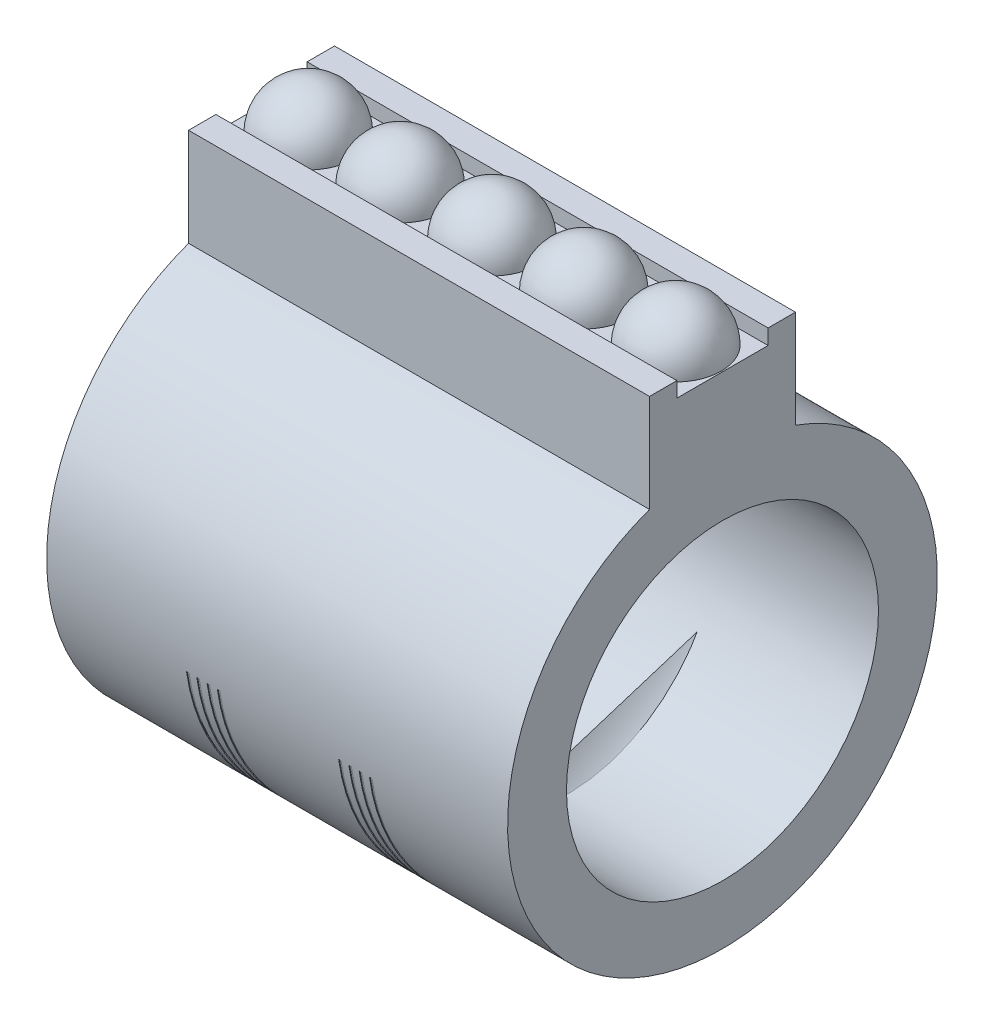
ISO-10303-21;
HEADER;
FILE_DESCRIPTION(('STEP AP214'),'2;1');
FILE_NAME('part.step','',(''),(''),'','','');
FILE_SCHEMA(('AUTOMOTIVE_DESIGN { 1 0 10303 214 1 1 1 1 }'));
ENDSEC;
DATA;
#1=APPLICATION_CONTEXT('core data for automotive mechanical design processes');
#2=APPLICATION_PROTOCOL_DEFINITION('international standard','automotive_design',2000,#1);
#3=PRODUCT_CONTEXT('',#1,'mechanical');
#4=PRODUCT('Part','Part','',(#3));
#5=PRODUCT_RELATED_PRODUCT_CATEGORY('part','',(#4));
#6=PRODUCT_DEFINITION_FORMATION('','',#4);
#7=PRODUCT_DEFINITION_CONTEXT('part definition',#1,'design');
#8=PRODUCT_DEFINITION('design','',#6,#7);
#9=PRODUCT_DEFINITION_SHAPE('','',#8);
#10=(LENGTH_UNIT() NAMED_UNIT(*) SI_UNIT(.MILLI.,.METRE.));
#11=(NAMED_UNIT(*) PLANE_ANGLE_UNIT() SI_UNIT($,.RADIAN.));
#12=(NAMED_UNIT(*) SI_UNIT($,.STERADIAN.) SOLID_ANGLE_UNIT());
#13=UNCERTAINTY_MEASURE_WITH_UNIT(LENGTH_MEASURE(1.E-05),#10,'distance_accuracy_value','');
#14=(GEOMETRIC_REPRESENTATION_CONTEXT(3) GLOBAL_UNCERTAINTY_ASSIGNED_CONTEXT((#13)) GLOBAL_UNIT_ASSIGNED_CONTEXT((#10,
#11,#12)) REPRESENTATION_CONTEXT('',''));
#15=CARTESIAN_POINT('',(0.,0.,0.));
#16=DIRECTION('',(0.,0.,1.));
#17=DIRECTION('',(1.,0.,0.));
#18=AXIS2_PLACEMENT_3D('',#15,#16,#17);
#19=CARTESIAN_POINT('',(128.778,45.71498772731,-25.62336));
#20=DIRECTION('',(-1.,0.,0.));
#21=DIRECTION('',(0.,0.,1.));
#22=AXIS2_PLACEMENT_3D('',#19,#20,#21);
#23=PLANE('',#22);
#24=CARTESIAN_POINT('',(128.778,0.,0.));
#25=DIRECTION('',(-1.,0.,0.));
#26=DIRECTION('',(0.,0.,1.));
#27=AXIS2_PLACEMENT_3D('',#24,#25,#26);
#28=CIRCLE('',#27,16.2900606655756);
#29=CARTESIAN_POINT('',(128.778,0.,16.2900606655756));
#30=VERTEX_POINT('',#29);
#31=EDGE_CURVE('E359',#30,#30,#28,.F.);
#32=ORIENTED_EDGE('',*,*,#31,.F.);
#33=EDGE_LOOP('',(#32));
#34=FACE_BOUND('',#33,.T.);
#35=DIRECTION('',(0.,1.,0.));
#36=VECTOR('',#35,1.);
#37=CARTESIAN_POINT('',(128.778,0.,-4.7625));
#38=LINE('',#37,#36);
#39=CARTESIAN_POINT('',(128.778,29.74086,-4.7625));
#40=VERTEX_POINT('',#39);
#41=CARTESIAN_POINT('',(128.778,31.32836,-4.7625));
#42=VERTEX_POINT('',#41);
#43=EDGE_CURVE('E439',#40,#42,#38,.T.);
#44=ORIENTED_EDGE('',*,*,#43,.F.);
#45=DIRECTION('',(0.,0.,-1.));
#46=VECTOR('',#45,1.);
#47=CARTESIAN_POINT('',(128.778,29.74086,0.));
#48=LINE('',#47,#46);
#49=CARTESIAN_POINT('',(128.778,29.74086,4.7625));
#50=VERTEX_POINT('',#49);
#51=EDGE_CURVE('E433',#50,#40,#48,.T.);
#52=ORIENTED_EDGE('',*,*,#51,.F.);
#53=DIRECTION('',(0.,-1.,0.));
#54=VECTOR('',#53,1.);
#55=CARTESIAN_POINT('',(128.778,0.,4.7625));
#56=LINE('',#55,#54);
#57=CARTESIAN_POINT('',(128.778,31.32836,4.7625));
#58=VERTEX_POINT('',#57);
#59=EDGE_CURVE('E436',#58,#50,#56,.T.);
#60=ORIENTED_EDGE('',*,*,#59,.F.);
#61=DIRECTION('',(0.,0.,-1.));
#62=VECTOR('',#61,1.);
#63=CARTESIAN_POINT('',(128.778,31.32836,-7.62000000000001));
#64=LINE('',#63,#62);
#65=CARTESIAN_POINT('',(128.778,31.32836,7.61999999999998));
#66=VERTEX_POINT('',#65);
#67=EDGE_CURVE('E403',#66,#58,#64,.T.);
#68=ORIENTED_EDGE('',*,*,#67,.F.);
#69=DIRECTION('',(0.,1.,0.));
#70=VECTOR('',#69,1.);
#71=CARTESIAN_POINT('',(128.778,-25.48736,7.61999999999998));
#72=LINE('',#71,#70);
#73=CARTESIAN_POINT('',(128.778,21.1048714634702,7.61999999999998));
#74=VERTEX_POINT('',#73);
#75=EDGE_CURVE('E383',#74,#66,#72,.T.);
#76=ORIENTED_EDGE('',*,*,#75,.F.);
#77=CARTESIAN_POINT('',(128.778,0.,0.));
#78=DIRECTION('',(-1.,0.,0.));
#79=DIRECTION('',(0.,0.,1.));
#80=AXIS2_PLACEMENT_3D('',#77,#78,#79);
#81=CIRCLE('',#80,22.43836);
#82=CARTESIAN_POINT('',(128.778,21.1048714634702,-7.62000000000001));
#83=VERTEX_POINT('',#82);
#84=EDGE_CURVE('E365',#83,#74,#81,.T.);
#85=ORIENTED_EDGE('',*,*,#84,.F.);
#86=DIRECTION('',(0.,1.,0.));
#87=VECTOR('',#86,1.);
#88=CARTESIAN_POINT('',(128.778,-25.48736,-7.62000000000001));
#89=LINE('',#88,#87);
#90=CARTESIAN_POINT('',(128.778,31.32836,-7.62000000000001));
#91=VERTEX_POINT('',#90);
#92=EDGE_CURVE('E384',#83,#91,#89,.T.);
#93=ORIENTED_EDGE('',*,*,#92,.T.);
#94=EDGE_CURVE('E402',#42,#91,#64,.T.);
#95=ORIENTED_EDGE('',*,*,#94,.F.);
#96=EDGE_LOOP('',(#44,#52,#60,#68,#76,#85,#93,#95));
#97=FACE_BOUND('',#96,.T.);
#98=ADVANCED_FACE('F37',(#34,#97),#23,.F.);
#99=CARTESIAN_POINT('',(80.645,45.71498772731,-25.62336));
#100=DIRECTION('',(-1.,0.,0.));
#101=DIRECTION('',(0.,-1.,0.));
#102=AXIS2_PLACEMENT_3D('',#99,#100,#101);
#103=PLANE('',#102);
#104=DIRECTION('',(0.,1.,0.));
#105=VECTOR('',#104,1.);
#106=CARTESIAN_POINT('',(80.645,-25.48736,-7.61999999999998));
#107=LINE('',#106,#105);
#108=CARTESIAN_POINT('',(80.645,21.1048714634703,-7.61999999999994));
#109=VERTEX_POINT('',#108);
#110=CARTESIAN_POINT('',(80.645,31.32836,-7.61999999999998));
#111=VERTEX_POINT('',#110);
#112=EDGE_CURVE('E385',#109,#111,#107,.T.);
#113=ORIENTED_EDGE('',*,*,#112,.F.);
#114=CARTESIAN_POINT('',(80.645,0.,0.));
#115=DIRECTION('',(-1.,0.,0.));
#116=DIRECTION('',(0.,0.,1.));
#117=AXIS2_PLACEMENT_3D('',#114,#115,#116);
#118=CIRCLE('',#117,22.43836);
#119=CARTESIAN_POINT('',(80.645,21.1048714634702,7.61999999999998));
#120=VERTEX_POINT('',#119);
#121=EDGE_CURVE('E362',#109,#120,#118,.T.);
#122=ORIENTED_EDGE('',*,*,#121,.T.);
#123=DIRECTION('',(0.,1.,0.));
#124=VECTOR('',#123,1.);
#125=CARTESIAN_POINT('',(80.645,-25.48736,7.61999999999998));
#126=LINE('',#125,#124);
#127=CARTESIAN_POINT('',(80.645,31.32836,7.61999999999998));
#128=VERTEX_POINT('',#127);
#129=EDGE_CURVE('E389',#120,#128,#126,.T.);
#130=ORIENTED_EDGE('',*,*,#129,.T.);
#131=DIRECTION('',(0.,0.,1.));
#132=VECTOR('',#131,1.);
#133=CARTESIAN_POINT('',(80.645,31.32836,-7.61999999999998));
#134=LINE('',#133,#132);
#135=CARTESIAN_POINT('',(80.645,31.32836,4.7625));
#136=VERTEX_POINT('',#135);
#137=EDGE_CURVE('E391',#136,#128,#134,.T.);
#138=ORIENTED_EDGE('',*,*,#137,.F.);
#139=DIRECTION('',(0.,-1.,0.));
#140=VECTOR('',#139,1.);
#141=CARTESIAN_POINT('',(80.645,0.,4.7625));
#142=LINE('',#141,#140);
#143=CARTESIAN_POINT('',(80.645,29.74086,4.7625));
#144=VERTEX_POINT('',#143);
#145=EDGE_CURVE('E427',#136,#144,#142,.T.);
#146=ORIENTED_EDGE('',*,*,#145,.T.);
#147=DIRECTION('',(0.,0.,-1.));
#148=VECTOR('',#147,1.);
#149=CARTESIAN_POINT('',(80.645,29.74086,0.));
#150=LINE('',#149,#148);
#151=CARTESIAN_POINT('',(80.645,29.74086,-4.7625));
#152=VERTEX_POINT('',#151);
#153=EDGE_CURVE('E411',#144,#152,#150,.T.);
#154=ORIENTED_EDGE('',*,*,#153,.T.);
#155=DIRECTION('',(0.,1.,0.));
#156=VECTOR('',#155,1.);
#157=CARTESIAN_POINT('',(80.645,0.,-4.7625));
#158=LINE('',#157,#156);
#159=CARTESIAN_POINT('',(80.645,31.32836,-4.7625));
#160=VERTEX_POINT('',#159);
#161=EDGE_CURVE('E430',#152,#160,#158,.T.);
#162=ORIENTED_EDGE('',*,*,#161,.T.);
#163=EDGE_CURVE('E396',#111,#160,#134,.T.);
#164=ORIENTED_EDGE('',*,*,#163,.F.);
#165=EDGE_LOOP('',(#113,#122,#130,#138,#146,#154,#162,#164));
#166=FACE_BOUND('',#165,.T.);
#167=CARTESIAN_POINT('',(80.645,0.,0.));
#168=DIRECTION('',(-1.,0.,0.));
#169=DIRECTION('',(0.,-1.,0.));
#170=AXIS2_PLACEMENT_3D('',#167,#168,#169);
#171=CIRCLE('',#170,16.4020996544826);
#172=CARTESIAN_POINT('',(80.645,-16.4020996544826,0.));
#173=VERTEX_POINT('',#172);
#174=EDGE_CURVE('E41',#173,#173,#171,.F.);
#175=ORIENTED_EDGE('',*,*,#174,.T.);
#176=EDGE_LOOP('',(#175));
#177=FACE_BOUND('',#176,.T.);
#178=ADVANCED_FACE('F700',(#166,#177),#103,.T.);
#179=CARTESIAN_POINT('',(96.769555,0.,-25.61336));
#180=DIRECTION('',(0.,0.,1.));
#181=DIRECTION('',(1.,0.,0.));
#182=AXIS2_PLACEMENT_3D('',#179,#180,#181);
#183=PLANE('',#182);
#184=CARTESIAN_POINT('',(96.769555,0.,-25.61336));
#185=DIRECTION('',(0.,0.,1.));
#186=DIRECTION('',(1.,0.,0.));
#187=AXIS2_PLACEMENT_3D('',#184,#185,#186);
#188=CIRCLE('',#187,1.80974999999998);
#189=CARTESIAN_POINT('',(98.579305,0.,-25.61336));
#190=VERTEX_POINT('',#189);
#191=EDGE_CURVE('E801',#190,#190,#188,.F.);
#192=ORIENTED_EDGE('',*,*,#191,.T.);
#193=EDGE_LOOP('',(#192));
#194=FACE_BOUND('',#193,.T.);
#195=ADVANCED_FACE('F706',(#194),#183,.F.);
#196=CARTESIAN_POINT('',(112.653445,0.,-25.61336));
#197=DIRECTION('',(0.,0.,1.));
#198=DIRECTION('',(1.,0.,0.));
#199=AXIS2_PLACEMENT_3D('',#196,#197,#198);
#200=PLANE('',#199);
#201=CARTESIAN_POINT('',(112.653445,0.,-25.61336));
#202=DIRECTION('',(0.,0.,1.));
#203=DIRECTION('',(1.,0.,0.));
#204=AXIS2_PLACEMENT_3D('',#201,#202,#203);
#205=CIRCLE('',#204,1.80974999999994);
#206=CARTESIAN_POINT('',(114.463195,0.,-25.61336));
#207=VERTEX_POINT('',#206);
#208=EDGE_CURVE('E361',#207,#207,#205,.F.);
#209=ORIENTED_EDGE('',*,*,#208,.T.);
#210=EDGE_LOOP('',(#209));
#211=FACE_BOUND('',#210,.T.);
#212=ADVANCED_FACE('F727',(#211),#200,.F.);
#213=CARTESIAN_POINT('',(96.769555,0.,-25.35936));
#214=DIRECTION('',(0.,0.,1.));
#215=DIRECTION('',(1.,0.,0.));
#216=AXIS2_PLACEMENT_3D('',#213,#214,#215);
#217=TOROIDAL_SURFACE('',#216,1.80974999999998,0.254);
#218=ORIENTED_EDGE('',*,*,#191,.F.);
#219=EDGE_LOOP('',(#218));
#220=FACE_BOUND('',#219,.T.);
#221=CARTESIAN_POINT('',(96.769555,0.,-25.35936));
#222=DIRECTION('',(0.,0.,1.));
#223=DIRECTION('',(1.,0.,0.));
#224=AXIS2_PLACEMENT_3D('',#221,#222,#223);
#225=CIRCLE('',#224,2.06374999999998);
#226=CARTESIAN_POINT('',(98.833305,0.,-25.35936));
#227=VERTEX_POINT('',#226);
#228=EDGE_CURVE('E800',#227,#227,#225,.T.);
#229=ORIENTED_EDGE('',*,*,#228,.F.);
#230=EDGE_LOOP('',(#229));
#231=FACE_BOUND('',#230,.T.);
#232=ADVANCED_FACE('F721',(#220,#231),#217,.T.);
#233=CARTESIAN_POINT('',(112.653445,0.,-25.35936));
#234=DIRECTION('',(0.,0.,1.));
#235=DIRECTION('',(1.,0.,0.));
#236=AXIS2_PLACEMENT_3D('',#233,#234,#235);
#237=TOROIDAL_SURFACE('',#236,1.80974999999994,0.254);
#238=ORIENTED_EDGE('',*,*,#208,.F.);
#239=EDGE_LOOP('',(#238));
#240=FACE_BOUND('',#239,.T.);
#241=CARTESIAN_POINT('',(112.653445,0.,-25.35936));
#242=DIRECTION('',(0.,0.,1.));
#243=DIRECTION('',(1.,0.,0.));
#244=AXIS2_PLACEMENT_3D('',#241,#242,#243);
#245=CIRCLE('',#244,2.06374999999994);
#246=CARTESIAN_POINT('',(114.717195,0.,-25.35936));
#247=VERTEX_POINT('',#246);
#248=EDGE_CURVE('E373',#247,#247,#245,.T.);
#249=ORIENTED_EDGE('',*,*,#248,.F.);
#250=EDGE_LOOP('',(#249));
#251=FACE_BOUND('',#250,.T.);
#252=ADVANCED_FACE('F713',(#240,#251),#237,.T.);
#253=CARTESIAN_POINT('',(0.,0.,0.));
#254=DIRECTION('',(1.,0.,0.));
#255=DIRECTION('',(0.,0.,-1.));
#256=AXIS2_PLACEMENT_3D('',#253,#254,#255);
#257=CYLINDRICAL_SURFACE('',#256,22.36216);
#258=CARTESIAN_POINT('',(112.24400193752,0.,0.));
#259=DIRECTION('',(1.,0.,0.));
#260=DIRECTION('',(0.,0.,-1.));
#261=AXIS2_PLACEMENT_3D('',#258,#259,#260);
#262=CIRCLE('',#261,22.36216);
#263=CARTESIAN_POINT('',(112.24400193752,-3.11221115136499,22.14453299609));
#264=VERTEX_POINT('',#263);
#265=CARTESIAN_POINT('',(112.24400193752,-3.11221115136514,-22.14453299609));
#266=VERTEX_POINT('',#265);
#267=EDGE_CURVE('E46',#264,#266,#262,.T.);
#268=ORIENTED_EDGE('',*,*,#267,.F.);
#269=DIRECTION('',(1.,0.,0.));
#270=VECTOR('',#269,1.);
#271=CARTESIAN_POINT('',(111.99000193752,-3.11221115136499,22.14453299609));
#272=LINE('',#271,#270);
#273=CARTESIAN_POINT('',(111.99000193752,-3.11221115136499,22.14453299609));
#274=VERTEX_POINT('',#273);
#275=EDGE_CURVE('E347',#274,#264,#272,.T.);
#276=ORIENTED_EDGE('',*,*,#275,.F.);
#277=CARTESIAN_POINT('',(111.99000193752,0.,0.));
#278=DIRECTION('',(1.,0.,0.));
#279=DIRECTION('',(0.,0.,-1.));
#280=AXIS2_PLACEMENT_3D('',#277,#278,#279);
#281=CIRCLE('',#280,22.36216);
#282=CARTESIAN_POINT('',(111.99000193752,-3.11221115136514,-22.14453299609));
#283=VERTEX_POINT('',#282);
#284=EDGE_CURVE('E11',#274,#283,#281,.T.);
#285=ORIENTED_EDGE('',*,*,#284,.T.);
#286=DIRECTION('',(1.,0.,0.));
#287=VECTOR('',#286,1.);
#288=CARTESIAN_POINT('',(111.99000193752,-3.11221115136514,-22.14453299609));
#289=LINE('',#288,#287);
#290=EDGE_CURVE('E334',#283,#266,#289,.T.);
#291=ORIENTED_EDGE('',*,*,#290,.T.);
#292=EDGE_LOOP('',(#268,#276,#285,#291));
#293=FACE_BOUND('',#292,.T.);
#294=ADVANCED_FACE('F684',(#293),#257,.T.);
#295=CARTESIAN_POINT('',(0.,0.,0.));
#296=DIRECTION('',(1.,0.,0.));
#297=DIRECTION('',(0.,0.,-1.));
#298=AXIS2_PLACEMENT_3D('',#295,#296,#297);
#299=CYLINDRICAL_SURFACE('',#298,22.36216);
#300=CARTESIAN_POINT('',(98.5058841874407,0.,0.));
#301=DIRECTION('',(1.,0.,0.));
#302=DIRECTION('',(0.,0.,-1.));
#303=AXIS2_PLACEMENT_3D('',#300,#301,#302);
#304=CIRCLE('',#303,22.36216);
#305=CARTESIAN_POINT('',(98.5058841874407,-3.11221115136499,22.14453299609));
#306=VERTEX_POINT('',#305);
#307=CARTESIAN_POINT('',(98.5058841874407,-3.11221115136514,-22.14453299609));
#308=VERTEX_POINT('',#307);
#309=EDGE_CURVE('E681',#306,#308,#304,.T.);
#310=ORIENTED_EDGE('',*,*,#309,.F.);
#311=DIRECTION('',(-1.,0.,0.));
#312=VECTOR('',#311,1.);
#313=CARTESIAN_POINT('',(0.,-3.11221115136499,22.14453299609));
#314=LINE('',#313,#312);
#315=CARTESIAN_POINT('',(98.2518841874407,-3.11221115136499,22.14453299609));
#316=VERTEX_POINT('',#315);
#317=EDGE_CURVE('E666',#306,#316,#314,.T.);
#318=ORIENTED_EDGE('',*,*,#317,.T.);
#319=CARTESIAN_POINT('',(98.2518841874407,0.,0.));
#320=DIRECTION('',(1.,0.,0.));
#321=DIRECTION('',(0.,0.,-1.));
#322=AXIS2_PLACEMENT_3D('',#319,#320,#321);
#323=CIRCLE('',#322,22.36216);
#324=CARTESIAN_POINT('',(98.2518841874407,-3.11221115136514,-22.14453299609));
#325=VERTEX_POINT('',#324);
#326=EDGE_CURVE('E335',#316,#325,#323,.T.);
#327=ORIENTED_EDGE('',*,*,#326,.T.);
#328=DIRECTION('',(-1.,0.,0.));
#329=VECTOR('',#328,1.);
#330=CARTESIAN_POINT('',(0.,-3.11221115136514,-22.14453299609));
#331=LINE('',#330,#329);
#332=EDGE_CURVE('E655',#308,#325,#331,.T.);
#333=ORIENTED_EDGE('',*,*,#332,.F.);
#334=EDGE_LOOP('',(#310,#318,#327,#333));
#335=FACE_BOUND('',#334,.T.);
#336=ADVANCED_FACE('F712',(#335),#299,.T.);
#337=CARTESIAN_POINT('',(0.,0.,0.));
#338=DIRECTION('',(1.,0.,0.));
#339=DIRECTION('',(0.,0.,-1.));
#340=AXIS2_PLACEMENT_3D('',#337,#338,#339);
#341=CYLINDRICAL_SURFACE('',#340,22.36216);
#342=CARTESIAN_POINT('',(95.2872258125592,0.,0.));
#343=DIRECTION('',(1.,0.,0.));
#344=DIRECTION('',(0.,0.,-1.));
#345=AXIS2_PLACEMENT_3D('',#342,#343,#344);
#346=CIRCLE('',#345,22.36216);
#347=CARTESIAN_POINT('',(95.2872258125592,-3.11221115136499,22.14453299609));
#348=VERTEX_POINT('',#347);
#349=CARTESIAN_POINT('',(95.2872258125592,-3.11221115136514,-22.14453299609));
#350=VERTEX_POINT('',#349);
#351=EDGE_CURVE('E646',#348,#350,#346,.T.);
#352=ORIENTED_EDGE('',*,*,#351,.F.);
#353=DIRECTION('',(1.,0.,0.));
#354=VECTOR('',#353,1.);
#355=CARTESIAN_POINT('',(0.,-3.11221115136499,22.14453299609));
#356=LINE('',#355,#354);
#357=CARTESIAN_POINT('',(95.0332258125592,-3.11221115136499,22.14453299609));
#358=VERTEX_POINT('',#357);
#359=EDGE_CURVE('E637',#358,#348,#356,.T.);
#360=ORIENTED_EDGE('',*,*,#359,.F.);
#361=CARTESIAN_POINT('',(95.0332258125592,0.,0.));
#362=DIRECTION('',(1.,0.,0.));
#363=DIRECTION('',(0.,0.,-1.));
#364=AXIS2_PLACEMENT_3D('',#361,#362,#363);
#365=CIRCLE('',#364,22.36216);
#366=CARTESIAN_POINT('',(95.0332258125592,-3.11221115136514,-22.14453299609));
#367=VERTEX_POINT('',#366);
#368=EDGE_CURVE('E648',#358,#367,#365,.T.);
#369=ORIENTED_EDGE('',*,*,#368,.T.);
#370=DIRECTION('',(1.,0.,0.));
#371=VECTOR('',#370,1.);
#372=CARTESIAN_POINT('',(0.,-3.11221115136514,-22.14453299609));
#373=LINE('',#372,#371);
#374=EDGE_CURVE('E625',#367,#350,#373,.T.);
#375=ORIENTED_EDGE('',*,*,#374,.T.);
#376=EDGE_LOOP('',(#352,#360,#369,#375));
#377=FACE_BOUND('',#376,.T.);
#378=ADVANCED_FACE('F718',(#377),#341,.T.);
#379=CARTESIAN_POINT('',(0.,0.,0.));
#380=DIRECTION('',(1.,0.,0.));
#381=DIRECTION('',(0.,0.,-1.));
#382=AXIS2_PLACEMENT_3D('',#379,#380,#381);
#383=CYLINDRICAL_SURFACE('',#382,22.36216);
#384=CARTESIAN_POINT('',(96.3601119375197,0.,0.));
#385=DIRECTION('',(1.,0.,0.));
#386=DIRECTION('',(0.,0.,-1.));
#387=AXIS2_PLACEMENT_3D('',#384,#385,#386);
#388=CIRCLE('',#387,22.36216);
#389=CARTESIAN_POINT('',(96.3601119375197,-3.11221115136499,22.14453299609));
#390=VERTEX_POINT('',#389);
#391=CARTESIAN_POINT('',(96.3601119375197,-3.11221115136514,-22.14453299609));
#392=VERTEX_POINT('',#391);
#393=EDGE_CURVE('E613',#390,#392,#388,.T.);
#394=ORIENTED_EDGE('',*,*,#393,.F.);
#395=DIRECTION('',(1.,0.,0.));
#396=VECTOR('',#395,1.);
#397=CARTESIAN_POINT('',(0.,-3.11221115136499,22.14453299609));
#398=LINE('',#397,#396);
#399=CARTESIAN_POINT('',(96.1061119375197,-3.11221115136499,22.14453299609));
#400=VERTEX_POINT('',#399);
#401=EDGE_CURVE('E604',#400,#390,#398,.T.);
#402=ORIENTED_EDGE('',*,*,#401,.F.);
#403=CARTESIAN_POINT('',(96.1061119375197,0.,0.));
#404=DIRECTION('',(1.,0.,0.));
#405=DIRECTION('',(0.,0.,-1.));
#406=AXIS2_PLACEMENT_3D('',#403,#404,#405);
#407=CIRCLE('',#406,22.36216);
#408=CARTESIAN_POINT('',(96.1061119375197,-3.11221115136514,-22.14453299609));
#409=VERTEX_POINT('',#408);
#410=EDGE_CURVE('E615',#400,#409,#407,.T.);
#411=ORIENTED_EDGE('',*,*,#410,.T.);
#412=DIRECTION('',(1.,0.,0.));
#413=VECTOR('',#412,1.);
#414=CARTESIAN_POINT('',(0.,-3.11221115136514,-22.14453299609));
#415=LINE('',#414,#413);
#416=EDGE_CURVE('E592',#409,#392,#415,.T.);
#417=ORIENTED_EDGE('',*,*,#416,.T.);
#418=EDGE_LOOP('',(#394,#402,#411,#417));
#419=FACE_BOUND('',#418,.T.);
#420=ADVANCED_FACE('F907',(#419),#383,.T.);
#421=CARTESIAN_POINT('',(0.,0.,0.));
#422=DIRECTION('',(1.,0.,0.));
#423=DIRECTION('',(0.,0.,-1.));
#424=AXIS2_PLACEMENT_3D('',#421,#422,#423);
#425=CYLINDRICAL_SURFACE('',#424,22.36216);
#426=CARTESIAN_POINT('',(97.4329980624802,0.,0.));
#427=DIRECTION('',(1.,0.,0.));
#428=DIRECTION('',(0.,0.,-1.));
#429=AXIS2_PLACEMENT_3D('',#426,#427,#428);
#430=CIRCLE('',#429,22.36216);
#431=CARTESIAN_POINT('',(97.4329980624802,-3.11221115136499,22.14453299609));
#432=VERTEX_POINT('',#431);
#433=CARTESIAN_POINT('',(97.4329980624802,-3.11221115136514,-22.14453299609));
#434=VERTEX_POINT('',#433);
#435=EDGE_CURVE('E585',#432,#434,#430,.T.);
#436=ORIENTED_EDGE('',*,*,#435,.F.);
#437=DIRECTION('',(-1.,0.,0.));
#438=VECTOR('',#437,1.);
#439=CARTESIAN_POINT('',(0.,-3.11221115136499,22.14453299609));
#440=LINE('',#439,#438);
#441=CARTESIAN_POINT('',(97.1789980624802,-3.11221115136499,22.14453299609));
#442=VERTEX_POINT('',#441);
#443=EDGE_CURVE('E566',#432,#442,#440,.T.);
#444=ORIENTED_EDGE('',*,*,#443,.T.);
#445=CARTESIAN_POINT('',(97.1789980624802,0.,0.));
#446=DIRECTION('',(1.,0.,0.));
#447=DIRECTION('',(0.,0.,-1.));
#448=AXIS2_PLACEMENT_3D('',#445,#446,#447);
#449=CIRCLE('',#448,22.36216);
#450=CARTESIAN_POINT('',(97.1789980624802,-3.11221115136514,-22.14453299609));
#451=VERTEX_POINT('',#450);
#452=EDGE_CURVE('E577',#442,#451,#449,.T.);
#453=ORIENTED_EDGE('',*,*,#452,.T.);
#454=DIRECTION('',(-1.,0.,0.));
#455=VECTOR('',#454,1.);
#456=CARTESIAN_POINT('',(0.,-3.11221115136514,-22.14453299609));
#457=LINE('',#456,#455);
#458=EDGE_CURVE('E555',#434,#451,#457,.T.);
#459=ORIENTED_EDGE('',*,*,#458,.F.);
#460=EDGE_LOOP('',(#436,#444,#453,#459));
#461=FACE_BOUND('',#460,.T.);
#462=ADVANCED_FACE('F890',(#461),#425,.T.);
#463=CARTESIAN_POINT('',(0.,0.,0.));
#464=DIRECTION('',(1.,0.,0.));
#465=DIRECTION('',(0.,0.,-1.));
#466=AXIS2_PLACEMENT_3D('',#463,#464,#465);
#467=CYLINDRICAL_SURFACE('',#466,22.36216);
#468=CARTESIAN_POINT('',(111.171115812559,0.,0.));
#469=DIRECTION('',(1.,0.,0.));
#470=DIRECTION('',(0.,0.,-1.));
#471=AXIS2_PLACEMENT_3D('',#468,#469,#470);
#472=CIRCLE('',#471,22.36216);
#473=CARTESIAN_POINT('',(111.171115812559,-3.11221115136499,22.14453299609));
#474=VERTEX_POINT('',#473);
#475=CARTESIAN_POINT('',(111.171115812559,-3.11221115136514,-22.14453299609));
#476=VERTEX_POINT('',#475);
#477=EDGE_CURVE('E548',#474,#476,#472,.T.);
#478=ORIENTED_EDGE('',*,*,#477,.F.);
#479=DIRECTION('',(1.,0.,0.));
#480=VECTOR('',#479,1.);
#481=CARTESIAN_POINT('',(0.,-3.11221115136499,22.14453299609));
#482=LINE('',#481,#480);
#483=CARTESIAN_POINT('',(110.917115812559,-3.11221115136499,22.14453299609));
#484=VERTEX_POINT('',#483);
#485=EDGE_CURVE('E539',#484,#474,#482,.T.);
#486=ORIENTED_EDGE('',*,*,#485,.F.);
#487=CARTESIAN_POINT('',(110.917115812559,0.,0.));
#488=DIRECTION('',(1.,0.,0.));
#489=DIRECTION('',(0.,0.,-1.));
#490=AXIS2_PLACEMENT_3D('',#487,#488,#489);
#491=CIRCLE('',#490,22.36216);
#492=CARTESIAN_POINT('',(110.917115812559,-3.11221115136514,-22.14453299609));
#493=VERTEX_POINT('',#492);
#494=EDGE_CURVE('E550',#484,#493,#491,.T.);
#495=ORIENTED_EDGE('',*,*,#494,.T.);
#496=DIRECTION('',(1.,0.,0.));
#497=VECTOR('',#496,1.);
#498=CARTESIAN_POINT('',(0.,-3.11221115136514,-22.14453299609));
#499=LINE('',#498,#497);
#500=EDGE_CURVE('E527',#493,#476,#499,.T.);
#501=ORIENTED_EDGE('',*,*,#500,.T.);
#502=EDGE_LOOP('',(#478,#486,#495,#501));
#503=FACE_BOUND('',#502,.T.);
#504=ADVANCED_FACE('F873',(#503),#467,.T.);
#505=CARTESIAN_POINT('',(0.,0.,0.));
#506=DIRECTION('',(1.,0.,0.));
#507=DIRECTION('',(0.,0.,-1.));
#508=AXIS2_PLACEMENT_3D('',#505,#506,#507);
#509=CYLINDRICAL_SURFACE('',#508,22.36216);
#510=CARTESIAN_POINT('',(113.31688806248,0.,0.));
#511=DIRECTION('',(1.,0.,0.));
#512=DIRECTION('',(0.,0.,-1.));
#513=AXIS2_PLACEMENT_3D('',#510,#511,#512);
#514=CIRCLE('',#513,22.36216);
#515=CARTESIAN_POINT('',(113.31688806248,-3.11221115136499,22.14453299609));
#516=VERTEX_POINT('',#515);
#517=CARTESIAN_POINT('',(113.31688806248,-3.11221115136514,-22.14453299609));
#518=VERTEX_POINT('',#517);
#519=EDGE_CURVE('E518',#516,#518,#514,.T.);
#520=ORIENTED_EDGE('',*,*,#519,.F.);
#521=DIRECTION('',(-1.,0.,0.));
#522=VECTOR('',#521,1.);
#523=CARTESIAN_POINT('',(0.,-3.11221115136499,22.14453299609));
#524=LINE('',#523,#522);
#525=CARTESIAN_POINT('',(113.06288806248,-3.11221115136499,22.14453299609));
#526=VERTEX_POINT('',#525);
#527=EDGE_CURVE('E503',#516,#526,#524,.T.);
#528=ORIENTED_EDGE('',*,*,#527,.T.);
#529=CARTESIAN_POINT('',(113.06288806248,0.,0.));
#530=DIRECTION('',(1.,0.,0.));
#531=DIRECTION('',(0.,0.,-1.));
#532=AXIS2_PLACEMENT_3D('',#529,#530,#531);
#533=CIRCLE('',#532,22.36216);
#534=CARTESIAN_POINT('',(113.06288806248,-3.11221115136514,-22.14453299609));
#535=VERTEX_POINT('',#534);
#536=EDGE_CURVE('E520',#526,#535,#533,.T.);
#537=ORIENTED_EDGE('',*,*,#536,.T.);
#538=DIRECTION('',(-1.,0.,0.));
#539=VECTOR('',#538,1.);
#540=CARTESIAN_POINT('',(0.,-3.11221115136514,-22.14453299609));
#541=LINE('',#540,#539);
#542=EDGE_CURVE('E492',#518,#535,#541,.T.);
#543=ORIENTED_EDGE('',*,*,#542,.F.);
#544=EDGE_LOOP('',(#520,#528,#537,#543));
#545=FACE_BOUND('',#544,.T.);
#546=ADVANCED_FACE('F837',(#545),#509,.T.);
#547=CARTESIAN_POINT('',(0.,0.,0.));
#548=DIRECTION('',(1.,0.,0.));
#549=DIRECTION('',(0.,0.,-1.));
#550=AXIS2_PLACEMENT_3D('',#547,#548,#549);
#551=CYLINDRICAL_SURFACE('',#550,22.36216);
#552=CARTESIAN_POINT('',(114.389774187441,0.,0.));
#553=DIRECTION('',(1.,0.,0.));
#554=DIRECTION('',(0.,0.,-1.));
#555=AXIS2_PLACEMENT_3D('',#552,#553,#554);
#556=CIRCLE('',#555,22.36216);
#557=CARTESIAN_POINT('',(114.389774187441,-3.11221115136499,22.14453299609));
#558=VERTEX_POINT('',#557);
#559=CARTESIAN_POINT('',(114.389774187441,-3.11221115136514,-22.14453299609));
#560=VERTEX_POINT('',#559);
#561=EDGE_CURVE('E460',#558,#560,#556,.T.);
#562=ORIENTED_EDGE('',*,*,#561,.F.);
#563=DIRECTION('',(-1.,0.,0.));
#564=VECTOR('',#563,1.);
#565=CARTESIAN_POINT('',(0.,-3.11221115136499,22.14453299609));
#566=LINE('',#565,#564);
#567=CARTESIAN_POINT('',(114.135774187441,-3.11221115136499,22.14453299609));
#568=VERTEX_POINT('',#567);
#569=EDGE_CURVE('E474',#558,#568,#566,.T.);
#570=ORIENTED_EDGE('',*,*,#569,.T.);
#571=CARTESIAN_POINT('',(114.135774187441,0.,0.));
#572=DIRECTION('',(1.,0.,0.));
#573=DIRECTION('',(0.,0.,-1.));
#574=AXIS2_PLACEMENT_3D('',#571,#572,#573);
#575=CIRCLE('',#574,22.36216);
#576=CARTESIAN_POINT('',(114.135774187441,-3.11221115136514,-22.14453299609));
#577=VERTEX_POINT('',#576);
#578=EDGE_CURVE('E458',#568,#577,#575,.T.);
#579=ORIENTED_EDGE('',*,*,#578,.T.);
#580=DIRECTION('',(-1.,0.,0.));
#581=VECTOR('',#580,1.);
#582=CARTESIAN_POINT('',(0.,-3.11221115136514,-22.14453299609));
#583=LINE('',#582,#581);
#584=EDGE_CURVE('E485',#560,#577,#583,.T.);
#585=ORIENTED_EDGE('',*,*,#584,.F.);
#586=EDGE_LOOP('',(#562,#570,#579,#585));
#587=FACE_BOUND('',#586,.T.);
#588=ADVANCED_FACE('F827',(#587),#551,.T.);
#589=CARTESIAN_POINT('',(96.769555,0.,28.78936));
#590=DIRECTION('',(0.,0.,-1.));
#591=DIRECTION('',(-1.,0.,0.));
#592=AXIS2_PLACEMENT_3D('',#589,#590,#591);
#593=CYLINDRICAL_SURFACE('',#592,2.06374999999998);
#594=CARTESIAN_POINT('',(94.7564373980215,-0.454336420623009,-22.6866225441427));
#595=CARTESIAN_POINT('',(94.7552169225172,-0.448928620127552,-22.4339376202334));
#596=CARTESIAN_POINT('',(94.508669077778,-0.504543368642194,-22.4326867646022));
#597=CARTESIAN_POINT('',(94.7309257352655,-0.341296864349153,-22.6894777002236));
#598=CARTESIAN_POINT('',(94.7302623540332,-0.336945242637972,-22.4361445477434));
#599=CARTESIAN_POINT('',(94.4800175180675,-0.379012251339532,-22.4355099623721));
#600=CARTESIAN_POINT('',(94.7149539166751,-0.226083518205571,-22.6913118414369));
#601=CARTESIAN_POINT('',(94.714723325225,-0.22322679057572,-22.437553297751));
#602=CARTESIAN_POINT('',(94.4620799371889,-0.251067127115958,-22.4373235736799));
#603=CARTESIAN_POINT('',(94.7025599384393,0.00539942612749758,-22.6927314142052));
#604=CARTESIAN_POINT('',(94.7026387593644,0.00537812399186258,-22.4386461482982));
#605=CARTESIAN_POINT('',(94.4481605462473,0.00599609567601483,-22.4387272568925));
#606=CARTESIAN_POINT('',(94.7061372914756,0.121668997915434,-22.6923169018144));
#607=CARTESIAN_POINT('',(94.7061161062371,0.120043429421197,-22.4383281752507));
#608=CARTESIAN_POINT('',(94.452178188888,0.13511416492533,-22.438317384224));
#609=CARTESIAN_POINT('',(94.7326850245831,0.351508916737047,-22.6892917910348));
#610=CARTESIAN_POINT('',(94.7320128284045,0.347124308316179,-22.4359978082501));
#611=CARTESIAN_POINT('',(94.4819933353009,0.390352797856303,-22.4353261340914));
#612=CARTESIAN_POINT('',(94.7555833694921,0.46508768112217,-22.6866893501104));
#613=CARTESIAN_POINT('',(94.7543129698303,0.459335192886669,-22.4339960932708));
#614=CARTESIAN_POINT('',(94.5077099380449,0.516482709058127,-22.4327528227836));
#615=CARTESIAN_POINT('',(94.8200113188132,0.686781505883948,-22.6795900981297));
#616=CARTESIAN_POINT('',(94.8173362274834,0.678953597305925,-22.4285055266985));
#617=CARTESIAN_POINT('',(94.5800674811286,0.762675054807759,-22.4257330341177));
#618=CARTESIAN_POINT('',(94.8615411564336,0.79489649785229,-22.6750932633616));
#619=CARTESIAN_POINT('',(94.8579533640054,0.786199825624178,-22.4250255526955));
#620=CARTESIAN_POINT('',(94.6267086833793,0.882737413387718,-22.4212865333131));
#621=CARTESIAN_POINT('',(94.9621340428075,1.00282443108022,-22.6646964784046));
#622=CARTESIAN_POINT('',(94.9568127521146,0.993102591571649,-22.4169311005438));
#623=CARTESIAN_POINT('',(94.7396822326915,1.113642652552,-22.4110061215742));
#624=CARTESIAN_POINT('',(95.021229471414,1.10262160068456,-22.6587939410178));
#625=CARTESIAN_POINT('',(95.0149543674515,1.09266128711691,-22.4123240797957));
#626=CARTESIAN_POINT('',(94.8060509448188,1.2244680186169,-22.405169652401));
#627=CARTESIAN_POINT('',(95.1552523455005,1.2909088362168,-22.6462480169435));
#628=CARTESIAN_POINT('',(95.1474384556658,1.28106980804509,-22.4024747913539));
#629=CARTESIAN_POINT('',(94.9565689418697,1.43356214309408,-22.3927641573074));
#630=CARTESIAN_POINT('',(95.2301802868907,1.37939854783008,-22.6396046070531));
#631=CARTESIAN_POINT('',(95.2216597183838,1.3699215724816,-22.3972385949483));
#632=CARTESIAN_POINT('',(95.0407187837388,1.53183050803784,-22.386195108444));
#633=CARTESIAN_POINT('',(95.3941483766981,1.54298169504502,-22.626286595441));
#634=CARTESIAN_POINT('',(95.3847507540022,1.53458162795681,-22.3866903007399));
#635=CARTESIAN_POINT('',(95.2248675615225,1.71349059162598,-22.3730261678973));
#636=CARTESIAN_POINT('',(95.4832513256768,1.61801219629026,-22.61961198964));
#637=CARTESIAN_POINT('',(95.4736138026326,1.61040820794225,-22.3813778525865));
#638=CARTESIAN_POINT('',(95.3249370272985,1.79681242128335,-22.3664262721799));
#639=CARTESIAN_POINT('',(95.6728213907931,1.75206043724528,-22.6070141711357));
#640=CARTESIAN_POINT('',(95.6632802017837,1.74609883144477,-22.371315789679));
#641=CARTESIAN_POINT('',(95.5378387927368,1.94567381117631,-22.3539694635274));
#642=CARTESIAN_POINT('',(95.7732885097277,1.81107817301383,-22.6010909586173));
#643=CARTESIAN_POINT('',(95.7640845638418,1.80608725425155,-22.3665600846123));
#644=CARTESIAN_POINT('',(95.6506710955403,2.01121336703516,-22.3481125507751));
#645=CARTESIAN_POINT('',(95.9827809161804,1.91142401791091,-22.5906662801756));
#646=CARTESIAN_POINT('',(95.97471637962,1.9081411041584,-22.3581747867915));
#647=CARTESIAN_POINT('',(95.8859471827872,2.12264804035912,-22.3378045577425));
#648=CARTESIAN_POINT('',(96.0918078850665,1.95274864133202,-22.5861650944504));
#649=CARTESIAN_POINT('',(96.0846301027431,1.95033581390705,-22.3545359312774));
#650=CARTESIAN_POINT('',(96.0083928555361,2.16853928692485,-22.3333537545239));
#651=CARTESIAN_POINT('',(96.3153032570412,2.01648741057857,-22.579100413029));
#652=CARTESIAN_POINT('',(96.3101444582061,2.01538091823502,-22.3488240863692));
#653=CARTESIAN_POINT('',(96.2593953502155,2.23932157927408,-22.3263681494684));
#654=CARTESIAN_POINT('',(96.4297714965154,2.03890212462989,-22.5765368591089));
#655=CARTESIAN_POINT('',(96.4259015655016,2.03833509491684,-22.3467423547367));
#656=CARTESIAN_POINT('',(96.3879519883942,2.26421325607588,-22.3238332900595));
#657=CARTESIAN_POINT('',(96.6603461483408,2.06410438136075,-22.5736482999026));
#658=CARTESIAN_POINT('',(96.6590187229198,2.06410252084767,-22.344400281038));
#659=CARTESIAN_POINT('',(96.6469050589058,2.29220051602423,-22.3209770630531));
#660=CARTESIAN_POINT('',(96.7764428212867,2.06698015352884,-22.573313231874));
#661=CARTESIAN_POINT('',(96.7765671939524,2.06705089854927,-22.3441277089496));
#662=CARTESIAN_POINT('',(96.7772905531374,2.29539407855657,-22.3206457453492));
#663=CARTESIAN_POINT('',(97.0074653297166,2.05325407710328,-22.5748930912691));
#664=CARTESIAN_POINT('',(97.0101960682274,2.05301365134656,-22.3454091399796));
#665=CARTESIAN_POINT('',(97.0367466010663,2.28015118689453,-22.3222079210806));
#666=CARTESIAN_POINT('',(97.1223911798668,2.03665247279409,-22.5768079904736));
#667=CARTESIAN_POINT('',(97.1264805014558,2.0360036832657,-22.3469653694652));
#668=CARTESIAN_POINT('',(97.165817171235,2.26171500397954,-22.3241013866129));
#669=CARTESIAN_POINT('',(97.3475573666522,1.98451600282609,-22.5826629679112));
#670=CARTESIAN_POINT('',(97.3538533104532,1.98276006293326,-22.3517043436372));
#671=CARTESIAN_POINT('',(97.4186961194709,2.20381713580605,-22.3298908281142));
#672=CARTESIAN_POINT('',(97.4578072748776,1.94902205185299,-22.5865986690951));
#673=CARTESIAN_POINT('',(97.4651229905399,1.94648124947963,-22.3548910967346));
#674=CARTESIAN_POINT('',(97.5425152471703,2.16440088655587,-22.333782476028));
#675=CARTESIAN_POINT('',(97.6707849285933,1.86015142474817,-22.5960481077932));
#676=CARTESIAN_POINT('',(97.6795255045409,1.85599038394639,-22.3625055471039));
#677=CARTESIAN_POINT('',(97.7817055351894,2.06570951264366,-22.3431261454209));
#678=CARTESIAN_POINT('',(97.7735127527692,1.80677493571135,-22.6015618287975));
#679=CARTESIAN_POINT('',(97.7827646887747,1.80165355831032,-22.3669427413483));
#680=CARTESIAN_POINT('',(97.8970767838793,2.00643459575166,-22.3485781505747));
#681=CARTESIAN_POINT('',(97.9689398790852,1.68343102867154,-22.6135707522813));
#682=CARTESIAN_POINT('',(97.9786160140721,1.67659985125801,-22.3765572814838));
#683=CARTESIAN_POINT('',(98.116556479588,1.8694604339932,-22.3604526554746));
#684=CARTESIAN_POINT('',(98.061601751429,1.61340458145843,-22.6200694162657));
#685=CARTESIAN_POINT('',(98.071213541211,1.60569593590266,-22.3817446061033));
#686=CARTESIAN_POINT('',(98.2206228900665,1.79169563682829,-22.3668785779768));
#687=CARTESIAN_POINT('',(98.2338855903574,1.45883242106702,-22.6333043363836));
#688=CARTESIAN_POINT('',(98.2429054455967,1.44982001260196,-22.3922558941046));
#689=CARTESIAN_POINT('',(98.414110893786,1.6200423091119,-22.3799653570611));
#690=CARTESIAN_POINT('',(98.3135075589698,1.37428671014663,-22.6400405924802));
#691=CARTESIAN_POINT('',(98.3219476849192,1.3647526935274,-22.3975818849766));
#692=CARTESIAN_POINT('',(98.5035324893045,1.52615378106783,-22.3866262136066));
#693=CARTESIAN_POINT('',(98.4577942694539,1.19265554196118,-22.6530256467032));
#694=CARTESIAN_POINT('',(98.4648564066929,1.18266396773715,-22.4078043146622));
#695=CARTESIAN_POINT('',(98.6655775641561,1.32445126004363,-22.3994659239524));
#696=CARTESIAN_POINT('',(98.5223930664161,1.09551760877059,-22.6592722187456));
#697=CARTESIAN_POINT('',(98.5285425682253,1.08556652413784,-22.4126942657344));
#698=CARTESIAN_POINT('',(98.7381269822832,1.21657899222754,-22.4056425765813));
#699=CARTESIAN_POINT('',(98.634295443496,0.891787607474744,-22.6705352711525));
#700=CARTESIAN_POINT('',(98.638705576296,0.882510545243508,-22.4214846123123));
#701=CARTESIAN_POINT('',(98.8638019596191,0.990335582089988,-22.4167795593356));
#702=CARTESIAN_POINT('',(98.6816181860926,0.785206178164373,-22.6755531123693));
#703=CARTESIAN_POINT('',(98.6850655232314,0.776619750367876,-22.4253770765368));
#704=CARTESIAN_POINT('',(98.9169490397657,0.871976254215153,-22.4217412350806));
#705=CARTESIAN_POINT('',(98.7447382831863,0.602999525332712,-22.6823994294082));
#706=CARTESIAN_POINT('',(98.7468466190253,0.596008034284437,-22.4306780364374));
#707=CARTESIAN_POINT('',(98.9878377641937,0.669634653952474,-22.4285109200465));
#708=CARTESIAN_POINT('',(98.765783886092,0.529161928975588,-22.6847322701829));
#709=CARTESIAN_POINT('',(98.7674078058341,0.522902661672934,-22.432479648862));
#710=CARTESIAN_POINT('',(99.0114735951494,0.587637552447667,-22.4308176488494));
#711=CARTESIAN_POINT('',(98.7995438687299,0.379588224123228,-22.6885108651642));
#712=CARTESIAN_POINT('',(98.8003880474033,0.374911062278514,-22.4353964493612));
#713=CARTESIAN_POINT('',(99.0493886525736,0.421535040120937,-22.434553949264));
#714=CARTESIAN_POINT('',(98.8122582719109,0.303852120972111,-22.6899566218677));
#715=CARTESIAN_POINT('',(98.8127813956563,0.300078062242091,-22.4365094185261));
#716=CARTESIAN_POINT('',(99.0636679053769,0.337429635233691,-22.4359835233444));
#717=CARTESIAN_POINT('',(98.8334456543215,0.112838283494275,-22.6923707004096));
#718=CARTESIAN_POINT('',(98.833455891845,0.111329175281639,-22.4383696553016));
#719=CARTESIAN_POINT('',(99.0874629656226,0.125307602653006,-22.4383705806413));
#720=CARTESIAN_POINT('',(98.8365307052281,-0.00308576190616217,-22.692728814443));
#721=CARTESIAN_POINT('',(98.8364532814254,-0.00299654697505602,-22.4386442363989));
#722=CARTESIAN_POINT('',(99.0909277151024,-0.00342675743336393,-22.4387246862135));
#723=CARTESIAN_POINT('',(98.8232708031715,-0.233890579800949,-22.6912108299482));
#724=CARTESIAN_POINT('',(98.8235231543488,-0.230937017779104,-22.437475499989));
#725=CARTESIAN_POINT('',(99.0760358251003,-0.259736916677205,-22.4372236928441));
#726=CARTESIAN_POINT('',(98.8069050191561,-0.348770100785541,-22.6893323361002));
#727=CARTESIAN_POINT('',(98.8076002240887,-0.344331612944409,-22.4360325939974));
#728=CARTESIAN_POINT('',(99.0576557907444,-0.387311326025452,-22.4353662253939));
#729=CARTESIAN_POINT('',(98.7552174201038,-0.574066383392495,-22.6835521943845));
#730=CARTESIAN_POINT('',(98.757100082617,-0.56726347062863,-22.4315698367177));
#731=CARTESIAN_POINT('',(98.9996066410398,-0.637504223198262,-22.4296507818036));
#732=CARTESIAN_POINT('',(98.7199084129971,-0.684486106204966,-22.6796519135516));
#733=CARTESIAN_POINT('',(98.7226250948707,-0.676620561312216,-22.4285587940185));
#734=CARTESIAN_POINT('',(98.959951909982,-0.760125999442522,-22.425794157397));
#735=CARTESIAN_POINT('',(98.6313583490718,-0.897827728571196,-22.6702639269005));
#736=CARTESIAN_POINT('',(98.6357535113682,-0.888553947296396,-22.4212680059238));
#737=CARTESIAN_POINT('',(98.8605033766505,-0.997043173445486,-22.4165112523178));
#738=CARTESIAN_POINT('',(98.5781163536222,-1.0007492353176,-22.6647761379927));
#739=CARTESIAN_POINT('',(98.5834842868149,-0.991017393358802,-22.416998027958));
#740=CARTESIAN_POINT('',(98.8007085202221,-1.11133813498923,-22.4110848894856));
#741=CARTESIAN_POINT('',(98.455054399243,-1.1964753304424,-22.6528087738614));
#742=CARTESIAN_POINT('',(98.4620875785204,-1.18648066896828,-22.4076307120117));
#743=CARTESIAN_POINT('',(98.6625004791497,-1.32869315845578,-22.3992514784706));
#744=CARTESIAN_POINT('',(98.3851917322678,-1.2892529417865,-22.646326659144));
#745=CARTESIAN_POINT('',(98.3930465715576,-1.27942947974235,-22.4025389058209));
#746=CARTESIAN_POINT('',(98.5840393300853,-1.43172326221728,-22.3928419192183));
#747=CARTESIAN_POINT('',(98.2309252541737,-1.46179854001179,-22.6331048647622));
#748=CARTESIAN_POINT('',(98.2399250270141,-1.452764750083,-22.392098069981));
#749=CARTESIAN_POINT('',(98.4107862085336,-1.62333620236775,-22.3797681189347));
#750=CARTESIAN_POINT('',(98.1465206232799,-1.54156579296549,-22.6263651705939));
#751=CARTESIAN_POINT('',(98.155937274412,-1.53320472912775,-22.3867512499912));
#752=CARTESIAN_POINT('',(98.3159933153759,-1.71191822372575,-22.3731038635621));
#753=CARTESIAN_POINT('',(97.9651869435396,-1.68612660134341,-22.6133581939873));
#754=CARTESIAN_POINT('',(97.9748607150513,-1.6792672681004,-22.3763909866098));
#755=CARTESIAN_POINT('',(98.112341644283,-1.87245388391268,-22.3602424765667));
#756=CARTESIAN_POINT('',(97.8682121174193,-1.75086288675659,-22.6070927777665));
#757=CARTESIAN_POINT('',(97.8777487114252,-1.74494713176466,-22.3713745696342));
#758=CARTESIAN_POINT('',(98.0034314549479,-1.94434392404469,-22.3540471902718));
#759=CARTESIAN_POINT('',(97.6647159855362,-1.86313014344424,-22.5957723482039));
#760=CARTESIAN_POINT('',(97.6734602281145,-1.85895752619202,-22.3622888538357));
#761=CARTESIAN_POINT('',(97.7748896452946,-2.06901739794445,-22.3428534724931));
#762=CARTESIAN_POINT('',(97.5581948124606,-1.91066135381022,-22.5907173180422));
#763=CARTESIAN_POINT('',(97.5662274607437,-1.90742295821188,-22.358210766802));
#764=CARTESIAN_POINT('',(97.6552581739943,-2.12180109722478,-22.3378550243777));
#765=CARTESIAN_POINT('',(97.3388250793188,-1.98707350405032,-22.582401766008));
#766=CARTESIAN_POINT('',(97.3451059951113,-1.98532386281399,-22.3514976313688));
#767=CARTESIAN_POINT('',(97.4088890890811,-2.20665725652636,-22.3296325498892));
#768=CARTESIAN_POINT('',(97.2259884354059,-2.01598836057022,-22.5791379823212));
#769=CARTESIAN_POINT('',(97.2310963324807,-2.01491048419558,-22.3488505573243));
#770=CARTESIAN_POINT('',(97.282164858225,-2.23876738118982,-22.3264052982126));
#771=CARTESIAN_POINT('',(96.9970307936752,-2.05445687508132,-22.5747643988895));
#772=CARTESIAN_POINT('',(96.9997262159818,-2.05422327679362,-22.3453068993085));
#773=CARTESIAN_POINT('',(97.0250278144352,-2.28148690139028,-22.3220806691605));
#774=CARTESIAN_POINT('',(96.8809099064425,-2.06401118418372,-22.5736545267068));
#775=CARTESIAN_POINT('',(96.8821768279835,-2.06401708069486,-22.3444042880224));
#776=CARTESIAN_POINT('',(96.894615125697,-2.29209701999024,-22.3209832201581));
#777=CARTESIAN_POINT('',(96.6492504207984,-2.06347914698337,-22.573715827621));
#778=CARTESIAN_POINT('',(96.6478786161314,-2.06347302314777,-22.3444540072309));
#779=CARTESIAN_POINT('',(96.6344437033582,-2.29150618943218,-22.3210438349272));
#780=CARTESIAN_POINT('',(96.533711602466,-2.0534830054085,-22.5748765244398));
#781=CARTESIAN_POINT('',(96.5309224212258,-2.05322670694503,-22.3453979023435));
#782=CARTESIAN_POINT('',(96.5046847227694,-2.2804054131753,-22.3221915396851));
#783=CARTESIAN_POINT('',(96.3059639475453,-2.0143232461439,-22.5793258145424));
#784=CARTESIAN_POINT('',(96.3007839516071,-2.01320890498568,-22.3490027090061));
#785=CARTESIAN_POINT('',(96.2489065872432,-2.23691826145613,-22.3265910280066));
#786=CARTESIAN_POINT('',(96.1937551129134,-1.98515961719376,-22.5826144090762));
#787=CARTESIAN_POINT('',(96.1874161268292,-1.98337000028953,-22.3516696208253));
#788=CARTESIAN_POINT('',(96.1228874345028,-2.20453187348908,-22.3298428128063));
#789=CARTESIAN_POINT('',(95.9758565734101,-1.90851867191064,-22.5909459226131));
#790=CARTESIAN_POINT('',(95.9677914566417,-1.90524057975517,-22.3583950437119));
#791=CARTESIAN_POINT('',(95.8781706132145,-2.11942163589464,-22.338081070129));
#792=CARTESIAN_POINT('',(95.8701657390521,-1.86104453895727,-22.5959885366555));
#793=CARTESIAN_POINT('',(95.8614024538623,-1.85683765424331,-22.362462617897));
#794=CARTESIAN_POINT('',(95.7594716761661,-2.06670132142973,-22.3430672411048));
#795=CARTESIAN_POINT('',(95.66823437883,-1.74913775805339,-22.6072606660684));
#796=CARTESIAN_POINT('',(95.6586956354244,-1.74319900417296,-22.3715088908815));
#797=CARTESIAN_POINT('',(95.5326872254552,-1.94242815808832,-22.3542131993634));
#798=CARTESIAN_POINT('',(95.5719941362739,-1.68470460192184,-22.6134902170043));
#799=CARTESIAN_POINT('',(95.5623237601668,-1.67783081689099,-22.3764961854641));
#800=CARTESIAN_POINT('',(95.4246020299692,-1.87087474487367,-22.3603730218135));
#801=CARTESIAN_POINT('',(95.3912289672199,-1.54036333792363,-22.62646922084));
#802=CARTESIAN_POINT('',(95.3818161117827,-1.53199082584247,-22.3868339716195));
#803=CARTESIAN_POINT('',(95.2215888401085,-1.7105828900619,-22.3732067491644));
#804=CARTESIAN_POINT('',(95.3067590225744,-1.46038652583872,-22.6332208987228));
#805=CARTESIAN_POINT('',(95.2977665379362,-1.45134210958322,-22.3921900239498));
#806=CARTESIAN_POINT('',(95.1267225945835,-1.62176815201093,-22.3798828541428));
#807=CARTESIAN_POINT('',(95.1524187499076,-1.28738961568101,-22.646461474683));
#808=CARTESIAN_POINT('',(95.1445776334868,-1.27755989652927,-22.4026451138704));
#809=CARTESIAN_POINT('',(94.9533865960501,-1.42965402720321,-22.3929752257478));
#810=CARTESIAN_POINT('',(95.0825486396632,-1.19436932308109,-22.6529503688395));
#811=CARTESIAN_POINT('',(95.0755330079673,-1.1843722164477,-22.4077418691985));
#812=CARTESIAN_POINT('',(94.8749170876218,-1.32635442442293,-22.3993914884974));
#813=CARTESIAN_POINT('',(94.9592475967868,-0.997673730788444,-22.6649510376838));
#814=CARTESIAN_POINT('',(94.9539048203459,-0.987947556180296,-22.4171347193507));
#815=CARTESIAN_POINT('',(94.7364405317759,-1.10792276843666,-22.4112578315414));
#816=CARTESIAN_POINT('',(94.9058527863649,-0.89397567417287,-22.6704606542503));
#817=CARTESIAN_POINT('',(94.9014904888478,-0.884718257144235,-22.4214211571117));
#818=CARTESIAN_POINT('',(94.6764740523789,-0.992765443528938,-22.4167057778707));
#819=CARTESIAN_POINT('',(94.8172489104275,-0.679026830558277,-22.6798637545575));
#820=CARTESIAN_POINT('',(94.8145722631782,-0.671202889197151,-22.4287229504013));
#821=CARTESIAN_POINT('',(94.5769650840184,-0.754063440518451,-22.4260036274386));
#822=CARTESIAN_POINT('',(94.7820393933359,-0.567776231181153,-22.6837572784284));
#823=CARTESIAN_POINT('',(94.7801984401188,-0.561032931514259,-22.4317283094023));
#824=CARTESIAN_POINT('',(94.5374220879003,-0.630518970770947,-22.4298535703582));
#825=CARTESIAN_POINT('',(94.7564373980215,-0.454336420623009,-22.6866225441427));
#826=CARTESIAN_POINT('',(94.7552169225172,-0.448928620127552,-22.4339376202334));
#827=CARTESIAN_POINT('',(94.508669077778,-0.504543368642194,-22.4326867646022));
#828=(BOUNDED_SURFACE() B_SPLINE_SURFACE(3,2,((#594,#595,#596),(#597,#598,#599),(#600,#601,
#602),(#603,#604,#605),(#606,#607,#608),(#609,#610,#611),(#612,#613,#614),(#615,#616,#617),
(#618,#619,#620),(#621,#622,#623),(#624,#625,#626),(#627,#628,#629),(#630,#631,#632),(#633,#634,
#635),(#636,#637,#638),(#639,#640,#641),(#642,#643,#644),(#645,#646,#647),(#648,#649,#650),
(#651,#652,#653),(#654,#655,#656),(#657,#658,#659),(#660,#661,#662),(#663,#664,#665),(#666,#667,
#668),(#669,#670,#671),(#672,#673,#674),(#675,#676,#677),(#678,#679,#680),(#681,#682,#683),
(#684,#685,#686),(#687,#688,#689),(#690,#691,#692),(#693,#694,#695),(#696,#697,#698),(#699,#700,
#701),(#702,#703,#704),(#705,#706,#707),(#708,#709,#710),(#711,#712,#713),(#714,#715,#716),
(#717,#718,#719),(#720,#721,#722),(#723,#724,#725),(#726,#727,#728),(#729,#730,#731),(#732,#733,
#734),(#735,#736,#737),(#738,#739,#740),(#741,#742,#743),(#744,#745,#746),(#747,#748,#749),
(#750,#751,#752),(#753,#754,#755),(#756,#757,#758),(#759,#760,#761),(#762,#763,#764),(#765,#766,
#767),(#768,#769,#770),(#771,#772,#773),(#774,#775,#776),(#777,#778,#779),(#780,#781,#782),
(#783,#784,#785),(#786,#787,#788),(#789,#790,#791),(#792,#793,#794),(#795,#796,#797),(#798,#799,
#800),(#801,#802,#803),(#804,#805,#806),(#807,#808,#809),(#810,#811,#812),(#813,#814,#815),
(#816,#817,#818),(#819,#820,#821),(#822,#823,#824),(#825,#826,#827)),.UNSPECIFIED.,.T.,.F.,
.F.) B_SPLINE_SURFACE_WITH_KNOTS((4,2,2,2,2,2,2,2,2,2,2,2,2,2,2,2,2,2,2,2,2,2,2,2,2,2,2,2,2,2,2,
2,2,2,2,2,2,2,4),(3,3),(0.,0.39006462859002,0.780119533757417,1.16872657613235,1.55733848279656,
1.94667123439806,2.33601618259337,2.72713674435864,3.1182574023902,3.50945507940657,
3.90064100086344,4.29005931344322,4.67947274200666,5.06804623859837,5.45661566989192,
5.84658379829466,6.23655186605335,6.62820070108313,7.01941379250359,7.27769056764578,
7.53596661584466,7.92472525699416,8.31390061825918,8.70281318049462,9.0917461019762,
9.48168942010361,9.87165472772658,10.2630823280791,10.6545044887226,11.0452114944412,
11.4359053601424,11.8248008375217,12.2136965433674,12.6025246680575,12.991364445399,
13.3819637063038,13.7725687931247,14.164024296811,14.5554700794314),(0.,1.),
.UNSPECIFIED.) GEOMETRIC_REPRESENTATION_ITEM() RATIONAL_B_SPLINE_SURFACE(((1.,0.708854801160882,
1.),(1.,0.707986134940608,1.),(1.,0.707426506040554,1.),(1.,0.706993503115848,1.),(1.,
0.707120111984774,1.),(1.,0.708042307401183,1.),(1.,0.708835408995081,1.),(1.,0.710991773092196,
1.),(1.,0.712355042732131,1.),(1.,0.715493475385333,1.),(1.,0.717269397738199,1.),(1.,
0.721026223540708,1.),(1.,0.723007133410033,1.),(1.,0.726959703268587,1.),(1.,0.72893127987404,
1.),(1.,0.732637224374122,1.),(1.,0.734371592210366,1.),(1.,0.737414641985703,1.),(1.,
0.738723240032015,1.),(1.,0.740773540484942,1.),(1.,0.74151525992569,1.),(1.,0.742350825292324,
1.),(1.,0.742447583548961,1.),(1.,0.74199077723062,1.),(1.,0.741437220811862,1.),(1.,
0.739740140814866,1.),(1.,0.738597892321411,1.),(1.,0.73584504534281,1.),(1.,0.734234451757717,
1.),(1.,0.730710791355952,1.),(1.,0.728796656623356,1.),(1.,0.724879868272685,1.),(1.,
0.722877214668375,1.),(1.,0.718999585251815,1.),(1.,0.717125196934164,1.),(1.,0.713733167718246,
1.),(1.,0.712215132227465,1.),(1.,0.710138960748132,1.),(1.,0.709429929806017,1.),(1.,
0.708280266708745,1.),(1.,0.70783963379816,1.),(1.,0.70710370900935,1.),(1.,0.706994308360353,
1.),(1.,0.707457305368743,1.),(1.,0.708030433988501,1.),(1.,0.709788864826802,1.),(1.,
0.71097375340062,1.),(1.,0.713814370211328,1.),(1.,0.715470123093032,1.),(1.,0.719064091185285,
1.),(1.,0.72100302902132,1.),(1.,0.724939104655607,1.),(1.,0.726936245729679,1.),(1.,
0.730773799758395,1.),(1.,0.732613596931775,1.),(1.,0.735926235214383,1.),(1.,0.737399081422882,
1.),(1.,0.739816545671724,1.),(1.,0.740762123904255,1.),(1.,0.742028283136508,1.),(1.,
0.742348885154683,1.),(1.,0.742331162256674,1.),(1.,0.741995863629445,1.),(1.,0.740707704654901,
1.),(1.,0.739754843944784,1.),(1.,0.737332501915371,1.),(1.,0.735863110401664,1.),(1.,
0.732564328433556,1.),(1.,0.730734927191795,1.),(1.,0.726905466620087,1.),(1.,0.724904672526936,
1.),(1.,0.720962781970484,1.),(1.,0.719021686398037,1.),(1.,0.715417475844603,1.),(1.,
0.713754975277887,1.),(1.,0.710909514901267,1.),(1.,0.70972654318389,1.),(1.,0.708854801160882,1.))) REPRESENTATION_ITEM('') SURFACE());
#829=CARTESIAN_POINT('',(94.7564373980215,-0.454336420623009,-22.6866225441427));
#830=CARTESIAN_POINT('',(94.7309257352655,-0.341296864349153,-22.6894777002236));
#831=CARTESIAN_POINT('',(94.7149539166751,-0.226083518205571,-22.6913118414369));
#832=CARTESIAN_POINT('',(94.7025599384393,0.00539942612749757,-22.6927314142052));
#833=CARTESIAN_POINT('',(94.7061372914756,0.121668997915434,-22.6923169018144));
#834=CARTESIAN_POINT('',(94.7326850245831,0.351508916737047,-22.6892917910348));
#835=CARTESIAN_POINT('',(94.7555833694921,0.46508768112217,-22.6866893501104));
#836=CARTESIAN_POINT('',(94.8200113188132,0.686781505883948,-22.6795900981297));
#837=CARTESIAN_POINT('',(94.8615411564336,0.79489649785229,-22.6750932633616));
#838=CARTESIAN_POINT('',(94.9621340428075,1.00282443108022,-22.6646964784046));
#839=CARTESIAN_POINT('',(95.021229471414,1.10262160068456,-22.6587939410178));
#840=CARTESIAN_POINT('',(95.1552523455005,1.2909088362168,-22.6462480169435));
#841=CARTESIAN_POINT('',(95.2301802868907,1.37939854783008,-22.6396046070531));
#842=CARTESIAN_POINT('',(95.3941483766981,1.54298169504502,-22.626286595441));
#843=CARTESIAN_POINT('',(95.4832513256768,1.61801219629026,-22.61961198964));
#844=CARTESIAN_POINT('',(95.6728213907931,1.75206043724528,-22.6070141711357));
#845=CARTESIAN_POINT('',(95.7732885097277,1.81107817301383,-22.6010909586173));
#846=CARTESIAN_POINT('',(95.9827809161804,1.91142401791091,-22.5906662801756));
#847=CARTESIAN_POINT('',(96.0918078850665,1.95274864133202,-22.5861650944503));
#848=CARTESIAN_POINT('',(96.3153032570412,2.01648741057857,-22.579100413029));
#849=CARTESIAN_POINT('',(96.4297714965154,2.03890212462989,-22.5765368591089));
#850=CARTESIAN_POINT('',(96.6603461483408,2.06410438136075,-22.5736482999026));
#851=CARTESIAN_POINT('',(96.7764428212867,2.06698015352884,-22.573313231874));
#852=CARTESIAN_POINT('',(97.0074653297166,2.05325407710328,-22.5748930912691));
#853=CARTESIAN_POINT('',(97.1223911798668,2.03665247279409,-22.5768079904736));
#854=CARTESIAN_POINT('',(97.3475573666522,1.98451600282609,-22.5826629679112));
#855=CARTESIAN_POINT('',(97.4578072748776,1.94902205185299,-22.5865986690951));
#856=CARTESIAN_POINT('',(97.6707849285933,1.86015142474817,-22.5960481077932));
#857=CARTESIAN_POINT('',(97.7735127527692,1.80677493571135,-22.6015618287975));
#858=CARTESIAN_POINT('',(97.9689398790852,1.68343102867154,-22.6135707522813));
#859=CARTESIAN_POINT('',(98.061601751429,1.61340458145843,-22.6200694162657));
#860=CARTESIAN_POINT('',(98.2338855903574,1.45883242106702,-22.6333043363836));
#861=CARTESIAN_POINT('',(98.3135075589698,1.37428671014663,-22.6400405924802));
#862=CARTESIAN_POINT('',(98.4577942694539,1.19265554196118,-22.6530256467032));
#863=CARTESIAN_POINT('',(98.5223930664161,1.09551760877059,-22.6592722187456));
#864=CARTESIAN_POINT('',(98.634295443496,0.891787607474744,-22.6705352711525));
#865=CARTESIAN_POINT('',(98.6816181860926,0.785206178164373,-22.6755531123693));
#866=CARTESIAN_POINT('',(98.7447382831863,0.602999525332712,-22.6823994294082));
#867=CARTESIAN_POINT('',(98.765783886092,0.529161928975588,-22.6847322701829));
#868=CARTESIAN_POINT('',(98.7995438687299,0.379588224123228,-22.6885108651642));
#869=CARTESIAN_POINT('',(98.8122582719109,0.303852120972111,-22.6899566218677));
#870=CARTESIAN_POINT('',(98.8334456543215,0.112838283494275,-22.6923707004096));
#871=CARTESIAN_POINT('',(98.8365307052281,-0.00308576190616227,-22.692728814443));
#872=CARTESIAN_POINT('',(98.8232708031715,-0.233890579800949,-22.6912108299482));
#873=CARTESIAN_POINT('',(98.8069050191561,-0.348770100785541,-22.6893323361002));
#874=CARTESIAN_POINT('',(98.7552174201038,-0.574066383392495,-22.6835521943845));
#875=CARTESIAN_POINT('',(98.7199084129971,-0.684486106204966,-22.6796519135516));
#876=CARTESIAN_POINT('',(98.6313583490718,-0.897827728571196,-22.6702639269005));
#877=CARTESIAN_POINT('',(98.5781163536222,-1.0007492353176,-22.6647761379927));
#878=CARTESIAN_POINT('',(98.455054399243,-1.1964753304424,-22.6528087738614));
#879=CARTESIAN_POINT('',(98.3851917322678,-1.2892529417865,-22.646326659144));
#880=CARTESIAN_POINT('',(98.2309252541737,-1.46179854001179,-22.6331048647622));
#881=CARTESIAN_POINT('',(98.1465206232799,-1.54156579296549,-22.6263651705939));
#882=CARTESIAN_POINT('',(97.9651869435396,-1.68612660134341,-22.6133581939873));
#883=CARTESIAN_POINT('',(97.8682121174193,-1.75086288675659,-22.6070927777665));
#884=CARTESIAN_POINT('',(97.6647159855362,-1.86313014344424,-22.5957723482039));
#885=CARTESIAN_POINT('',(97.5581948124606,-1.91066135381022,-22.5907173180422));
#886=CARTESIAN_POINT('',(97.3388250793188,-1.98707350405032,-22.582401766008));
#887=CARTESIAN_POINT('',(97.2259884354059,-2.01598836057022,-22.5791379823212));
#888=CARTESIAN_POINT('',(96.9970307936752,-2.05445687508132,-22.5747643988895));
#889=CARTESIAN_POINT('',(96.8809099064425,-2.06401118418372,-22.5736545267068));
#890=CARTESIAN_POINT('',(96.6492504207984,-2.06347914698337,-22.573715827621));
#891=CARTESIAN_POINT('',(96.5337116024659,-2.0534830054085,-22.5748765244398));
#892=CARTESIAN_POINT('',(96.3059639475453,-2.0143232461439,-22.5793258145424));
#893=CARTESIAN_POINT('',(96.1937551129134,-1.98515961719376,-22.5826144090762));
#894=CARTESIAN_POINT('',(95.9758565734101,-1.90851867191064,-22.5909459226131));
#895=CARTESIAN_POINT('',(95.8701657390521,-1.86104453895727,-22.5959885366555));
#896=CARTESIAN_POINT('',(95.66823437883,-1.74913775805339,-22.6072606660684));
#897=CARTESIAN_POINT('',(95.5719941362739,-1.68470460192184,-22.6134902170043));
#898=CARTESIAN_POINT('',(95.3912289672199,-1.54036333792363,-22.62646922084));
#899=CARTESIAN_POINT('',(95.3067590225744,-1.46038652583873,-22.6332208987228));
#900=CARTESIAN_POINT('',(95.1524187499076,-1.28738961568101,-22.646461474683));
#901=CARTESIAN_POINT('',(95.0825486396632,-1.19436932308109,-22.6529503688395));
#902=CARTESIAN_POINT('',(94.9592475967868,-0.997673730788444,-22.6649510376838));
#903=CARTESIAN_POINT('',(94.9058527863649,-0.89397567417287,-22.6704606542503));
#904=CARTESIAN_POINT('',(94.8172489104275,-0.679026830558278,-22.6798637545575));
#905=CARTESIAN_POINT('',(94.7820393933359,-0.567776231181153,-22.6837572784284));
#906=CARTESIAN_POINT('',(94.7564373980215,-0.454336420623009,-22.6866225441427));
#907=B_SPLINE_CURVE_WITH_KNOTS('',3,(#829,#830,#831,#832,#833,#834,#835,#836,#837,#838,#839,
#840,#841,#842,#843,#844,#845,#846,#847,#848,#849,#850,#851,#852,#853,#854,#855,#856,#857,#858,
#859,#860,#861,#862,#863,#864,#865,#866,#867,#868,#869,#870,#871,#872,#873,#874,#875,#876,#877,
#878,#879,#880,#881,#882,#883,#884,#885,#886,#887,#888,#889,#890,#891,#892,#893,#894,#895,#896,
#897,#898,#899,#900,#901,#902,#903,#904,#905,#906),.UNSPECIFIED.,.T.,.F.,(4,2,2,2,2,2,2,2,2,2,2,
2,2,2,2,2,2,2,2,2,2,2,2,2,2,2,2,2,2,2,2,2,2,2,2,2,2,2,4),(0.,0.39006462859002,0.780119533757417,
1.16872657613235,1.55733848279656,1.94667123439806,2.33601618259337,2.72713674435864,
3.1182574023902,3.50945507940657,3.90064100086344,4.29005931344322,4.67947274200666,
5.06804623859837,5.45661566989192,5.84658379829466,6.23655186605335,6.62820070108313,
7.01941379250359,7.27769056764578,7.53596661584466,7.92472525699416,8.31390061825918,
8.70281318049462,9.0917461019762,9.48168942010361,9.87165472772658,10.2630823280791,
10.6545044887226,11.0452114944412,11.4359053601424,11.8248008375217,12.2136965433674,
12.6025246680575,12.991364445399,13.3819637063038,13.7725687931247,14.164024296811,
14.5554700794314),.UNSPECIFIED.);
#908=CARTESIAN_POINT('',(94.7564373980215,-0.454336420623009,-22.6866225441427));
#909=VERTEX_POINT('',#908);
#910=EDGE_CURVE('E795',#909,#909,#907,.T.);
#911=ORIENTED_EDGE('',*,*,#910,.T.);
#912=EDGE_LOOP('',(#911));
#913=FACE_BOUND('',#912,.T.);
#914=ORIENTED_EDGE('',*,*,#228,.T.);
#915=EDGE_LOOP('',(#914));
#916=FACE_BOUND('',#915,.T.);
#917=ADVANCED_FACE('F759',(#913,#916),#593,.T.);
#918=CARTESIAN_POINT('',(112.653445,0.,28.78936));
#919=DIRECTION('',(0.,0.,-1.));
#920=DIRECTION('',(-1.,0.,0.));
#921=AXIS2_PLACEMENT_3D('',#918,#919,#920);
#922=CYLINDRICAL_SURFACE('',#921,2.06374999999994);
#923=CARTESIAN_POINT('',(110.640327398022,-0.454336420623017,-22.6866225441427));
#924=CARTESIAN_POINT('',(110.639106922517,-0.448928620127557,-22.4339376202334));
#925=CARTESIAN_POINT('',(110.392559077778,-0.504543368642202,-22.4326867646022));
#926=CARTESIAN_POINT('',(110.614815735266,-0.341296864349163,-22.6894777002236));
#927=CARTESIAN_POINT('',(110.614152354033,-0.336945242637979,-22.4361445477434));
#928=CARTESIAN_POINT('',(110.363907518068,-0.379012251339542,-22.4355099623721));
#929=CARTESIAN_POINT('',(110.598843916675,-0.226083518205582,-22.6913118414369));
#930=CARTESIAN_POINT('',(110.598613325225,-0.22322679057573,-22.437553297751));
#931=CARTESIAN_POINT('',(110.345969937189,-0.25106712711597,-22.4373235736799));
#932=CARTESIAN_POINT('',(110.586449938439,0.00539942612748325,-22.6927314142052));
#933=CARTESIAN_POINT('',(110.586528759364,0.00537812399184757,-22.4386461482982));
#934=CARTESIAN_POINT('',(110.332050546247,0.00599609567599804,-22.4387272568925));
#935=CARTESIAN_POINT('',(110.590027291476,0.121668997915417,-22.6923169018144));
#936=CARTESIAN_POINT('',(110.590006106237,0.12004342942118,-22.4383281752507));
#937=CARTESIAN_POINT('',(110.336068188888,0.135114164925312,-22.438317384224));
#938=CARTESIAN_POINT('',(110.616575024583,0.351508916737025,-22.6892917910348));
#939=CARTESIAN_POINT('',(110.615902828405,0.347124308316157,-22.4359978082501));
#940=CARTESIAN_POINT('',(110.365883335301,0.390352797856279,-22.4353261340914));
#941=CARTESIAN_POINT('',(110.639473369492,0.465087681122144,-22.6866893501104));
#942=CARTESIAN_POINT('',(110.63820296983,0.459335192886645,-22.4339960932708));
#943=CARTESIAN_POINT('',(110.391599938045,0.5164827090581,-22.4327528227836));
#944=CARTESIAN_POINT('',(110.703901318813,0.68678150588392,-22.6795900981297));
#945=CARTESIAN_POINT('',(110.701226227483,0.678953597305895,-22.4285055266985));
#946=CARTESIAN_POINT('',(110.463957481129,0.762675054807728,-22.4257330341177));
#947=CARTESIAN_POINT('',(110.745431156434,0.794896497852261,-22.6750932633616));
#948=CARTESIAN_POINT('',(110.741843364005,0.786199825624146,-22.4250255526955));
#949=CARTESIAN_POINT('',(110.510598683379,0.882737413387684,-22.4212865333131));
#950=CARTESIAN_POINT('',(110.846024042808,1.00282443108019,-22.6646964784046));
#951=CARTESIAN_POINT('',(110.840702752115,0.993102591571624,-22.4169311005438));
#952=CARTESIAN_POINT('',(110.623572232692,1.11364265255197,-22.4110061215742));
#953=CARTESIAN_POINT('',(110.905119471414,1.10262160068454,-22.6587939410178));
#954=CARTESIAN_POINT('',(110.898844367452,1.09266128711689,-22.4123240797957));
#955=CARTESIAN_POINT('',(110.689940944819,1.22446801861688,-22.405169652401));
#956=CARTESIAN_POINT('',(111.039142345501,1.29090883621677,-22.6462480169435));
#957=CARTESIAN_POINT('',(111.031328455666,1.28106980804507,-22.4024747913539));
#958=CARTESIAN_POINT('',(110.84045894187,1.43356214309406,-22.3927641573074));
#959=CARTESIAN_POINT('',(111.114070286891,1.37939854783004,-22.6396046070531));
#960=CARTESIAN_POINT('',(111.105549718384,1.36992157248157,-22.3972385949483));
#961=CARTESIAN_POINT('',(110.924608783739,1.5318305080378,-22.386195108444));
#962=CARTESIAN_POINT('',(111.278038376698,1.54298169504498,-22.626286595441));
#963=CARTESIAN_POINT('',(111.268640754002,1.53458162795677,-22.3866903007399));
#964=CARTESIAN_POINT('',(111.108757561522,1.71349059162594,-22.3730261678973));
#965=CARTESIAN_POINT('',(111.367141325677,1.61801219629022,-22.61961198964));
#966=CARTESIAN_POINT('',(111.357503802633,1.61040820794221,-22.3813778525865));
#967=CARTESIAN_POINT('',(111.208827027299,1.7968124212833,-22.3664262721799));
#968=CARTESIAN_POINT('',(111.556711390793,1.75206043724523,-22.6070141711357));
#969=CARTESIAN_POINT('',(111.547170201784,1.74609883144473,-22.371315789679));
#970=CARTESIAN_POINT('',(111.421728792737,1.94567381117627,-22.3539694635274));
#971=CARTESIAN_POINT('',(111.657178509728,1.81107817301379,-22.6010909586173));
#972=CARTESIAN_POINT('',(111.647974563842,1.80608725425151,-22.3665600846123));
#973=CARTESIAN_POINT('',(111.53456109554,2.01121336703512,-22.3481125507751));
#974=CARTESIAN_POINT('',(111.86667091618,1.91142401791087,-22.5906662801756));
#975=CARTESIAN_POINT('',(111.85860637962,1.90814110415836,-22.3581747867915));
#976=CARTESIAN_POINT('',(111.769837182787,2.12264804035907,-22.3378045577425));
#977=CARTESIAN_POINT('',(111.975697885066,1.95274864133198,-22.5861650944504));
#978=CARTESIAN_POINT('',(111.968520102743,1.950335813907,-22.3545359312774));
#979=CARTESIAN_POINT('',(111.892282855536,2.16853928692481,-22.3333537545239));
#980=CARTESIAN_POINT('',(112.199193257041,2.01648741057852,-22.579100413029));
#981=CARTESIAN_POINT('',(112.194034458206,2.01538091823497,-22.3488240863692));
#982=CARTESIAN_POINT('',(112.143285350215,2.23932157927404,-22.3263681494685));
#983=CARTESIAN_POINT('',(112.313661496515,2.03890212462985,-22.5765368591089));
#984=CARTESIAN_POINT('',(112.309791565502,2.03833509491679,-22.3467423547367));
#985=CARTESIAN_POINT('',(112.271841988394,2.26421325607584,-22.3238332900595));
#986=CARTESIAN_POINT('',(112.544236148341,2.0641043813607,-22.5736482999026));
#987=CARTESIAN_POINT('',(112.54290872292,2.06410252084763,-22.344400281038));
#988=CARTESIAN_POINT('',(112.530795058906,2.29220051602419,-22.3209770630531));
#989=CARTESIAN_POINT('',(112.660332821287,2.06698015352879,-22.573313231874));
#990=CARTESIAN_POINT('',(112.660457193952,2.06705089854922,-22.3441277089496));
#991=CARTESIAN_POINT('',(112.661180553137,2.29539407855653,-22.3206457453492));
#992=CARTESIAN_POINT('',(112.891355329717,2.05325407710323,-22.5748930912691));
#993=CARTESIAN_POINT('',(112.894086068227,2.05301365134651,-22.3454091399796));
#994=CARTESIAN_POINT('',(112.920636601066,2.28015118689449,-22.3222079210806));
#995=CARTESIAN_POINT('',(113.006281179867,2.03665247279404,-22.5768079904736));
#996=CARTESIAN_POINT('',(113.010370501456,2.03600368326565,-22.3469653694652));
#997=CARTESIAN_POINT('',(113.049707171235,2.26171500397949,-22.3241013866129));
#998=CARTESIAN_POINT('',(113.231447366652,1.98451600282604,-22.5826629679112));
#999=CARTESIAN_POINT('',(113.237743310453,1.98276006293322,-22.3517043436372));
#1000=CARTESIAN_POINT('',(113.302586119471,2.20381713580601,-22.3298908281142));
#1001=CARTESIAN_POINT('',(113.341697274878,1.94902205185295,-22.5865986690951));
#1002=CARTESIAN_POINT('',(113.34901299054,1.94648124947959,-22.3548910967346));
#1003=CARTESIAN_POINT('',(113.42640524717,2.16440088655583,-22.333782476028));
#1004=CARTESIAN_POINT('',(113.554674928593,1.86015142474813,-22.5960481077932));
#1005=CARTESIAN_POINT('',(113.563415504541,1.85599038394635,-22.3625055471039));
#1006=CARTESIAN_POINT('',(113.665595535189,2.06570951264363,-22.3431261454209));
#1007=CARTESIAN_POINT('',(113.657402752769,1.80677493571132,-22.6015618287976));
#1008=CARTESIAN_POINT('',(113.666654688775,1.80165355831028,-22.3669427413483));
#1009=CARTESIAN_POINT('',(113.780966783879,2.00643459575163,-22.3485781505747));
#1010=CARTESIAN_POINT('',(113.852829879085,1.68343102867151,-22.6135707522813));
#1011=CARTESIAN_POINT('',(113.862506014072,1.67659985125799,-22.3765572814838));
#1012=CARTESIAN_POINT('',(114.000446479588,1.86946043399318,-22.3604526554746));
#1013=CARTESIAN_POINT('',(113.945491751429,1.6134045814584,-22.6200694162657));
#1014=CARTESIAN_POINT('',(113.955103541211,1.60569593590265,-22.3817446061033));
#1015=CARTESIAN_POINT('',(114.104512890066,1.79169563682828,-22.3668785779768));
#1016=CARTESIAN_POINT('',(114.117775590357,1.458832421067,-22.6333043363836));
#1017=CARTESIAN_POINT('',(114.126795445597,1.44982001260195,-22.3922558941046));
#1018=CARTESIAN_POINT('',(114.298000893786,1.62004230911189,-22.3799653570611));
#1019=CARTESIAN_POINT('',(114.19739755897,1.37428671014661,-22.6400405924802));
#1020=CARTESIAN_POINT('',(114.205837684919,1.36475269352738,-22.3975818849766));
#1021=CARTESIAN_POINT('',(114.387422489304,1.52615378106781,-22.3866262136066));
#1022=CARTESIAN_POINT('',(114.341684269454,1.19265554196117,-22.6530256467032));
#1023=CARTESIAN_POINT('',(114.348746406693,1.18266396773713,-22.4078043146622));
#1024=CARTESIAN_POINT('',(114.549467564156,1.32445126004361,-22.3994659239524));
#1025=CARTESIAN_POINT('',(114.406283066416,1.09551760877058,-22.6592722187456));
#1026=CARTESIAN_POINT('',(114.412432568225,1.08556652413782,-22.4126942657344));
#1027=CARTESIAN_POINT('',(114.622016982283,1.21657899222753,-22.4056425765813));
#1028=CARTESIAN_POINT('',(114.518185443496,0.891787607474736,-22.6705352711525));
#1029=CARTESIAN_POINT('',(114.522595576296,0.882510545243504,-22.4214846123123));
#1030=CARTESIAN_POINT('',(114.747691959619,0.990335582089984,-22.4167795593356));
#1031=CARTESIAN_POINT('',(114.565508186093,0.785206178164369,-22.6755531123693));
#1032=CARTESIAN_POINT('',(114.568955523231,0.776619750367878,-22.4253770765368));
#1033=CARTESIAN_POINT('',(114.800839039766,0.871976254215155,-22.4217412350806));
#1034=CARTESIAN_POINT('',(114.628628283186,0.602999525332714,-22.6823994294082));
#1035=CARTESIAN_POINT('',(114.630736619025,0.596008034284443,-22.4306780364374));
#1036=CARTESIAN_POINT('',(114.871727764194,0.669634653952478,-22.4285109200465));
#1037=CARTESIAN_POINT('',(114.649673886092,0.529161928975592,-22.6847322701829));
#1038=CARTESIAN_POINT('',(114.651297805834,0.52290266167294,-22.432479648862));
#1039=CARTESIAN_POINT('',(114.895363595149,0.587637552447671,-22.4308176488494));
#1040=CARTESIAN_POINT('',(114.68343386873,0.379588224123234,-22.6885108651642));
#1041=CARTESIAN_POINT('',(114.684278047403,0.374911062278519,-22.4353964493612));
#1042=CARTESIAN_POINT('',(114.933278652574,0.421535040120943,-22.434553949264));
#1043=CARTESIAN_POINT('',(114.696148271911,0.303852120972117,-22.6899566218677));
#1044=CARTESIAN_POINT('',(114.696671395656,0.300078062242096,-22.4365094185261));
#1045=CARTESIAN_POINT('',(114.947557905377,0.337429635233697,-22.4359835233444));
#1046=CARTESIAN_POINT('',(114.717335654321,0.112838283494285,-22.6923707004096));
#1047=CARTESIAN_POINT('',(114.717345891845,0.111329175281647,-22.4383696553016));
#1048=CARTESIAN_POINT('',(114.971352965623,0.125307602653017,-22.4383705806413));
#1049=CARTESIAN_POINT('',(114.720420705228,-0.0030857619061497,-22.692728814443));
#1050=CARTESIAN_POINT('',(114.720343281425,-0.00299654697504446,-22.4386442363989));
#1051=CARTESIAN_POINT('',(114.974817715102,-0.00342675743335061,-22.4387246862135));
#1052=CARTESIAN_POINT('',(114.707160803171,-0.233890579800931,-22.6912108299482));
#1053=CARTESIAN_POINT('',(114.707413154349,-0.230937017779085,-22.437475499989));
#1054=CARTESIAN_POINT('',(114.9599258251,-0.259736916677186,-22.4372236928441));
#1055=CARTESIAN_POINT('',(114.690795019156,-0.348770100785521,-22.6893323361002));
#1056=CARTESIAN_POINT('',(114.691490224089,-0.344331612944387,-22.4360325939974));
#1057=CARTESIAN_POINT('',(114.941545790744,-0.387311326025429,-22.4353662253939));
#1058=CARTESIAN_POINT('',(114.639107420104,-0.574066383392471,-22.6835521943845));
#1059=CARTESIAN_POINT('',(114.640990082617,-0.567263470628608,-22.4315698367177));
#1060=CARTESIAN_POINT('',(114.88349664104,-0.637504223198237,-22.4296507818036));
#1061=CARTESIAN_POINT('',(114.603798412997,-0.684486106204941,-22.6796519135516));
#1062=CARTESIAN_POINT('',(114.606515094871,-0.676620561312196,-22.4285587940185));
#1063=CARTESIAN_POINT('',(114.843841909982,-0.760125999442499,-22.425794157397));
#1064=CARTESIAN_POINT('',(114.515248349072,-0.897827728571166,-22.6702639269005));
#1065=CARTESIAN_POINT('',(114.519643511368,-0.888553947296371,-22.4212680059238));
#1066=CARTESIAN_POINT('',(114.74439337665,-0.997043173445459,-22.4165112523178));
#1067=CARTESIAN_POINT('',(114.462006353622,-1.00074923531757,-22.6647761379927));
#1068=CARTESIAN_POINT('',(114.467374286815,-0.991017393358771,-22.416998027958));
#1069=CARTESIAN_POINT('',(114.684598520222,-1.1113381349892,-22.4110848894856));
#1070=CARTESIAN_POINT('',(114.338944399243,-1.19647533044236,-22.6528087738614));
#1071=CARTESIAN_POINT('',(114.34597757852,-1.18648066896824,-22.4076307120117));
#1072=CARTESIAN_POINT('',(114.54639047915,-1.32869315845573,-22.3992514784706));
#1073=CARTESIAN_POINT('',(114.269081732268,-1.28925294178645,-22.646326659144));
#1074=CARTESIAN_POINT('',(114.276936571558,-1.2794294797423,-22.4025389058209));
#1075=CARTESIAN_POINT('',(114.467929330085,-1.43172326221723,-22.3928419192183));
#1076=CARTESIAN_POINT('',(114.114815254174,-1.46179854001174,-22.6331048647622));
#1077=CARTESIAN_POINT('',(114.123815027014,-1.45276475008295,-22.392098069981));
#1078=CARTESIAN_POINT('',(114.294676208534,-1.6233362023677,-22.3797681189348));
#1079=CARTESIAN_POINT('',(114.03041062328,-1.54156579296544,-22.6263651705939));
#1080=CARTESIAN_POINT('',(114.039827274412,-1.53320472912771,-22.3867512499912));
#1081=CARTESIAN_POINT('',(114.199883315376,-1.7119182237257,-22.3731038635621));
#1082=CARTESIAN_POINT('',(113.84907694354,-1.68612660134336,-22.6133581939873));
#1083=CARTESIAN_POINT('',(113.858750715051,-1.67926726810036,-22.3763909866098));
#1084=CARTESIAN_POINT('',(113.996231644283,-1.87245388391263,-22.3602424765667));
#1085=CARTESIAN_POINT('',(113.752102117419,-1.75086288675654,-22.6070927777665));
#1086=CARTESIAN_POINT('',(113.761638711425,-1.74494713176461,-22.3713745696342));
#1087=CARTESIAN_POINT('',(113.887321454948,-1.94434392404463,-22.3540471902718));
#1088=CARTESIAN_POINT('',(113.548605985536,-1.8631301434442,-22.5957723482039));
#1089=CARTESIAN_POINT('',(113.557350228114,-1.85895752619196,-22.3622888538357));
#1090=CARTESIAN_POINT('',(113.658779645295,-2.0690173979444,-22.3428534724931));
#1091=CARTESIAN_POINT('',(113.442084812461,-1.91066135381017,-22.5907173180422));
#1092=CARTESIAN_POINT('',(113.450117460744,-1.90742295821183,-22.358210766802));
#1093=CARTESIAN_POINT('',(113.539148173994,-2.12180109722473,-22.3378550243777));
#1094=CARTESIAN_POINT('',(113.222715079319,-1.98707350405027,-22.582401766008));
#1095=CARTESIAN_POINT('',(113.228995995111,-1.98532386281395,-22.3514976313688));
#1096=CARTESIAN_POINT('',(113.292779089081,-2.20665725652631,-22.3296325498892));
#1097=CARTESIAN_POINT('',(113.109878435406,-2.01598836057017,-22.5791379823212));
#1098=CARTESIAN_POINT('',(113.114986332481,-2.01491048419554,-22.3488505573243));
#1099=CARTESIAN_POINT('',(113.166054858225,-2.23876738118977,-22.3264052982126));
#1100=CARTESIAN_POINT('',(112.880920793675,-2.05445687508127,-22.5747643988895));
#1101=CARTESIAN_POINT('',(112.883616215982,-2.05422327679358,-22.3453068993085));
#1102=CARTESIAN_POINT('',(112.908917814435,-2.28148690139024,-22.3220806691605));
#1103=CARTESIAN_POINT('',(112.764799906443,-2.06401118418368,-22.5736545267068));
#1104=CARTESIAN_POINT('',(112.766066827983,-2.06401708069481,-22.3444042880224));
#1105=CARTESIAN_POINT('',(112.778505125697,-2.2920970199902,-22.3209832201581));
#1106=CARTESIAN_POINT('',(112.533140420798,-2.06347914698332,-22.573715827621));
#1107=CARTESIAN_POINT('',(112.531768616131,-2.06347302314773,-22.3444540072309));
#1108=CARTESIAN_POINT('',(112.518333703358,-2.29150618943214,-22.3210438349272));
#1109=CARTESIAN_POINT('',(112.417601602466,-2.05348300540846,-22.5748765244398));
#1110=CARTESIAN_POINT('',(112.414812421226,-2.05322670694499,-22.3453979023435));
#1111=CARTESIAN_POINT('',(112.388574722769,-2.28040541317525,-22.3221915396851));
#1112=CARTESIAN_POINT('',(112.189853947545,-2.01432324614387,-22.5793258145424));
#1113=CARTESIAN_POINT('',(112.184673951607,-2.01320890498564,-22.3490027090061));
#1114=CARTESIAN_POINT('',(112.132796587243,-2.23691826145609,-22.3265910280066));
#1115=CARTESIAN_POINT('',(112.077645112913,-1.98515961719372,-22.5826144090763));
#1116=CARTESIAN_POINT('',(112.071306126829,-1.98337000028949,-22.3516696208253));
#1117=CARTESIAN_POINT('',(112.006777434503,-2.20453187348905,-22.3298428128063));
#1118=CARTESIAN_POINT('',(111.85974657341,-1.90851867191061,-22.5909459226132));
#1119=CARTESIAN_POINT('',(111.851681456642,-1.90524057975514,-22.3583950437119));
#1120=CARTESIAN_POINT('',(111.762060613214,-2.11942163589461,-22.338081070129));
#1121=CARTESIAN_POINT('',(111.754055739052,-1.86104453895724,-22.5959885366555));
#1122=CARTESIAN_POINT('',(111.745292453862,-1.85683765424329,-22.362462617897));
#1123=CARTESIAN_POINT('',(111.643361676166,-2.0667013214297,-22.3430672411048));
#1124=CARTESIAN_POINT('',(111.55212437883,-1.74913775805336,-22.6072606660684));
#1125=CARTESIAN_POINT('',(111.542585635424,-1.74319900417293,-22.3715088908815));
#1126=CARTESIAN_POINT('',(111.416577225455,-1.9424281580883,-22.3542131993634));
#1127=CARTESIAN_POINT('',(111.455884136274,-1.68470460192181,-22.6134902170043));
#1128=CARTESIAN_POINT('',(111.446213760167,-1.67783081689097,-22.3764961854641));
#1129=CARTESIAN_POINT('',(111.308492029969,-1.87087474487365,-22.3603730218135));
#1130=CARTESIAN_POINT('',(111.27511896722,-1.5403633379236,-22.62646922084));
#1131=CARTESIAN_POINT('',(111.265706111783,-1.53199082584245,-22.3868339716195));
#1132=CARTESIAN_POINT('',(111.105478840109,-1.71058289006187,-22.3732067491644));
#1133=CARTESIAN_POINT('',(111.190649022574,-1.4603865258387,-22.6332208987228));
#1134=CARTESIAN_POINT('',(111.181656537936,-1.4513421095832,-22.3921900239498));
#1135=CARTESIAN_POINT('',(111.010612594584,-1.62176815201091,-22.3798828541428));
#1136=CARTESIAN_POINT('',(111.036308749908,-1.28738961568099,-22.646461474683));
#1137=CARTESIAN_POINT('',(111.028467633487,-1.27755989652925,-22.4026451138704));
#1138=CARTESIAN_POINT('',(110.83727659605,-1.4296540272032,-22.3929752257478));
#1139=CARTESIAN_POINT('',(110.966438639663,-1.19436932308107,-22.6529503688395));
#1140=CARTESIAN_POINT('',(110.959423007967,-1.18437221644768,-22.4077418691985));
#1141=CARTESIAN_POINT('',(110.758807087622,-1.32635442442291,-22.3993914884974));
#1142=CARTESIAN_POINT('',(110.843137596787,-0.997673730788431,-22.6649510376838));
#1143=CARTESIAN_POINT('',(110.837794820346,-0.987947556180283,-22.4171347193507));
#1144=CARTESIAN_POINT('',(110.620330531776,-1.10792276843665,-22.4112578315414));
#1145=CARTESIAN_POINT('',(110.789742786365,-0.893975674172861,-22.6704606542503));
#1146=CARTESIAN_POINT('',(110.785380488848,-0.884718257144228,-22.4214211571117));
#1147=CARTESIAN_POINT('',(110.560364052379,-0.992765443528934,-22.4167057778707));
#1148=CARTESIAN_POINT('',(110.701138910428,-0.679026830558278,-22.6798637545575));
#1149=CARTESIAN_POINT('',(110.698462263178,-0.671202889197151,-22.4287229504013));
#1150=CARTESIAN_POINT('',(110.460855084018,-0.754063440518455,-22.4260036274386));
#1151=CARTESIAN_POINT('',(110.665929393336,-0.567776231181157,-22.6837572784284));
#1152=CARTESIAN_POINT('',(110.664088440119,-0.561032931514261,-22.4317283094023));
#1153=CARTESIAN_POINT('',(110.4213120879,-0.630518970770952,-22.4298535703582));
#1154=CARTESIAN_POINT('',(110.640327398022,-0.454336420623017,-22.6866225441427));
#1155=CARTESIAN_POINT('',(110.639106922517,-0.448928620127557,-22.4339376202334));
#1156=CARTESIAN_POINT('',(110.392559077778,-0.504543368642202,-22.4326867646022));
#1157=(BOUNDED_SURFACE() B_SPLINE_SURFACE(3,2,((#923,#924,#925),(#926,#927,#928),(#929,#930,
#931),(#932,#933,#934),(#935,#936,#937),(#938,#939,#940),(#941,#942,#943),(#944,#945,#946),
(#947,#948,#949),(#950,#951,#952),(#953,#954,#955),(#956,#957,#958),(#959,#960,#961),(#962,#963,
#964),(#965,#966,#967),(#968,#969,#970),(#971,#972,#973),(#974,#975,#976),(#977,#978,#979),
(#980,#981,#982),(#983,#984,#985),(#986,#987,#988),(#989,#990,#991),(#992,#993,#994),(#995,#996,
#997),(#998,#999,#1000),(#1001,#1002,#1003),(#1004,#1005,#1006),(#1007,#1008,#1009),(#1010,
#1011,#1012),(#1013,#1014,#1015),(#1016,#1017,#1018),(#1019,#1020,#1021),(#1022,#1023,#1024),
(#1025,#1026,#1027),(#1028,#1029,#1030),(#1031,#1032,#1033),(#1034,#1035,#1036),(#1037,#1038,
#1039),(#1040,#1041,#1042),(#1043,#1044,#1045),(#1046,#1047,#1048),(#1049,#1050,#1051),(#1052,
#1053,#1054),(#1055,#1056,#1057),(#1058,#1059,#1060),(#1061,#1062,#1063),(#1064,#1065,#1066),
(#1067,#1068,#1069),(#1070,#1071,#1072),(#1073,#1074,#1075),(#1076,#1077,#1078),(#1079,#1080,
#1081),(#1082,#1083,#1084),(#1085,#1086,#1087),(#1088,#1089,#1090),(#1091,#1092,#1093),(#1094,
#1095,#1096),(#1097,#1098,#1099),(#1100,#1101,#1102),(#1103,#1104,#1105),(#1106,#1107,#1108),
(#1109,#1110,#1111),(#1112,#1113,#1114),(#1115,#1116,#1117),(#1118,#1119,#1120),(#1121,#1122,
#1123),(#1124,#1125,#1126),(#1127,#1128,#1129),(#1130,#1131,#1132),(#1133,#1134,#1135),(#1136,
#1137,#1138),(#1139,#1140,#1141),(#1142,#1143,#1144),(#1145,#1146,#1147),(#1148,#1149,#1150),
(#1151,#1152,#1153),(#1154,#1155,#1156)),.UNSPECIFIED.,.T.,.F.,
.F.) B_SPLINE_SURFACE_WITH_KNOTS((4,2,2,2,2,2,2,2,2,2,2,2,2,2,2,2,2,2,2,2,2,2,2,2,2,2,2,2,2,2,2,
2,2,2,2,2,2,2,4),(3,3),(0.,0.390064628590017,0.780119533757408,1.16872657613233,
1.55733848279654,1.94667123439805,2.33601618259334,2.72713674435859,3.11825740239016,
3.50945507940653,3.90064100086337,4.29005931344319,4.6794727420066,5.06804623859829,
5.45661566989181,5.84658379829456,6.23655186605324,6.62820070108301,7.01941379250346,
7.27769056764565,7.53596661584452,7.92472525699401,8.31390061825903,8.70281318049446,
9.09174610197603,9.48168942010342,9.8716547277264,10.2630823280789,10.6545044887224,
11.0452114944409,11.4359053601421,11.8248008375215,12.2136965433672,12.6025246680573,
12.9913644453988,13.3819637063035,13.7725687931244,14.1640242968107,14.5554700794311),(0.,1.),
.UNSPECIFIED.) GEOMETRIC_REPRESENTATION_ITEM() RATIONAL_B_SPLINE_SURFACE(((1.,0.708854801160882,
1.),(1.,0.707986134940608,1.),(1.,0.707426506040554,1.),(1.,0.706993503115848,1.),(1.,
0.707120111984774,1.),(1.,0.708042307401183,1.),(1.,0.708835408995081,1.),(1.,0.710991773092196,
1.),(1.,0.712355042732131,1.),(1.,0.715493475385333,1.),(1.,0.717269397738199,1.),(1.,
0.721026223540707,1.),(1.,0.723007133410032,1.),(1.,0.726959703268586,1.),(1.,0.728931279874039,
1.),(1.,0.732637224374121,1.),(1.,0.734371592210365,1.),(1.,0.737414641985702,1.),(1.,
0.738723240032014,1.),(1.,0.740773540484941,1.),(1.,0.741515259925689,1.),(1.,0.742350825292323,
1.),(1.,0.742447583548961,1.),(1.,0.741990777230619,1.),(1.,0.741437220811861,1.),(1.,
0.739740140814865,1.),(1.,0.73859789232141,1.),(1.,0.735845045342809,1.),(1.,0.734234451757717,
1.),(1.,0.730710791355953,1.),(1.,0.728796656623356,1.),(1.,0.724879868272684,1.),(1.,
0.722877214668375,1.),(1.,0.718999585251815,1.),(1.,0.717125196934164,1.),(1.,0.713733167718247,
1.),(1.,0.712215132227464,1.),(1.,0.710138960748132,1.),(1.,0.709429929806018,1.),(1.,
0.708280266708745,1.),(1.,0.707839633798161,1.),(1.,0.70710370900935,1.),(1.,0.706994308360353,
1.),(1.,0.707457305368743,1.),(1.,0.708030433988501,1.),(1.,0.709788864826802,1.),(1.,
0.71097375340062,1.),(1.,0.713814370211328,1.),(1.,0.715470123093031,1.),(1.,0.719064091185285,
1.),(1.,0.721003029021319,1.),(1.,0.724939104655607,1.),(1.,0.726936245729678,1.),(1.,
0.730773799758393,1.),(1.,0.732613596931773,1.),(1.,0.735926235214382,1.),(1.,0.737399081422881,
1.),(1.,0.739816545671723,1.),(1.,0.740762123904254,1.),(1.,0.742028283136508,1.),(1.,
0.742348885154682,1.),(1.,0.742331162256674,1.),(1.,0.741995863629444,1.),(1.,0.7407077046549,
1.),(1.,0.739754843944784,1.),(1.,0.737332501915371,1.),(1.,0.735863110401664,1.),(1.,
0.732564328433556,1.),(1.,0.730734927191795,1.),(1.,0.726905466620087,1.),(1.,0.724904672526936,
1.),(1.,0.720962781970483,1.),(1.,0.719021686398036,1.),(1.,0.715417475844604,1.),(1.,
0.713754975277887,1.),(1.,0.710909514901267,1.),(1.,0.70972654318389,1.),(1.,0.708854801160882,1.))) REPRESENTATION_ITEM('') SURFACE());
#1158=CARTESIAN_POINT('',(110.640327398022,-0.454336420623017,-22.6866225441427));
#1159=CARTESIAN_POINT('',(110.614815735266,-0.341296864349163,-22.6894777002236));
#1160=CARTESIAN_POINT('',(110.598843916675,-0.226083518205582,-22.6913118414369));
#1161=CARTESIAN_POINT('',(110.586449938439,0.0053994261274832,-22.6927314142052));
#1162=CARTESIAN_POINT('',(110.590027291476,0.121668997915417,-22.6923169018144));
#1163=CARTESIAN_POINT('',(110.616575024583,0.351508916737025,-22.6892917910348));
#1164=CARTESIAN_POINT('',(110.639473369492,0.465087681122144,-22.6866893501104));
#1165=CARTESIAN_POINT('',(110.703901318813,0.686781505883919,-22.6795900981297));
#1166=CARTESIAN_POINT('',(110.745431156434,0.794896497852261,-22.6750932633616));
#1167=CARTESIAN_POINT('',(110.846024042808,1.00282443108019,-22.6646964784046));
#1168=CARTESIAN_POINT('',(110.905119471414,1.10262160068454,-22.6587939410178));
#1169=CARTESIAN_POINT('',(111.039142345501,1.29090883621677,-22.6462480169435));
#1170=CARTESIAN_POINT('',(111.114070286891,1.37939854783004,-22.6396046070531));
#1171=CARTESIAN_POINT('',(111.278038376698,1.54298169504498,-22.626286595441));
#1172=CARTESIAN_POINT('',(111.367141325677,1.61801219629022,-22.61961198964));
#1173=CARTESIAN_POINT('',(111.556711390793,1.75206043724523,-22.6070141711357));
#1174=CARTESIAN_POINT('',(111.657178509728,1.81107817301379,-22.6010909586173));
#1175=CARTESIAN_POINT('',(111.86667091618,1.91142401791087,-22.5906662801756));
#1176=CARTESIAN_POINT('',(111.975697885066,1.95274864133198,-22.5861650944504));
#1177=CARTESIAN_POINT('',(112.199193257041,2.01648741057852,-22.579100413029));
#1178=CARTESIAN_POINT('',(112.313661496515,2.03890212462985,-22.5765368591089));
#1179=CARTESIAN_POINT('',(112.544236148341,2.0641043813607,-22.5736482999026));
#1180=CARTESIAN_POINT('',(112.660332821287,2.06698015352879,-22.573313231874));
#1181=CARTESIAN_POINT('',(112.891355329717,2.05325407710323,-22.5748930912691));
#1182=CARTESIAN_POINT('',(113.006281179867,2.03665247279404,-22.5768079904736));
#1183=CARTESIAN_POINT('',(113.231447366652,1.98451600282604,-22.5826629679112));
#1184=CARTESIAN_POINT('',(113.341697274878,1.94902205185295,-22.5865986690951));
#1185=CARTESIAN_POINT('',(113.554674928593,1.86015142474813,-22.5960481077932));
#1186=CARTESIAN_POINT('',(113.657402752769,1.80677493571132,-22.6015618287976));
#1187=CARTESIAN_POINT('',(113.852829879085,1.68343102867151,-22.6135707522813));
#1188=CARTESIAN_POINT('',(113.945491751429,1.6134045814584,-22.6200694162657));
#1189=CARTESIAN_POINT('',(114.117775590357,1.458832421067,-22.6333043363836));
#1190=CARTESIAN_POINT('',(114.19739755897,1.37428671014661,-22.6400405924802));
#1191=CARTESIAN_POINT('',(114.341684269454,1.19265554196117,-22.6530256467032));
#1192=CARTESIAN_POINT('',(114.406283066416,1.09551760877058,-22.6592722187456));
#1193=CARTESIAN_POINT('',(114.518185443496,0.891787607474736,-22.6705352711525));
#1194=CARTESIAN_POINT('',(114.565508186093,0.785206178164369,-22.6755531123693));
#1195=CARTESIAN_POINT('',(114.628628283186,0.602999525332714,-22.6823994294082));
#1196=CARTESIAN_POINT('',(114.649673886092,0.529161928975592,-22.6847322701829));
#1197=CARTESIAN_POINT('',(114.68343386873,0.379588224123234,-22.6885108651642));
#1198=CARTESIAN_POINT('',(114.696148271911,0.303852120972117,-22.6899566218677));
#1199=CARTESIAN_POINT('',(114.717335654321,0.112838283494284,-22.6923707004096));
#1200=CARTESIAN_POINT('',(114.720420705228,-0.00308576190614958,-22.692728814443));
#1201=CARTESIAN_POINT('',(114.707160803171,-0.233890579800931,-22.6912108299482));
#1202=CARTESIAN_POINT('',(114.690795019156,-0.348770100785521,-22.6893323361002));
#1203=CARTESIAN_POINT('',(114.639107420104,-0.574066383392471,-22.6835521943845));
#1204=CARTESIAN_POINT('',(114.603798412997,-0.68448610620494,-22.6796519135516));
#1205=CARTESIAN_POINT('',(114.515248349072,-0.897827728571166,-22.6702639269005));
#1206=CARTESIAN_POINT('',(114.462006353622,-1.00074923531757,-22.6647761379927));
#1207=CARTESIAN_POINT('',(114.338944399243,-1.19647533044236,-22.6528087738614));
#1208=CARTESIAN_POINT('',(114.269081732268,-1.28925294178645,-22.646326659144));
#1209=CARTESIAN_POINT('',(114.114815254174,-1.46179854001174,-22.6331048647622));
#1210=CARTESIAN_POINT('',(114.03041062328,-1.54156579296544,-22.6263651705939));
#1211=CARTESIAN_POINT('',(113.84907694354,-1.68612660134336,-22.6133581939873));
#1212=CARTESIAN_POINT('',(113.752102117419,-1.75086288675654,-22.6070927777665));
#1213=CARTESIAN_POINT('',(113.548605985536,-1.8631301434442,-22.5957723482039));
#1214=CARTESIAN_POINT('',(113.442084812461,-1.91066135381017,-22.5907173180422));
#1215=CARTESIAN_POINT('',(113.222715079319,-1.98707350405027,-22.582401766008));
#1216=CARTESIAN_POINT('',(113.109878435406,-2.01598836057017,-22.5791379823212));
#1217=CARTESIAN_POINT('',(112.880920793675,-2.05445687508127,-22.5747643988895));
#1218=CARTESIAN_POINT('',(112.764799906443,-2.06401118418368,-22.5736545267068));
#1219=CARTESIAN_POINT('',(112.533140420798,-2.06347914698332,-22.573715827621));
#1220=CARTESIAN_POINT('',(112.417601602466,-2.05348300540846,-22.5748765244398));
#1221=CARTESIAN_POINT('',(112.189853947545,-2.01432324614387,-22.5793258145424));
#1222=CARTESIAN_POINT('',(112.077645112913,-1.98515961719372,-22.5826144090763));
#1223=CARTESIAN_POINT('',(111.85974657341,-1.90851867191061,-22.5909459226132));
#1224=CARTESIAN_POINT('',(111.754055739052,-1.86104453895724,-22.5959885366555));
#1225=CARTESIAN_POINT('',(111.55212437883,-1.74913775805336,-22.6072606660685));
#1226=CARTESIAN_POINT('',(111.455884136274,-1.68470460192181,-22.6134902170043));
#1227=CARTESIAN_POINT('',(111.27511896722,-1.5403633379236,-22.62646922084));
#1228=CARTESIAN_POINT('',(111.190649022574,-1.4603865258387,-22.6332208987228));
#1229=CARTESIAN_POINT('',(111.036308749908,-1.28738961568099,-22.646461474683));
#1230=CARTESIAN_POINT('',(110.966438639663,-1.19436932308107,-22.6529503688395));
#1231=CARTESIAN_POINT('',(110.843137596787,-0.997673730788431,-22.6649510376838));
#1232=CARTESIAN_POINT('',(110.789742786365,-0.893975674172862,-22.6704606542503));
#1233=CARTESIAN_POINT('',(110.701138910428,-0.679026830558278,-22.6798637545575));
#1234=CARTESIAN_POINT('',(110.665929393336,-0.567776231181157,-22.6837572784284));
#1235=CARTESIAN_POINT('',(110.640327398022,-0.454336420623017,-22.6866225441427));
#1236=B_SPLINE_CURVE_WITH_KNOTS('',3,(#1158,#1159,#1160,#1161,#1162,#1163,#1164,#1165,#1166,
#1167,#1168,#1169,#1170,#1171,#1172,#1173,#1174,#1175,#1176,#1177,#1178,#1179,#1180,#1181,#1182,
#1183,#1184,#1185,#1186,#1187,#1188,#1189,#1190,#1191,#1192,#1193,#1194,#1195,#1196,#1197,#1198,
#1199,#1200,#1201,#1202,#1203,#1204,#1205,#1206,#1207,#1208,#1209,#1210,#1211,#1212,#1213,#1214,
#1215,#1216,#1217,#1218,#1219,#1220,#1221,#1222,#1223,#1224,#1225,#1226,#1227,#1228,#1229,#1230,
#1231,#1232,#1233,#1234,#1235),.UNSPECIFIED.,.T.,.F.,(4,2,2,2,2,2,2,2,2,2,2,2,2,2,2,2,2,2,2,2,2,
2,2,2,2,2,2,2,2,2,2,2,2,2,2,2,2,2,4),(0.,0.390064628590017,0.780119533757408,1.16872657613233,
1.55733848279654,1.94667123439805,2.33601618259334,2.72713674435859,3.11825740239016,
3.50945507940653,3.90064100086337,4.29005931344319,4.6794727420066,5.06804623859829,
5.45661566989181,5.84658379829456,6.23655186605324,6.62820070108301,7.01941379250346,
7.27769056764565,7.53596661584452,7.92472525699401,8.31390061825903,8.70281318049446,
9.09174610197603,9.48168942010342,9.8716547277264,10.2630823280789,10.6545044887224,
11.0452114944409,11.4359053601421,11.8248008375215,12.2136965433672,12.6025246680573,
12.9913644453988,13.3819637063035,13.7725687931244,14.1640242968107,14.5554700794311),.UNSPECIFIED.);
#1237=CARTESIAN_POINT('',(110.640327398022,-0.454336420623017,-22.6866225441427));
#1238=VERTEX_POINT('',#1237);
#1239=EDGE_CURVE('E379',#1238,#1238,#1236,.T.);
#1240=ORIENTED_EDGE('',*,*,#1239,.T.);
#1241=EDGE_LOOP('',(#1240));
#1242=FACE_BOUND('',#1241,.T.);
#1243=ORIENTED_EDGE('',*,*,#248,.T.);
#1244=EDGE_LOOP('',(#1243));
#1245=FACE_BOUND('',#1244,.T.);
#1246=ADVANCED_FACE('F815',(#1242,#1245),#922,.T.);
#1247=CARTESIAN_POINT('',(95.123,29.74086,0.));
#1248=DIRECTION('',(0.,1.,0.));
#1249=DIRECTION('',(0.,0.,-1.));
#1250=AXIS2_PLACEMENT_3D('',#1247,#1248,#1249);
#1251=SPHERICAL_SURFACE('',#1250,4.7625);
#1252=CARTESIAN_POINT('',(95.123,29.74086,0.));
#1253=DIRECTION('',(0.,1.,0.));
#1254=DIRECTION('',(0.,0.,1.));
#1255=AXIS2_PLACEMENT_3D('',#1252,#1253,#1254);
#1256=CIRCLE('',#1255,4.7625);
#1257=CARTESIAN_POINT('',(95.123,29.74086,4.7625));
#1258=VERTEX_POINT('',#1257);
#1259=CARTESIAN_POINT('',(95.123,29.74086,-4.7625));
#1260=VERTEX_POINT('',#1259);
#1261=EDGE_CURVE('E445',#1258,#1260,#1256,.T.);
#1262=ORIENTED_EDGE('',*,*,#1261,.T.);
#1263=EDGE_CURVE('E448',#1260,#1258,#1256,.T.);
#1264=ORIENTED_EDGE('',*,*,#1263,.T.);
#1265=EDGE_LOOP('',(#1262,#1264));
#1266=FACE_BOUND('',#1265,.T.);
#1267=ADVANCED_FACE('F818',(#1266),#1251,.T.);
#1268=CARTESIAN_POINT('',(104.7115,29.74086,0.));
#1269=DIRECTION('',(0.,1.,0.));
#1270=DIRECTION('',(0.,0.,-1.));
#1271=AXIS2_PLACEMENT_3D('',#1268,#1269,#1270);
#1272=SPHERICAL_SURFACE('',#1271,4.7625);
#1273=CARTESIAN_POINT('',(104.7115,29.74086,0.));
#1274=DIRECTION('',(0.,1.,0.));
#1275=DIRECTION('',(0.,0.,1.));
#1276=AXIS2_PLACEMENT_3D('',#1273,#1274,#1275);
#1277=CIRCLE('',#1276,4.7625);
#1278=CARTESIAN_POINT('',(104.7115,29.74086,4.7625));
#1279=VERTEX_POINT('',#1278);
#1280=CARTESIAN_POINT('',(104.7115,29.74086,-4.7625));
#1281=VERTEX_POINT('',#1280);
#1282=EDGE_CURVE('E441',#1279,#1281,#1277,.T.);
#1283=ORIENTED_EDGE('',*,*,#1282,.T.);
#1284=EDGE_CURVE('E444',#1281,#1279,#1277,.T.);
#1285=ORIENTED_EDGE('',*,*,#1284,.T.);
#1286=EDGE_LOOP('',(#1283,#1285));
#1287=FACE_BOUND('',#1286,.T.);
#1288=ADVANCED_FACE('F824',(#1287),#1272,.T.);
#1289=CARTESIAN_POINT('',(114.3,29.74086,0.));
#1290=DIRECTION('',(0.,1.,0.));
#1291=DIRECTION('',(0.,0.,-1.));
#1292=AXIS2_PLACEMENT_3D('',#1289,#1290,#1291);
#1293=SPHERICAL_SURFACE('',#1292,4.7625);
#1294=CARTESIAN_POINT('',(114.3,29.74086,0.));
#1295=DIRECTION('',(0.,1.,0.));
#1296=DIRECTION('',(0.,0.,1.));
#1297=AXIS2_PLACEMENT_3D('',#1294,#1295,#1296);
#1298=CIRCLE('',#1297,4.7625);
#1299=CARTESIAN_POINT('',(114.3,29.74086,4.7625));
#1300=VERTEX_POINT('',#1299);
#1301=CARTESIAN_POINT('',(114.3,29.74086,-4.7625));
#1302=VERTEX_POINT('',#1301);
#1303=EDGE_CURVE('E452',#1300,#1302,#1298,.T.);
#1304=ORIENTED_EDGE('',*,*,#1303,.T.);
#1305=EDGE_CURVE('E454',#1302,#1300,#1298,.T.);
#1306=ORIENTED_EDGE('',*,*,#1305,.T.);
#1307=EDGE_LOOP('',(#1304,#1306));
#1308=FACE_BOUND('',#1307,.T.);
#1309=ADVANCED_FACE('F971',(#1308),#1293,.T.);
#1310=CARTESIAN_POINT('',(123.8885,29.74086,0.));
#1311=DIRECTION('',(0.,1.,0.));
#1312=DIRECTION('',(0.,0.,-1.));
#1313=AXIS2_PLACEMENT_3D('',#1310,#1311,#1312);
#1314=SPHERICAL_SURFACE('',#1313,4.7625);
#1315=CARTESIAN_POINT('',(123.8885,29.74086,0.));
#1316=DIRECTION('',(0.,1.,0.));
#1317=DIRECTION('',(0.,0.,1.));
#1318=AXIS2_PLACEMENT_3D('',#1315,#1316,#1317);
#1319=CIRCLE('',#1318,4.7625);
#1320=CARTESIAN_POINT('',(123.8885,29.74086,4.7625));
#1321=VERTEX_POINT('',#1320);
#1322=CARTESIAN_POINT('',(123.8885,29.74086,-4.7625));
#1323=VERTEX_POINT('',#1322);
#1324=EDGE_CURVE('E455',#1321,#1323,#1319,.T.);
#1325=ORIENTED_EDGE('',*,*,#1324,.T.);
#1326=EDGE_CURVE('E457',#1323,#1321,#1319,.T.);
#1327=ORIENTED_EDGE('',*,*,#1326,.T.);
#1328=EDGE_LOOP('',(#1325,#1327));
#1329=FACE_BOUND('',#1328,.T.);
#1330=ADVANCED_FACE('F967',(#1329),#1314,.T.);
#1331=CARTESIAN_POINT('',(0.,1.46016507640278E-13,0.));
#1332=DIRECTION('',(0.,0.990268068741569,-0.139173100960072));
#1333=DIRECTION('',(0.,0.139173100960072,0.990268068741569));
#1334=AXIS2_PLACEMENT_3D('',#1331,#1332,#1333);
#1335=PLANE('',#1334);
#1336=DIRECTION('',(0.,0.139173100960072,0.990268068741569));
#1337=VECTOR('',#1336,1.);
#1338=CARTESIAN_POINT('',(111.99000193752,-3.1228161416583,-22.2199914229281));
#1339=LINE('',#1338,#1337);
#1340=CARTESIAN_POINT('',(111.99000193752,-3.1228161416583,-22.2199914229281));
#1341=VERTEX_POINT('',#1340);
#1342=EDGE_CURVE('E328',#1341,#283,#1339,.T.);
#1343=ORIENTED_EDGE('',*,*,#1342,.F.);
#1344=DIRECTION('',(1.,0.,0.));
#1345=VECTOR('',#1344,1.);
#1346=CARTESIAN_POINT('',(111.99000193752,-3.1228161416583,-22.2199914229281));
#1347=LINE('',#1346,#1345);
#1348=CARTESIAN_POINT('',(112.24400193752,-3.1228161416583,-22.2199914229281));
#1349=VERTEX_POINT('',#1348);
#1350=EDGE_CURVE('E332',#1341,#1349,#1347,.T.);
#1351=ORIENTED_EDGE('',*,*,#1350,.T.);
#1352=DIRECTION('',(0.,-0.139173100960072,-0.990268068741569));
#1353=VECTOR('',#1352,1.);
#1354=CARTESIAN_POINT('',(112.24400193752,-3.11221115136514,-22.14453299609));
#1355=LINE('',#1354,#1353);
#1356=EDGE_CURVE('E345',#266,#1349,#1355,.T.);
#1357=ORIENTED_EDGE('',*,*,#1356,.F.);
#1358=ORIENTED_EDGE('',*,*,#290,.F.);
#1359=EDGE_LOOP('',(#1343,#1351,#1357,#1358));
#1360=FACE_BOUND('',#1359,.T.);
#1361=ADVANCED_FACE('F329',(#1360),#1335,.F.);
#1362=CARTESIAN_POINT('',(112.24400193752,-3.11221115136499,22.14453299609));
#1363=DIRECTION('',(1.,0.,0.));
#1364=DIRECTION('',(0.,0.,-1.));
#1365=AXIS2_PLACEMENT_3D('',#1362,#1363,#1364);
#1366=PLANE('',#1365);
#1367=CARTESIAN_POINT('',(112.24400193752,0.,0.));
#1368=DIRECTION('',(1.,0.,0.));
#1369=DIRECTION('',(0.,0.,-1.));
#1370=AXIS2_PLACEMENT_3D('',#1367,#1368,#1369);
#1371=CIRCLE('',#1370,22.43836);
#1372=CARTESIAN_POINT('',(112.24400193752,-3.12281614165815,22.2199914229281));
#1373=VERTEX_POINT('',#1372);
#1374=EDGE_CURVE('E62',#1373,#1349,#1371,.T.);
#1375=ORIENTED_EDGE('',*,*,#1374,.F.);
#1376=DIRECTION('',(0.,-0.139173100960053,0.990268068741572));
#1377=VECTOR('',#1376,1.);
#1378=CARTESIAN_POINT('',(112.24400193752,-3.11221115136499,22.14453299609));
#1379=LINE('',#1378,#1377);
#1380=EDGE_CURVE('E354',#264,#1373,#1379,.T.);
#1381=ORIENTED_EDGE('',*,*,#1380,.F.);
#1382=ORIENTED_EDGE('',*,*,#267,.T.);
#1383=ORIENTED_EDGE('',*,*,#1356,.T.);
#1384=EDGE_LOOP('',(#1375,#1381,#1382,#1383));
#1385=FACE_BOUND('',#1384,.T.);
#1386=ADVANCED_FACE('F686',(#1385),#1366,.F.);
#1387=CARTESIAN_POINT('',(0.,-1.46016507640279E-13,0.));
#1388=DIRECTION('',(0.,-0.990268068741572,-0.139173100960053));
#1389=DIRECTION('',(0.,0.139173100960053,-0.990268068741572));
#1390=AXIS2_PLACEMENT_3D('',#1387,#1388,#1389);
#1391=PLANE('',#1390);
#1392=DIRECTION('',(0.,0.139173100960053,-0.990268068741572));
#1393=VECTOR('',#1392,1.);
#1394=CARTESIAN_POINT('',(111.99000193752,-3.12281614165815,22.2199914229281));
#1395=LINE('',#1394,#1393);
#1396=CARTESIAN_POINT('',(111.99000193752,-3.12281614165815,22.2199914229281));
#1397=VERTEX_POINT('',#1396);
#1398=EDGE_CURVE('E54',#1397,#274,#1395,.T.);
#1399=ORIENTED_EDGE('',*,*,#1398,.T.);
#1400=ORIENTED_EDGE('',*,*,#275,.T.);
#1401=ORIENTED_EDGE('',*,*,#1380,.T.);
#1402=DIRECTION('',(1.,0.,0.));
#1403=VECTOR('',#1402,1.);
#1404=CARTESIAN_POINT('',(111.99000193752,-3.12281614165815,22.2199914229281));
#1405=LINE('',#1404,#1403);
#1406=EDGE_CURVE('E342',#1397,#1373,#1405,.T.);
#1407=ORIENTED_EDGE('',*,*,#1406,.F.);
#1408=EDGE_LOOP('',(#1399,#1400,#1401,#1407));
#1409=FACE_BOUND('',#1408,.T.);
#1410=ADVANCED_FACE('F688',(#1409),#1391,.T.);
#1411=CARTESIAN_POINT('',(111.99000193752,-3.12281614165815,22.2199914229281));
#1412=DIRECTION('',(-1.,0.,0.));
#1413=DIRECTION('',(0.,0.,1.));
#1414=AXIS2_PLACEMENT_3D('',#1411,#1412,#1413);
#1415=PLANE('',#1414);
#1416=ORIENTED_EDGE('',*,*,#284,.F.);
#1417=ORIENTED_EDGE('',*,*,#1398,.F.);
#1418=CARTESIAN_POINT('',(111.99000193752,0.,0.));
#1419=DIRECTION('',(1.,0.,0.));
#1420=DIRECTION('',(0.,0.,-1.));
#1421=AXIS2_PLACEMENT_3D('',#1418,#1419,#1420);
#1422=CIRCLE('',#1421,22.43836);
#1423=EDGE_CURVE('E338',#1397,#1341,#1422,.T.);
#1424=ORIENTED_EDGE('',*,*,#1423,.T.);
#1425=ORIENTED_EDGE('',*,*,#1342,.T.);
#1426=EDGE_LOOP('',(#1416,#1417,#1424,#1425));
#1427=FACE_BOUND('',#1426,.T.);
#1428=ADVANCED_FACE('F339',(#1427),#1415,.F.);
#1429=CARTESIAN_POINT('',(0.,0.,0.));
#1430=DIRECTION('',(0.,0.99026806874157,-0.139173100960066));
#1431=DIRECTION('',(0.,0.139173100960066,0.99026806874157));
#1432=AXIS2_PLACEMENT_3D('',#1429,#1430,#1431);
#1433=PLANE('',#1432);
#1434=DIRECTION('',(0.,-0.139173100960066,-0.99026806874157));
#1435=VECTOR('',#1434,1.);
#1436=CARTESIAN_POINT('',(98.2518841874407,0.,0.));
#1437=LINE('',#1436,#1435);
#1438=CARTESIAN_POINT('',(98.2518841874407,-3.1228161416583,-22.2199914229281));
#1439=VERTEX_POINT('',#1438);
#1440=EDGE_CURVE('E653',#325,#1439,#1437,.T.);
#1441=ORIENTED_EDGE('',*,*,#1440,.T.);
#1442=DIRECTION('',(-1.,0.,0.));
#1443=VECTOR('',#1442,1.);
#1444=CARTESIAN_POINT('',(0.,-3.1228161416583,-22.2199914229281));
#1445=LINE('',#1444,#1443);
#1446=CARTESIAN_POINT('',(98.5058841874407,-3.1228161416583,-22.2199914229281));
#1447=VERTEX_POINT('',#1446);
#1448=EDGE_CURVE('E661',#1447,#1439,#1445,.T.);
#1449=ORIENTED_EDGE('',*,*,#1448,.F.);
#1450=DIRECTION('',(0.,0.139173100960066,0.99026806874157));
#1451=VECTOR('',#1450,1.);
#1452=CARTESIAN_POINT('',(98.5058841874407,0.,0.));
#1453=LINE('',#1452,#1451);
#1454=EDGE_CURVE('E658',#1447,#308,#1453,.T.);
#1455=ORIENTED_EDGE('',*,*,#1454,.T.);
#1456=ORIENTED_EDGE('',*,*,#332,.T.);
#1457=EDGE_LOOP('',(#1441,#1449,#1455,#1456));
#1458=FACE_BOUND('',#1457,.T.);
#1459=ADVANCED_FACE('F695',(#1458),#1433,.F.);
#1460=CARTESIAN_POINT('',(98.5058841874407,0.,0.));
#1461=DIRECTION('',(-1.,0.,0.));
#1462=DIRECTION('',(0.,0.,1.));
#1463=AXIS2_PLACEMENT_3D('',#1460,#1461,#1462);
#1464=PLANE('',#1463);
#1465=CARTESIAN_POINT('',(98.5058841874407,0.,0.));
#1466=DIRECTION('',(1.,0.,0.));
#1467=DIRECTION('',(0.,0.,-1.));
#1468=AXIS2_PLACEMENT_3D('',#1465,#1466,#1467);
#1469=CIRCLE('',#1468,22.43836);
#1470=CARTESIAN_POINT('',(98.5058841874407,-3.12281614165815,22.2199914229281));
#1471=VERTEX_POINT('',#1470);
#1472=EDGE_CURVE('E678',#1471,#1447,#1469,.T.);
#1473=ORIENTED_EDGE('',*,*,#1472,.F.);
#1474=DIRECTION('',(0.,0.139173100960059,-0.990268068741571));
#1475=VECTOR('',#1474,1.);
#1476=CARTESIAN_POINT('',(98.5058841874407,0.,0.));
#1477=LINE('',#1476,#1475);
#1478=EDGE_CURVE('E669',#1471,#306,#1477,.T.);
#1479=ORIENTED_EDGE('',*,*,#1478,.T.);
#1480=ORIENTED_EDGE('',*,*,#309,.T.);
#1481=ORIENTED_EDGE('',*,*,#1454,.F.);
#1482=EDGE_LOOP('',(#1473,#1479,#1480,#1481));
#1483=FACE_BOUND('',#1482,.T.);
#1484=ADVANCED_FACE('F955',(#1483),#1464,.T.);
#1485=CARTESIAN_POINT('',(0.,0.,0.));
#1486=DIRECTION('',(0.,-0.990268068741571,-0.139173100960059));
#1487=DIRECTION('',(0.,0.139173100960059,-0.990268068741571));
#1488=AXIS2_PLACEMENT_3D('',#1485,#1486,#1487);
#1489=PLANE('',#1488);
#1490=DIRECTION('',(0.,-0.139173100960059,0.990268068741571));
#1491=VECTOR('',#1490,1.);
#1492=CARTESIAN_POINT('',(98.2518841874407,0.,0.));
#1493=LINE('',#1492,#1491);
#1494=CARTESIAN_POINT('',(98.2518841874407,-3.12281614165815,22.2199914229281));
#1495=VERTEX_POINT('',#1494);
#1496=EDGE_CURVE('E664',#316,#1495,#1493,.T.);
#1497=ORIENTED_EDGE('',*,*,#1496,.F.);
#1498=ORIENTED_EDGE('',*,*,#317,.F.);
#1499=ORIENTED_EDGE('',*,*,#1478,.F.);
#1500=DIRECTION('',(-1.,0.,0.));
#1501=VECTOR('',#1500,1.);
#1502=CARTESIAN_POINT('',(0.,-3.12281614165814,22.2199914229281));
#1503=LINE('',#1502,#1501);
#1504=EDGE_CURVE('E672',#1471,#1495,#1503,.T.);
#1505=ORIENTED_EDGE('',*,*,#1504,.T.);
#1506=EDGE_LOOP('',(#1497,#1498,#1499,#1505));
#1507=FACE_BOUND('',#1506,.T.);
#1508=ADVANCED_FACE('F957',(#1507),#1489,.T.);
#1509=CARTESIAN_POINT('',(98.2518841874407,0.,0.));
#1510=DIRECTION('',(1.,0.,0.));
#1511=DIRECTION('',(0.,0.,-1.));
#1512=AXIS2_PLACEMENT_3D('',#1509,#1510,#1511);
#1513=PLANE('',#1512);
#1514=ORIENTED_EDGE('',*,*,#326,.F.);
#1515=ORIENTED_EDGE('',*,*,#1496,.T.);
#1516=CARTESIAN_POINT('',(98.2518841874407,0.,0.));
#1517=DIRECTION('',(1.,0.,0.));
#1518=DIRECTION('',(0.,0.,-1.));
#1519=AXIS2_PLACEMENT_3D('',#1516,#1517,#1518);
#1520=CIRCLE('',#1519,22.43836);
#1521=EDGE_CURVE('E675',#1495,#1439,#1520,.T.);
#1522=ORIENTED_EDGE('',*,*,#1521,.T.);
#1523=ORIENTED_EDGE('',*,*,#1440,.F.);
#1524=EDGE_LOOP('',(#1514,#1515,#1522,#1523));
#1525=FACE_BOUND('',#1524,.T.);
#1526=ADVANCED_FACE('F938',(#1525),#1513,.T.);
#1527=CARTESIAN_POINT('',(0.,0.,0.));
#1528=DIRECTION('',(0.,0.99026806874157,-0.139173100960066));
#1529=DIRECTION('',(0.,0.139173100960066,0.99026806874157));
#1530=AXIS2_PLACEMENT_3D('',#1527,#1528,#1529);
#1531=PLANE('',#1530);
#1532=DIRECTION('',(1.,0.,0.));
#1533=VECTOR('',#1532,1.);
#1534=CARTESIAN_POINT('',(0.,-3.1228161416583,-22.2199914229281));
#1535=LINE('',#1534,#1533);
#1536=CARTESIAN_POINT('',(95.0332258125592,-3.1228161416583,-22.2199914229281));
#1537=VERTEX_POINT('',#1536);
#1538=CARTESIAN_POINT('',(95.2872258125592,-3.1228161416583,-22.2199914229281));
#1539=VERTEX_POINT('',#1538);
#1540=EDGE_CURVE('E620',#1537,#1539,#1535,.T.);
#1541=ORIENTED_EDGE('',*,*,#1540,.T.);
#1542=DIRECTION('',(0.,-0.139173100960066,-0.99026806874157));
#1543=VECTOR('',#1542,1.);
#1544=CARTESIAN_POINT('',(95.2872258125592,0.,0.));
#1545=LINE('',#1544,#1543);
#1546=EDGE_CURVE('E628',#350,#1539,#1545,.T.);
#1547=ORIENTED_EDGE('',*,*,#1546,.F.);
#1548=ORIENTED_EDGE('',*,*,#374,.F.);
#1549=DIRECTION('',(0.,0.139173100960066,0.99026806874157));
#1550=VECTOR('',#1549,1.);
#1551=CARTESIAN_POINT('',(95.0332258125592,0.,0.));
#1552=LINE('',#1551,#1550);
#1553=EDGE_CURVE('E622',#1537,#367,#1552,.T.);
#1554=ORIENTED_EDGE('',*,*,#1553,.F.);
#1555=EDGE_LOOP('',(#1541,#1547,#1548,#1554));
#1556=FACE_BOUND('',#1555,.T.);
#1557=ADVANCED_FACE('F934',(#1556),#1531,.F.);
#1558=CARTESIAN_POINT('',(95.2872258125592,0.,0.));
#1559=DIRECTION('',(1.,0.,0.));
#1560=DIRECTION('',(0.,0.,-1.));
#1561=AXIS2_PLACEMENT_3D('',#1558,#1559,#1560);
#1562=PLANE('',#1561);
#1563=DIRECTION('',(0.,-0.139173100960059,0.990268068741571));
#1564=VECTOR('',#1563,1.);
#1565=CARTESIAN_POINT('',(95.2872258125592,0.,0.));
#1566=LINE('',#1565,#1564);
#1567=CARTESIAN_POINT('',(95.2872258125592,-3.12281614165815,22.2199914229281));
#1568=VERTEX_POINT('',#1567);
#1569=EDGE_CURVE('E640',#348,#1568,#1566,.T.);
#1570=ORIENTED_EDGE('',*,*,#1569,.F.);
#1571=ORIENTED_EDGE('',*,*,#351,.T.);
#1572=ORIENTED_EDGE('',*,*,#1546,.T.);
#1573=CARTESIAN_POINT('',(95.2872258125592,0.,0.));
#1574=DIRECTION('',(1.,0.,0.));
#1575=DIRECTION('',(0.,0.,-1.));
#1576=AXIS2_PLACEMENT_3D('',#1573,#1574,#1575);
#1577=CIRCLE('',#1576,22.43836);
#1578=EDGE_CURVE('E643',#1568,#1539,#1577,.T.);
#1579=ORIENTED_EDGE('',*,*,#1578,.F.);
#1580=EDGE_LOOP('',(#1570,#1571,#1572,#1579));
#1581=FACE_BOUND('',#1580,.T.);
#1582=ADVANCED_FACE('F937',(#1581),#1562,.F.);
#1583=CARTESIAN_POINT('',(0.,0.,0.));
#1584=DIRECTION('',(0.,-0.990268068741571,-0.139173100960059));
#1585=DIRECTION('',(0.,0.139173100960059,-0.990268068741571));
#1586=AXIS2_PLACEMENT_3D('',#1583,#1584,#1585);
#1587=PLANE('',#1586);
#1588=DIRECTION('',(1.,0.,0.));
#1589=VECTOR('',#1588,1.);
#1590=CARTESIAN_POINT('',(0.,-3.12281614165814,22.2199914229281));
#1591=LINE('',#1590,#1589);
#1592=CARTESIAN_POINT('',(95.0332258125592,-3.12281614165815,22.2199914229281));
#1593=VERTEX_POINT('',#1592);
#1594=EDGE_CURVE('E631',#1593,#1568,#1591,.T.);
#1595=ORIENTED_EDGE('',*,*,#1594,.F.);
#1596=DIRECTION('',(0.,0.139173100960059,-0.990268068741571));
#1597=VECTOR('',#1596,1.);
#1598=CARTESIAN_POINT('',(95.0332258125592,0.,0.));
#1599=LINE('',#1598,#1597);
#1600=EDGE_CURVE('E634',#1593,#358,#1599,.T.);
#1601=ORIENTED_EDGE('',*,*,#1600,.T.);
#1602=ORIENTED_EDGE('',*,*,#359,.T.);
#1603=ORIENTED_EDGE('',*,*,#1569,.T.);
#1604=EDGE_LOOP('',(#1595,#1601,#1602,#1603));
#1605=FACE_BOUND('',#1604,.T.);
#1606=ADVANCED_FACE('F940',(#1605),#1587,.T.);
#1607=CARTESIAN_POINT('',(95.0332258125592,0.,0.));
#1608=DIRECTION('',(-1.,0.,0.));
#1609=DIRECTION('',(0.,0.,1.));
#1610=AXIS2_PLACEMENT_3D('',#1607,#1608,#1609);
#1611=PLANE('',#1610);
#1612=ORIENTED_EDGE('',*,*,#368,.F.);
#1613=ORIENTED_EDGE('',*,*,#1600,.F.);
#1614=CARTESIAN_POINT('',(95.0332258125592,0.,0.));
#1615=DIRECTION('',(1.,0.,0.));
#1616=DIRECTION('',(0.,0.,-1.));
#1617=AXIS2_PLACEMENT_3D('',#1614,#1615,#1616);
#1618=CIRCLE('',#1617,22.43836);
#1619=EDGE_CURVE('E650',#1593,#1537,#1618,.T.);
#1620=ORIENTED_EDGE('',*,*,#1619,.T.);
#1621=ORIENTED_EDGE('',*,*,#1553,.T.);
#1622=EDGE_LOOP('',(#1612,#1613,#1620,#1621));
#1623=FACE_BOUND('',#1622,.T.);
#1624=ADVANCED_FACE('F919',(#1623),#1611,.F.);
#1625=CARTESIAN_POINT('',(0.,0.,0.));
#1626=DIRECTION('',(0.,0.99026806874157,-0.139173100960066));
#1627=DIRECTION('',(0.,0.139173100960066,0.99026806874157));
#1628=AXIS2_PLACEMENT_3D('',#1625,#1626,#1627);
#1629=PLANE('',#1628);
#1630=DIRECTION('',(1.,0.,0.));
#1631=VECTOR('',#1630,1.);
#1632=CARTESIAN_POINT('',(0.,-3.1228161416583,-22.2199914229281));
#1633=LINE('',#1632,#1631);
#1634=CARTESIAN_POINT('',(96.1061119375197,-3.1228161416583,-22.2199914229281));
#1635=VERTEX_POINT('',#1634);
#1636=CARTESIAN_POINT('',(96.3601119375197,-3.1228161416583,-22.2199914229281));
#1637=VERTEX_POINT('',#1636);
#1638=EDGE_CURVE('E587',#1635,#1637,#1633,.T.);
#1639=ORIENTED_EDGE('',*,*,#1638,.T.);
#1640=DIRECTION('',(0.,-0.139173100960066,-0.99026806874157));
#1641=VECTOR('',#1640,1.);
#1642=CARTESIAN_POINT('',(96.3601119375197,0.,0.));
#1643=LINE('',#1642,#1641);
#1644=EDGE_CURVE('E595',#392,#1637,#1643,.T.);
#1645=ORIENTED_EDGE('',*,*,#1644,.F.);
#1646=ORIENTED_EDGE('',*,*,#416,.F.);
#1647=DIRECTION('',(0.,0.139173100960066,0.99026806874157));
#1648=VECTOR('',#1647,1.);
#1649=CARTESIAN_POINT('',(96.1061119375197,0.,0.));
#1650=LINE('',#1649,#1648);
#1651=EDGE_CURVE('E589',#1635,#409,#1650,.T.);
#1652=ORIENTED_EDGE('',*,*,#1651,.F.);
#1653=EDGE_LOOP('',(#1639,#1645,#1646,#1652));
#1654=FACE_BOUND('',#1653,.T.);
#1655=ADVANCED_FACE('F915',(#1654),#1629,.F.);
#1656=CARTESIAN_POINT('',(96.3601119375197,0.,0.));
#1657=DIRECTION('',(1.,0.,0.));
#1658=DIRECTION('',(0.,0.,-1.));
#1659=AXIS2_PLACEMENT_3D('',#1656,#1657,#1658);
#1660=PLANE('',#1659);
#1661=DIRECTION('',(0.,-0.139173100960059,0.990268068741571));
#1662=VECTOR('',#1661,1.);
#1663=CARTESIAN_POINT('',(96.3601119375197,0.,0.));
#1664=LINE('',#1663,#1662);
#1665=CARTESIAN_POINT('',(96.3601119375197,-3.12281614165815,22.2199914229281));
#1666=VERTEX_POINT('',#1665);
#1667=EDGE_CURVE('E607',#390,#1666,#1664,.T.);
#1668=ORIENTED_EDGE('',*,*,#1667,.F.);
#1669=ORIENTED_EDGE('',*,*,#393,.T.);
#1670=ORIENTED_EDGE('',*,*,#1644,.T.);
#1671=CARTESIAN_POINT('',(96.3601119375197,0.,0.));
#1672=DIRECTION('',(1.,0.,0.));
#1673=DIRECTION('',(0.,0.,-1.));
#1674=AXIS2_PLACEMENT_3D('',#1671,#1672,#1673);
#1675=CIRCLE('',#1674,22.43836);
#1676=EDGE_CURVE('E610',#1666,#1637,#1675,.T.);
#1677=ORIENTED_EDGE('',*,*,#1676,.F.);
#1678=EDGE_LOOP('',(#1668,#1669,#1670,#1677));
#1679=FACE_BOUND('',#1678,.T.);
#1680=ADVANCED_FACE('F918',(#1679),#1660,.F.);
#1681=CARTESIAN_POINT('',(0.,0.,0.));
#1682=DIRECTION('',(0.,-0.990268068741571,-0.139173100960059));
#1683=DIRECTION('',(0.,0.139173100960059,-0.990268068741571));
#1684=AXIS2_PLACEMENT_3D('',#1681,#1682,#1683);
#1685=PLANE('',#1684);
#1686=DIRECTION('',(1.,0.,0.));
#1687=VECTOR('',#1686,1.);
#1688=CARTESIAN_POINT('',(0.,-3.12281614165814,22.2199914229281));
#1689=LINE('',#1688,#1687);
#1690=CARTESIAN_POINT('',(96.1061119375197,-3.12281614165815,22.2199914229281));
#1691=VERTEX_POINT('',#1690);
#1692=EDGE_CURVE('E598',#1691,#1666,#1689,.T.);
#1693=ORIENTED_EDGE('',*,*,#1692,.F.);
#1694=DIRECTION('',(0.,0.139173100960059,-0.990268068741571));
#1695=VECTOR('',#1694,1.);
#1696=CARTESIAN_POINT('',(96.1061119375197,0.,0.));
#1697=LINE('',#1696,#1695);
#1698=EDGE_CURVE('E601',#1691,#400,#1697,.T.);
#1699=ORIENTED_EDGE('',*,*,#1698,.T.);
#1700=ORIENTED_EDGE('',*,*,#401,.T.);
#1701=ORIENTED_EDGE('',*,*,#1667,.T.);
#1702=EDGE_LOOP('',(#1693,#1699,#1700,#1701));
#1703=FACE_BOUND('',#1702,.T.);
#1704=ADVANCED_FACE('F921',(#1703),#1685,.T.);
#1705=CARTESIAN_POINT('',(96.1061119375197,0.,0.));
#1706=DIRECTION('',(-1.,0.,0.));
#1707=DIRECTION('',(0.,0.,1.));
#1708=AXIS2_PLACEMENT_3D('',#1705,#1706,#1707);
#1709=PLANE('',#1708);
#1710=ORIENTED_EDGE('',*,*,#410,.F.);
#1711=ORIENTED_EDGE('',*,*,#1698,.F.);
#1712=CARTESIAN_POINT('',(96.1061119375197,0.,0.));
#1713=DIRECTION('',(1.,0.,0.));
#1714=DIRECTION('',(0.,0.,-1.));
#1715=AXIS2_PLACEMENT_3D('',#1712,#1713,#1714);
#1716=CIRCLE('',#1715,22.43836);
#1717=EDGE_CURVE('E617',#1691,#1635,#1716,.T.);
#1718=ORIENTED_EDGE('',*,*,#1717,.T.);
#1719=ORIENTED_EDGE('',*,*,#1651,.T.);
#1720=EDGE_LOOP('',(#1710,#1711,#1718,#1719));
#1721=FACE_BOUND('',#1720,.T.);
#1722=ADVANCED_FACE('F899',(#1721),#1709,.F.);
#1723=CARTESIAN_POINT('',(0.,0.,0.));
#1724=DIRECTION('',(0.,0.99026806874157,-0.139173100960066));
#1725=DIRECTION('',(0.,0.139173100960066,0.99026806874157));
#1726=AXIS2_PLACEMENT_3D('',#1723,#1724,#1725);
#1727=PLANE('',#1726);
#1728=ORIENTED_EDGE('',*,*,#458,.T.);
#1729=DIRECTION('',(0.,-0.139173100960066,-0.99026806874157));
#1730=VECTOR('',#1729,1.);
#1731=CARTESIAN_POINT('',(97.1789980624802,0.,0.));
#1732=LINE('',#1731,#1730);
#1733=CARTESIAN_POINT('',(97.1789980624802,-3.1228161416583,-22.2199914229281));
#1734=VERTEX_POINT('',#1733);
#1735=EDGE_CURVE('E564',#451,#1734,#1732,.T.);
#1736=ORIENTED_EDGE('',*,*,#1735,.T.);
#1737=DIRECTION('',(-1.,0.,0.));
#1738=VECTOR('',#1737,1.);
#1739=CARTESIAN_POINT('',(0.,-3.1228161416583,-22.2199914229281));
#1740=LINE('',#1739,#1738);
#1741=CARTESIAN_POINT('',(97.4329980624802,-3.1228161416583,-22.2199914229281));
#1742=VERTEX_POINT('',#1741);
#1743=EDGE_CURVE('E561',#1742,#1734,#1740,.T.);
#1744=ORIENTED_EDGE('',*,*,#1743,.F.);
#1745=DIRECTION('',(0.,0.139173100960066,0.99026806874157));
#1746=VECTOR('',#1745,1.);
#1747=CARTESIAN_POINT('',(97.4329980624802,0.,0.));
#1748=LINE('',#1747,#1746);
#1749=EDGE_CURVE('E558',#1742,#434,#1748,.T.);
#1750=ORIENTED_EDGE('',*,*,#1749,.T.);
#1751=EDGE_LOOP('',(#1728,#1736,#1744,#1750));
#1752=FACE_BOUND('',#1751,.T.);
#1753=ADVANCED_FACE('F895',(#1752),#1727,.F.);
#1754=CARTESIAN_POINT('',(97.4329980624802,0.,0.));
#1755=DIRECTION('',(-1.,0.,0.));
#1756=DIRECTION('',(0.,0.,1.));
#1757=AXIS2_PLACEMENT_3D('',#1754,#1755,#1756);
#1758=PLANE('',#1757);
#1759=CARTESIAN_POINT('',(97.4329980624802,0.,0.));
#1760=DIRECTION('',(1.,0.,0.));
#1761=DIRECTION('',(0.,0.,-1.));
#1762=AXIS2_PLACEMENT_3D('',#1759,#1760,#1761);
#1763=CIRCLE('',#1762,22.43836);
#1764=CARTESIAN_POINT('',(97.4329980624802,-3.12281614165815,22.2199914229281));
#1765=VERTEX_POINT('',#1764);
#1766=EDGE_CURVE('E582',#1765,#1742,#1763,.T.);
#1767=ORIENTED_EDGE('',*,*,#1766,.F.);
#1768=DIRECTION('',(0.,0.139173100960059,-0.990268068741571));
#1769=VECTOR('',#1768,1.);
#1770=CARTESIAN_POINT('',(97.4329980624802,0.,0.));
#1771=LINE('',#1770,#1769);
#1772=EDGE_CURVE('E569',#1765,#432,#1771,.T.);
#1773=ORIENTED_EDGE('',*,*,#1772,.T.);
#1774=ORIENTED_EDGE('',*,*,#435,.T.);
#1775=ORIENTED_EDGE('',*,*,#1749,.F.);
#1776=EDGE_LOOP('',(#1767,#1773,#1774,#1775));
#1777=FACE_BOUND('',#1776,.T.);
#1778=ADVANCED_FACE('F898',(#1777),#1758,.T.);
#1779=CARTESIAN_POINT('',(0.,0.,0.));
#1780=DIRECTION('',(0.,-0.990268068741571,-0.139173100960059));
#1781=DIRECTION('',(0.,0.139173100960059,-0.990268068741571));
#1782=AXIS2_PLACEMENT_3D('',#1779,#1780,#1781);
#1783=PLANE('',#1782);
#1784=ORIENTED_EDGE('',*,*,#443,.F.);
#1785=ORIENTED_EDGE('',*,*,#1772,.F.);
#1786=DIRECTION('',(-1.,0.,0.));
#1787=VECTOR('',#1786,1.);
#1788=CARTESIAN_POINT('',(0.,-3.12281614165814,22.2199914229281));
#1789=LINE('',#1788,#1787);
#1790=CARTESIAN_POINT('',(97.1789980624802,-3.12281614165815,22.2199914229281));
#1791=VERTEX_POINT('',#1790);
#1792=EDGE_CURVE('E572',#1765,#1791,#1789,.T.);
#1793=ORIENTED_EDGE('',*,*,#1792,.T.);
#1794=DIRECTION('',(0.,-0.139173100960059,0.990268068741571));
#1795=VECTOR('',#1794,1.);
#1796=CARTESIAN_POINT('',(97.1789980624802,0.,0.));
#1797=LINE('',#1796,#1795);
#1798=EDGE_CURVE('E574',#442,#1791,#1797,.T.);
#1799=ORIENTED_EDGE('',*,*,#1798,.F.);
#1800=EDGE_LOOP('',(#1784,#1785,#1793,#1799));
#1801=FACE_BOUND('',#1800,.T.);
#1802=ADVANCED_FACE('F901',(#1801),#1783,.T.);
#1803=CARTESIAN_POINT('',(97.1789980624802,0.,0.));
#1804=DIRECTION('',(1.,0.,0.));
#1805=DIRECTION('',(0.,0.,-1.));
#1806=AXIS2_PLACEMENT_3D('',#1803,#1804,#1805);
#1807=PLANE('',#1806);
#1808=ORIENTED_EDGE('',*,*,#1798,.T.);
#1809=CARTESIAN_POINT('',(97.1789980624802,0.,0.));
#1810=DIRECTION('',(1.,0.,0.));
#1811=DIRECTION('',(0.,0.,-1.));
#1812=AXIS2_PLACEMENT_3D('',#1809,#1810,#1811);
#1813=CIRCLE('',#1812,22.43836);
#1814=EDGE_CURVE('E579',#1791,#1734,#1813,.T.);
#1815=ORIENTED_EDGE('',*,*,#1814,.T.);
#1816=ORIENTED_EDGE('',*,*,#1735,.F.);
#1817=ORIENTED_EDGE('',*,*,#452,.F.);
#1818=EDGE_LOOP('',(#1808,#1815,#1816,#1817));
#1819=FACE_BOUND('',#1818,.T.);
#1820=ADVANCED_FACE('F879',(#1819),#1807,.T.);
#1821=CARTESIAN_POINT('',(0.,0.,0.));
#1822=DIRECTION('',(0.,0.99026806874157,-0.139173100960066));
#1823=DIRECTION('',(0.,0.139173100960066,0.99026806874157));
#1824=AXIS2_PLACEMENT_3D('',#1821,#1822,#1823);
#1825=PLANE('',#1824);
#1826=DIRECTION('',(1.,0.,0.));
#1827=VECTOR('',#1826,1.);
#1828=CARTESIAN_POINT('',(0.,-3.1228161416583,-22.2199914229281));
#1829=LINE('',#1828,#1827);
#1830=CARTESIAN_POINT('',(110.917115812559,-3.1228161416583,-22.2199914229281));
#1831=VERTEX_POINT('',#1830);
#1832=CARTESIAN_POINT('',(111.171115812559,-3.1228161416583,-22.2199914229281));
#1833=VERTEX_POINT('',#1832);
#1834=EDGE_CURVE('E522',#1831,#1833,#1829,.T.);
#1835=ORIENTED_EDGE('',*,*,#1834,.T.);
#1836=DIRECTION('',(0.,-0.139173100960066,-0.99026806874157));
#1837=VECTOR('',#1836,1.);
#1838=CARTESIAN_POINT('',(111.171115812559,0.,0.));
#1839=LINE('',#1838,#1837);
#1840=EDGE_CURVE('E530',#476,#1833,#1839,.T.);
#1841=ORIENTED_EDGE('',*,*,#1840,.F.);
#1842=ORIENTED_EDGE('',*,*,#500,.F.);
#1843=DIRECTION('',(0.,0.139173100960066,0.99026806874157));
#1844=VECTOR('',#1843,1.);
#1845=CARTESIAN_POINT('',(110.917115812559,0.,0.));
#1846=LINE('',#1845,#1844);
#1847=EDGE_CURVE('E524',#1831,#493,#1846,.T.);
#1848=ORIENTED_EDGE('',*,*,#1847,.F.);
#1849=EDGE_LOOP('',(#1835,#1841,#1842,#1848));
#1850=FACE_BOUND('',#1849,.T.);
#1851=ADVANCED_FACE('F875',(#1850),#1825,.F.);
#1852=CARTESIAN_POINT('',(111.171115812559,0.,0.));
#1853=DIRECTION('',(1.,0.,0.));
#1854=DIRECTION('',(0.,0.,-1.));
#1855=AXIS2_PLACEMENT_3D('',#1852,#1853,#1854);
#1856=PLANE('',#1855);
#1857=DIRECTION('',(0.,-0.139173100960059,0.990268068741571));
#1858=VECTOR('',#1857,1.);
#1859=CARTESIAN_POINT('',(111.171115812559,0.,0.));
#1860=LINE('',#1859,#1858);
#1861=CARTESIAN_POINT('',(111.171115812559,-3.12281614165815,22.2199914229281));
#1862=VERTEX_POINT('',#1861);
#1863=EDGE_CURVE('E542',#474,#1862,#1860,.T.);
#1864=ORIENTED_EDGE('',*,*,#1863,.F.);
#1865=ORIENTED_EDGE('',*,*,#477,.T.);
#1866=ORIENTED_EDGE('',*,*,#1840,.T.);
#1867=CARTESIAN_POINT('',(111.171115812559,0.,0.));
#1868=DIRECTION('',(1.,0.,0.));
#1869=DIRECTION('',(0.,0.,-1.));
#1870=AXIS2_PLACEMENT_3D('',#1867,#1868,#1869);
#1871=CIRCLE('',#1870,22.43836);
#1872=EDGE_CURVE('E545',#1862,#1833,#1871,.T.);
#1873=ORIENTED_EDGE('',*,*,#1872,.F.);
#1874=EDGE_LOOP('',(#1864,#1865,#1866,#1873));
#1875=FACE_BOUND('',#1874,.T.);
#1876=ADVANCED_FACE('F878',(#1875),#1856,.F.);
#1877=CARTESIAN_POINT('',(0.,0.,0.));
#1878=DIRECTION('',(0.,-0.990268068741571,-0.139173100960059));
#1879=DIRECTION('',(0.,0.139173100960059,-0.990268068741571));
#1880=AXIS2_PLACEMENT_3D('',#1877,#1878,#1879);
#1881=PLANE('',#1880);
#1882=DIRECTION('',(1.,0.,0.));
#1883=VECTOR('',#1882,1.);
#1884=CARTESIAN_POINT('',(0.,-3.12281614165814,22.2199914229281));
#1885=LINE('',#1884,#1883);
#1886=CARTESIAN_POINT('',(110.917115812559,-3.12281614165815,22.2199914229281));
#1887=VERTEX_POINT('',#1886);
#1888=EDGE_CURVE('E533',#1887,#1862,#1885,.T.);
#1889=ORIENTED_EDGE('',*,*,#1888,.F.);
#1890=DIRECTION('',(0.,0.139173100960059,-0.990268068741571));
#1891=VECTOR('',#1890,1.);
#1892=CARTESIAN_POINT('',(110.917115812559,0.,0.));
#1893=LINE('',#1892,#1891);
#1894=EDGE_CURVE('E536',#1887,#484,#1893,.T.);
#1895=ORIENTED_EDGE('',*,*,#1894,.T.);
#1896=ORIENTED_EDGE('',*,*,#485,.T.);
#1897=ORIENTED_EDGE('',*,*,#1863,.T.);
#1898=EDGE_LOOP('',(#1889,#1895,#1896,#1897));
#1899=FACE_BOUND('',#1898,.T.);
#1900=ADVANCED_FACE('F881',(#1899),#1881,.T.);
#1901=CARTESIAN_POINT('',(110.917115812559,0.,0.));
#1902=DIRECTION('',(-1.,0.,0.));
#1903=DIRECTION('',(0.,0.,1.));
#1904=AXIS2_PLACEMENT_3D('',#1901,#1902,#1903);
#1905=PLANE('',#1904);
#1906=ORIENTED_EDGE('',*,*,#494,.F.);
#1907=ORIENTED_EDGE('',*,*,#1894,.F.);
#1908=CARTESIAN_POINT('',(110.917115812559,0.,0.));
#1909=DIRECTION('',(1.,0.,0.));
#1910=DIRECTION('',(0.,0.,-1.));
#1911=AXIS2_PLACEMENT_3D('',#1908,#1909,#1910);
#1912=CIRCLE('',#1911,22.43836);
#1913=EDGE_CURVE('E552',#1887,#1831,#1912,.T.);
#1914=ORIENTED_EDGE('',*,*,#1913,.T.);
#1915=ORIENTED_EDGE('',*,*,#1847,.T.);
#1916=EDGE_LOOP('',(#1906,#1907,#1914,#1915));
#1917=FACE_BOUND('',#1916,.T.);
#1918=ADVANCED_FACE('F859',(#1917),#1905,.F.);
#1919=CARTESIAN_POINT('',(0.,0.,0.));
#1920=DIRECTION('',(0.,0.99026806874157,-0.139173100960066));
#1921=DIRECTION('',(0.,0.139173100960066,0.99026806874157));
#1922=AXIS2_PLACEMENT_3D('',#1919,#1920,#1921);
#1923=PLANE('',#1922);
#1924=DIRECTION('',(0.,-0.139173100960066,-0.99026806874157));
#1925=VECTOR('',#1924,1.);
#1926=CARTESIAN_POINT('',(113.06288806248,0.,0.));
#1927=LINE('',#1926,#1925);
#1928=CARTESIAN_POINT('',(113.06288806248,-3.1228161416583,-22.2199914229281));
#1929=VERTEX_POINT('',#1928);
#1930=EDGE_CURVE('E490',#535,#1929,#1927,.T.);
#1931=ORIENTED_EDGE('',*,*,#1930,.T.);
#1932=DIRECTION('',(-1.,0.,0.));
#1933=VECTOR('',#1932,1.);
#1934=CARTESIAN_POINT('',(0.,-3.1228161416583,-22.2199914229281));
#1935=LINE('',#1934,#1933);
#1936=CARTESIAN_POINT('',(113.31688806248,-3.1228161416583,-22.2199914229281));
#1937=VERTEX_POINT('',#1936);
#1938=EDGE_CURVE('E498',#1937,#1929,#1935,.T.);
#1939=ORIENTED_EDGE('',*,*,#1938,.F.);
#1940=DIRECTION('',(0.,0.139173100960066,0.99026806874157));
#1941=VECTOR('',#1940,1.);
#1942=CARTESIAN_POINT('',(113.31688806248,0.,0.));
#1943=LINE('',#1942,#1941);
#1944=EDGE_CURVE('E495',#1937,#518,#1943,.T.);
#1945=ORIENTED_EDGE('',*,*,#1944,.T.);
#1946=ORIENTED_EDGE('',*,*,#542,.T.);
#1947=EDGE_LOOP('',(#1931,#1939,#1945,#1946));
#1948=FACE_BOUND('',#1947,.T.);
#1949=ADVANCED_FACE('F855',(#1948),#1923,.F.);
#1950=CARTESIAN_POINT('',(113.31688806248,0.,0.));
#1951=DIRECTION('',(-1.,0.,0.));
#1952=DIRECTION('',(0.,0.,1.));
#1953=AXIS2_PLACEMENT_3D('',#1950,#1951,#1952);
#1954=PLANE('',#1953);
#1955=CARTESIAN_POINT('',(113.31688806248,0.,0.));
#1956=DIRECTION('',(1.,0.,0.));
#1957=DIRECTION('',(0.,0.,-1.));
#1958=AXIS2_PLACEMENT_3D('',#1955,#1956,#1957);
#1959=CIRCLE('',#1958,22.43836);
#1960=CARTESIAN_POINT('',(113.31688806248,-3.12281614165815,22.2199914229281));
#1961=VERTEX_POINT('',#1960);
#1962=EDGE_CURVE('E515',#1961,#1937,#1959,.T.);
#1963=ORIENTED_EDGE('',*,*,#1962,.F.);
#1964=DIRECTION('',(0.,0.139173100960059,-0.990268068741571));
#1965=VECTOR('',#1964,1.);
#1966=CARTESIAN_POINT('',(113.31688806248,0.,0.));
#1967=LINE('',#1966,#1965);
#1968=EDGE_CURVE('E506',#1961,#516,#1967,.T.);
#1969=ORIENTED_EDGE('',*,*,#1968,.T.);
#1970=ORIENTED_EDGE('',*,*,#519,.T.);
#1971=ORIENTED_EDGE('',*,*,#1944,.F.);
#1972=EDGE_LOOP('',(#1963,#1969,#1970,#1971));
#1973=FACE_BOUND('',#1972,.T.);
#1974=ADVANCED_FACE('F858',(#1973),#1954,.T.);
#1975=CARTESIAN_POINT('',(0.,0.,0.));
#1976=DIRECTION('',(0.,-0.990268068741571,-0.139173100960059));
#1977=DIRECTION('',(0.,0.139173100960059,-0.990268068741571));
#1978=AXIS2_PLACEMENT_3D('',#1975,#1976,#1977);
#1979=PLANE('',#1978);
#1980=DIRECTION('',(0.,-0.139173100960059,0.990268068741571));
#1981=VECTOR('',#1980,1.);
#1982=CARTESIAN_POINT('',(113.06288806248,0.,0.));
#1983=LINE('',#1982,#1981);
#1984=CARTESIAN_POINT('',(113.06288806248,-3.12281614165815,22.2199914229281));
#1985=VERTEX_POINT('',#1984);
#1986=EDGE_CURVE('E501',#526,#1985,#1983,.T.);
#1987=ORIENTED_EDGE('',*,*,#1986,.F.);
#1988=ORIENTED_EDGE('',*,*,#527,.F.);
#1989=ORIENTED_EDGE('',*,*,#1968,.F.);
#1990=DIRECTION('',(-1.,0.,0.));
#1991=VECTOR('',#1990,1.);
#1992=CARTESIAN_POINT('',(0.,-3.12281614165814,22.2199914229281));
#1993=LINE('',#1992,#1991);
#1994=EDGE_CURVE('E509',#1961,#1985,#1993,.T.);
#1995=ORIENTED_EDGE('',*,*,#1994,.T.);
#1996=EDGE_LOOP('',(#1987,#1988,#1989,#1995));
#1997=FACE_BOUND('',#1996,.T.);
#1998=ADVANCED_FACE('F861',(#1997),#1979,.T.);
#1999=CARTESIAN_POINT('',(113.06288806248,0.,0.));
#2000=DIRECTION('',(1.,0.,0.));
#2001=DIRECTION('',(0.,0.,-1.));
#2002=AXIS2_PLACEMENT_3D('',#1999,#2000,#2001);
#2003=PLANE('',#2002);
#2004=ORIENTED_EDGE('',*,*,#536,.F.);
#2005=ORIENTED_EDGE('',*,*,#1986,.T.);
#2006=CARTESIAN_POINT('',(113.06288806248,0.,0.));
#2007=DIRECTION('',(1.,0.,0.));
#2008=DIRECTION('',(0.,0.,-1.));
#2009=AXIS2_PLACEMENT_3D('',#2006,#2007,#2008);
#2010=CIRCLE('',#2009,22.43836);
#2011=EDGE_CURVE('E512',#1985,#1929,#2010,.T.);
#2012=ORIENTED_EDGE('',*,*,#2011,.T.);
#2013=ORIENTED_EDGE('',*,*,#1930,.F.);
#2014=EDGE_LOOP('',(#2004,#2005,#2012,#2013));
#2015=FACE_BOUND('',#2014,.T.);
#2016=ADVANCED_FACE('F853',(#2015),#2003,.T.);
#2017=CARTESIAN_POINT('',(0.,0.,0.));
#2018=DIRECTION('',(0.,0.99026806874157,-0.139173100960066));
#2019=DIRECTION('',(0.,0.139173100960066,0.99026806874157));
#2020=AXIS2_PLACEMENT_3D('',#2017,#2018,#2019);
#2021=PLANE('',#2020);
#2022=DIRECTION('',(0.,-0.139173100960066,-0.99026806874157));
#2023=VECTOR('',#2022,1.);
#2024=CARTESIAN_POINT('',(114.135774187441,0.,0.));
#2025=LINE('',#2024,#2023);
#2026=CARTESIAN_POINT('',(114.135774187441,-3.1228161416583,-22.2199914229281));
#2027=VERTEX_POINT('',#2026);
#2028=EDGE_CURVE('E488',#577,#2027,#2025,.T.);
#2029=ORIENTED_EDGE('',*,*,#2028,.T.);
#2030=DIRECTION('',(-1.,0.,0.));
#2031=VECTOR('',#2030,1.);
#2032=CARTESIAN_POINT('',(0.,-3.1228161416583,-22.2199914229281));
#2033=LINE('',#2032,#2031);
#2034=CARTESIAN_POINT('',(114.389774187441,-3.1228161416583,-22.2199914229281));
#2035=VERTEX_POINT('',#2034);
#2036=EDGE_CURVE('E479',#2035,#2027,#2033,.T.);
#2037=ORIENTED_EDGE('',*,*,#2036,.F.);
#2038=DIRECTION('',(0.,0.139173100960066,0.99026806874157));
#2039=VECTOR('',#2038,1.);
#2040=CARTESIAN_POINT('',(114.389774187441,0.,0.));
#2041=LINE('',#2040,#2039);
#2042=EDGE_CURVE('E482',#2035,#560,#2041,.T.);
#2043=ORIENTED_EDGE('',*,*,#2042,.T.);
#2044=ORIENTED_EDGE('',*,*,#584,.T.);
#2045=EDGE_LOOP('',(#2029,#2037,#2043,#2044));
#2046=FACE_BOUND('',#2045,.T.);
#2047=ADVANCED_FACE('F843',(#2046),#2021,.F.);
#2048=CARTESIAN_POINT('',(114.389774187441,0.,0.));
#2049=DIRECTION('',(-1.,0.,0.));
#2050=DIRECTION('',(0.,0.,1.));
#2051=AXIS2_PLACEMENT_3D('',#2048,#2049,#2050);
#2052=PLANE('',#2051);
#2053=CARTESIAN_POINT('',(114.389774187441,0.,0.));
#2054=DIRECTION('',(1.,0.,0.));
#2055=DIRECTION('',(0.,0.,-1.));
#2056=AXIS2_PLACEMENT_3D('',#2053,#2054,#2055);
#2057=CIRCLE('',#2056,22.43836);
#2058=CARTESIAN_POINT('',(114.389774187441,-3.12281614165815,22.2199914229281));
#2059=VERTEX_POINT('',#2058);
#2060=EDGE_CURVE('E462',#2059,#2035,#2057,.T.);
#2061=ORIENTED_EDGE('',*,*,#2060,.F.);
#2062=DIRECTION('',(0.,0.139173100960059,-0.990268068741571));
#2063=VECTOR('',#2062,1.);
#2064=CARTESIAN_POINT('',(114.389774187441,0.,0.));
#2065=LINE('',#2064,#2063);
#2066=EDGE_CURVE('E471',#2059,#558,#2065,.T.);
#2067=ORIENTED_EDGE('',*,*,#2066,.T.);
#2068=ORIENTED_EDGE('',*,*,#561,.T.);
#2069=ORIENTED_EDGE('',*,*,#2042,.F.);
#2070=EDGE_LOOP('',(#2061,#2067,#2068,#2069));
#2071=FACE_BOUND('',#2070,.T.);
#2072=ADVANCED_FACE('F839',(#2071),#2052,.T.);
#2073=CARTESIAN_POINT('',(0.,0.,0.));
#2074=DIRECTION('',(0.,-0.990268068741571,-0.139173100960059));
#2075=DIRECTION('',(0.,0.139173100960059,-0.990268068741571));
#2076=AXIS2_PLACEMENT_3D('',#2073,#2074,#2075);
#2077=PLANE('',#2076);
#2078=DIRECTION('',(0.,-0.139173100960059,0.990268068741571));
#2079=VECTOR('',#2078,1.);
#2080=CARTESIAN_POINT('',(114.135774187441,0.,0.));
#2081=LINE('',#2080,#2079);
#2082=CARTESIAN_POINT('',(114.135774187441,-3.12281614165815,22.2199914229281));
#2083=VERTEX_POINT('',#2082);
#2084=EDGE_CURVE('E477',#568,#2083,#2081,.T.);
#2085=ORIENTED_EDGE('',*,*,#2084,.F.);
#2086=ORIENTED_EDGE('',*,*,#569,.F.);
#2087=ORIENTED_EDGE('',*,*,#2066,.F.);
#2088=DIRECTION('',(-1.,0.,0.));
#2089=VECTOR('',#2088,1.);
#2090=CARTESIAN_POINT('',(0.,-3.12281614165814,22.2199914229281));
#2091=LINE('',#2090,#2089);
#2092=EDGE_CURVE('E468',#2059,#2083,#2091,.T.);
#2093=ORIENTED_EDGE('',*,*,#2092,.T.);
#2094=EDGE_LOOP('',(#2085,#2086,#2087,#2093));
#2095=FACE_BOUND('',#2094,.T.);
#2096=ADVANCED_FACE('F842',(#2095),#2077,.T.);
#2097=CARTESIAN_POINT('',(114.135774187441,0.,0.));
#2098=DIRECTION('',(1.,0.,0.));
#2099=DIRECTION('',(0.,0.,-1.));
#2100=AXIS2_PLACEMENT_3D('',#2097,#2098,#2099);
#2101=PLANE('',#2100);
#2102=ORIENTED_EDGE('',*,*,#578,.F.);
#2103=ORIENTED_EDGE('',*,*,#2084,.T.);
#2104=CARTESIAN_POINT('',(114.135774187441,0.,0.));
#2105=DIRECTION('',(1.,0.,0.));
#2106=DIRECTION('',(0.,0.,-1.));
#2107=AXIS2_PLACEMENT_3D('',#2104,#2105,#2106);
#2108=CIRCLE('',#2107,22.43836);
#2109=EDGE_CURVE('E465',#2083,#2027,#2108,.T.);
#2110=ORIENTED_EDGE('',*,*,#2109,.T.);
#2111=ORIENTED_EDGE('',*,*,#2028,.F.);
#2112=EDGE_LOOP('',(#2102,#2103,#2110,#2111));
#2113=FACE_BOUND('',#2112,.T.);
#2114=ADVANCED_FACE('F754',(#2113),#2101,.T.);
#2115=CARTESIAN_POINT('',(94.508669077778,-0.504543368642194,-22.4326867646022));
#2116=CARTESIAN_POINT('',(94.5374220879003,-0.630518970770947,-22.4298535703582));
#2117=CARTESIAN_POINT('',(94.5769650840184,-0.754063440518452,-22.4260036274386));
#2118=CARTESIAN_POINT('',(94.6764740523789,-0.992765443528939,-22.4167057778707));
#2119=CARTESIAN_POINT('',(94.7364405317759,-1.10792276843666,-22.4112578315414));
#2120=CARTESIAN_POINT('',(94.8749170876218,-1.32635442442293,-22.3993914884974));
#2121=CARTESIAN_POINT('',(94.9533865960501,-1.42965402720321,-22.3929752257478));
#2122=CARTESIAN_POINT('',(95.1267225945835,-1.62176815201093,-22.3798828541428));
#2123=CARTESIAN_POINT('',(95.2215888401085,-1.7105828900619,-22.3732067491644));
#2124=CARTESIAN_POINT('',(95.4246020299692,-1.87087474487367,-22.3603730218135));
#2125=CARTESIAN_POINT('',(95.5326872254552,-1.94242815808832,-22.3542131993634));
#2126=CARTESIAN_POINT('',(95.7594716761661,-2.06670132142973,-22.3430672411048));
#2127=CARTESIAN_POINT('',(95.8781706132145,-2.11942163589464,-22.338081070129));
#2128=CARTESIAN_POINT('',(96.1228874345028,-2.20453187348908,-22.3298428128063));
#2129=CARTESIAN_POINT('',(96.2489065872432,-2.23691826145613,-22.3265910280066));
#2130=CARTESIAN_POINT('',(96.5046847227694,-2.2804054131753,-22.3221915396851));
#2131=CARTESIAN_POINT('',(96.6344437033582,-2.29150618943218,-22.3210438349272));
#2132=CARTESIAN_POINT('',(96.894615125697,-2.29209701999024,-22.3209832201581));
#2133=CARTESIAN_POINT('',(97.0250278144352,-2.28148690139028,-22.3220806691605));
#2134=CARTESIAN_POINT('',(97.282164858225,-2.23876738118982,-22.3264052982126));
#2135=CARTESIAN_POINT('',(97.4088890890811,-2.20665725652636,-22.3296325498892));
#2136=CARTESIAN_POINT('',(97.6552581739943,-2.12180109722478,-22.3378550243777));
#2137=CARTESIAN_POINT('',(97.7748896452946,-2.06901739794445,-22.3428534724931));
#2138=CARTESIAN_POINT('',(98.0034314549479,-1.94434392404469,-22.3540471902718));
#2139=CARTESIAN_POINT('',(98.112341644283,-1.87245388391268,-22.3602424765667));
#2140=CARTESIAN_POINT('',(98.3159933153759,-1.71191822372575,-22.3731038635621));
#2141=CARTESIAN_POINT('',(98.4107862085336,-1.62333620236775,-22.3797681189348));
#2142=CARTESIAN_POINT('',(98.5840393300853,-1.43172326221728,-22.3928419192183));
#2143=CARTESIAN_POINT('',(98.6625004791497,-1.32869315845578,-22.3992514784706));
#2144=CARTESIAN_POINT('',(98.8007085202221,-1.11133813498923,-22.4110848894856));
#2145=CARTESIAN_POINT('',(98.8605033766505,-0.997043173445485,-22.4165112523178));
#2146=CARTESIAN_POINT('',(98.959951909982,-0.760125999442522,-22.425794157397));
#2147=CARTESIAN_POINT('',(98.9996066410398,-0.637504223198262,-22.4296507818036));
#2148=CARTESIAN_POINT('',(99.0576557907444,-0.387311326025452,-22.4353662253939));
#2149=CARTESIAN_POINT('',(99.0760358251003,-0.259736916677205,-22.4372236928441));
#2150=CARTESIAN_POINT('',(99.0909277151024,-0.00342675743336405,-22.4387246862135));
#2151=CARTESIAN_POINT('',(99.0874629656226,0.125307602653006,-22.4383705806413));
#2152=CARTESIAN_POINT('',(99.0636679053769,0.337429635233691,-22.4359835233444));
#2153=CARTESIAN_POINT('',(99.0493886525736,0.421535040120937,-22.434553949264));
#2154=CARTESIAN_POINT('',(99.0114735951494,0.587637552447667,-22.4308176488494));
#2155=CARTESIAN_POINT('',(98.9878377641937,0.669634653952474,-22.4285109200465));
#2156=CARTESIAN_POINT('',(98.9169490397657,0.871976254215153,-22.4217412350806));
#2157=CARTESIAN_POINT('',(98.8638019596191,0.990335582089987,-22.4167795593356));
#2158=CARTESIAN_POINT('',(98.7381269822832,1.21657899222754,-22.4056425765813));
#2159=CARTESIAN_POINT('',(98.6655775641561,1.32445126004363,-22.3994659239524));
#2160=CARTESIAN_POINT('',(98.5035324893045,1.52615378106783,-22.3866262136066));
#2161=CARTESIAN_POINT('',(98.414110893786,1.6200423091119,-22.3799653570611));
#2162=CARTESIAN_POINT('',(98.2206228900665,1.79169563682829,-22.3668785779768));
#2163=CARTESIAN_POINT('',(98.116556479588,1.8694604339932,-22.3604526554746));
#2164=CARTESIAN_POINT('',(97.8970767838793,2.00643459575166,-22.3485781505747));
#2165=CARTESIAN_POINT('',(97.7817055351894,2.06570951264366,-22.3431261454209));
#2166=CARTESIAN_POINT('',(97.5425152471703,2.16440088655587,-22.333782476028));
#2167=CARTESIAN_POINT('',(97.418696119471,2.20381713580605,-22.3298908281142));
#2168=CARTESIAN_POINT('',(97.165817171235,2.26171500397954,-22.3241013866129));
#2169=CARTESIAN_POINT('',(97.0367466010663,2.28015118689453,-22.3222079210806));
#2170=CARTESIAN_POINT('',(96.7772905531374,2.29539407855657,-22.3206457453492));
#2171=CARTESIAN_POINT('',(96.6469050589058,2.29220051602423,-22.3209770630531));
#2172=CARTESIAN_POINT('',(96.3879519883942,2.26421325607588,-22.3238332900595));
#2173=CARTESIAN_POINT('',(96.2593953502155,2.23932157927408,-22.3263681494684));
#2174=CARTESIAN_POINT('',(96.0083928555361,2.16853928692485,-22.3333537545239));
#2175=CARTESIAN_POINT('',(95.8859471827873,2.12264804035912,-22.3378045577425));
#2176=CARTESIAN_POINT('',(95.6506710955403,2.01121336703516,-22.3481125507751));
#2177=CARTESIAN_POINT('',(95.5378387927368,1.94567381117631,-22.3539694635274));
#2178=CARTESIAN_POINT('',(95.3249370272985,1.79681242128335,-22.3664262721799));
#2179=CARTESIAN_POINT('',(95.2248675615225,1.71349059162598,-22.3730261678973));
#2180=CARTESIAN_POINT('',(95.0407187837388,1.53183050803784,-22.386195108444));
#2181=CARTESIAN_POINT('',(94.9565689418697,1.43356214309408,-22.3927641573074));
#2182=CARTESIAN_POINT('',(94.8060509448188,1.2244680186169,-22.405169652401));
#2183=CARTESIAN_POINT('',(94.7396822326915,1.113642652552,-22.4110061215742));
#2184=CARTESIAN_POINT('',(94.6267086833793,0.882737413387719,-22.4212865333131));
#2185=CARTESIAN_POINT('',(94.5800674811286,0.762675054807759,-22.4257330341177));
#2186=CARTESIAN_POINT('',(94.5077099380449,0.516482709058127,-22.4327528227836));
#2187=CARTESIAN_POINT('',(94.481993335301,0.390352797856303,-22.4353261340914));
#2188=CARTESIAN_POINT('',(94.452178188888,0.13511416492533,-22.438317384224));
#2189=CARTESIAN_POINT('',(94.4481605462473,0.00599609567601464,-22.4387272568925));
#2190=CARTESIAN_POINT('',(94.4620799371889,-0.251067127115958,-22.4373235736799));
#2191=CARTESIAN_POINT('',(94.4800175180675,-0.379012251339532,-22.4355099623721));
#2192=CARTESIAN_POINT('',(94.508669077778,-0.504543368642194,-22.4326867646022));
#2193=B_SPLINE_CURVE_WITH_KNOTS('',3,(#2115,#2116,#2117,#2118,#2119,#2120,#2121,#2122,#2123,
#2124,#2125,#2126,#2127,#2128,#2129,#2130,#2131,#2132,#2133,#2134,#2135,#2136,#2137,#2138,#2139,
#2140,#2141,#2142,#2143,#2144,#2145,#2146,#2147,#2148,#2149,#2150,#2151,#2152,#2153,#2154,#2155,
#2156,#2157,#2158,#2159,#2160,#2161,#2162,#2163,#2164,#2165,#2166,#2167,#2168,#2169,#2170,#2171,
#2172,#2173,#2174,#2175,#2176,#2177,#2178,#2179,#2180,#2181,#2182,#2183,#2184,#2185,#2186,#2187,
#2188,#2189,#2190,#2191,#2192),.UNSPECIFIED.,.T.,.F.,(4,2,2,2,2,2,2,2,2,2,2,2,2,2,2,2,2,2,2,2,2,
2,2,2,2,2,2,2,2,2,2,2,2,2,2,2,2,2,4),(0.,0.391445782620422,0.782901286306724,1.17350637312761,
1.56410563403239,1.95294541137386,2.34177353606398,2.73066924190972,3.11956471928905,
3.51025858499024,3.90096559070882,4.29238775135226,4.68381535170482,5.0737806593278,
5.46372397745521,5.85265689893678,6.24156946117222,6.63074482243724,7.01950346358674,
7.27777951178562,7.53605628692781,7.92726937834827,8.31891821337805,8.70888628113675,
9.09885440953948,9.48742384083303,9.87599733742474,10.2654107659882,10.654829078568,
11.0460150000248,11.4372126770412,11.8283333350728,12.219453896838,12.6087988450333,
12.9981315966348,13.3867435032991,13.775350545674,14.1654054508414,14.5554700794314),.UNSPECIFIED.);
#2194=CARTESIAN_POINT('',(94.508669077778,-0.504543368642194,-22.4326867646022));
#2195=VERTEX_POINT('',#2194);
#2196=EDGE_CURVE('E780',#2195,#2195,#2193,.T.);
#2197=CARTESIAN_POINT('',(94.508669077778,-0.510254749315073,-22.6866225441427));
#2198=DIRECTION('',(-0.220097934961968,0.975231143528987,-0.0219343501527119));
#2199=DIRECTION('',(0.,0.0224857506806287,0.999747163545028));
#2200=AXIS2_PLACEMENT_3D('',#2197,#2198,#2199);
#2201=CIRCLE('',#2200,0.254);
#2202=EDGE_CURVE('',#2195,#909,#2201,.T.);
#2203=ORIENTED_EDGE('',*,*,#2196,.F.);
#2204=ORIENTED_EDGE('',*,*,#910,.F.);
#2205=ORIENTED_EDGE('',*,*,#2202,.T.);
#2206=ORIENTED_EDGE('',*,*,#2202,.F.);
#2207=EDGE_LOOP('',(#2203,#2205,#2204,#2206));
#2208=FACE_BOUND('',#2207,.T.);
#2209=ADVANCED_FACE('F748',(#2208),#828,.F.);
#2210=CARTESIAN_POINT('',(110.392559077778,-0.504543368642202,-22.4326867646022));
#2211=CARTESIAN_POINT('',(110.4213120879,-0.630518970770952,-22.4298535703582));
#2212=CARTESIAN_POINT('',(110.460855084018,-0.754063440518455,-22.4260036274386));
#2213=CARTESIAN_POINT('',(110.560364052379,-0.992765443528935,-22.4167057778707));
#2214=CARTESIAN_POINT('',(110.620330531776,-1.10792276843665,-22.4112578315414));
#2215=CARTESIAN_POINT('',(110.758807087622,-1.32635442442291,-22.3993914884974));
#2216=CARTESIAN_POINT('',(110.83727659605,-1.4296540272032,-22.3929752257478));
#2217=CARTESIAN_POINT('',(111.010612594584,-1.62176815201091,-22.3798828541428));
#2218=CARTESIAN_POINT('',(111.105478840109,-1.71058289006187,-22.3732067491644));
#2219=CARTESIAN_POINT('',(111.308492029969,-1.87087474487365,-22.3603730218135));
#2220=CARTESIAN_POINT('',(111.416577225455,-1.9424281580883,-22.3542131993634));
#2221=CARTESIAN_POINT('',(111.643361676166,-2.0667013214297,-22.3430672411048));
#2222=CARTESIAN_POINT('',(111.762060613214,-2.11942163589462,-22.338081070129));
#2223=CARTESIAN_POINT('',(112.006777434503,-2.20453187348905,-22.3298428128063));
#2224=CARTESIAN_POINT('',(112.132796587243,-2.23691826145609,-22.3265910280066));
#2225=CARTESIAN_POINT('',(112.388574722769,-2.28040541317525,-22.3221915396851));
#2226=CARTESIAN_POINT('',(112.518333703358,-2.29150618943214,-22.3210438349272));
#2227=CARTESIAN_POINT('',(112.778505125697,-2.2920970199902,-22.3209832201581));
#2228=CARTESIAN_POINT('',(112.908917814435,-2.28148690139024,-22.3220806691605));
#2229=CARTESIAN_POINT('',(113.166054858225,-2.23876738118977,-22.3264052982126));
#2230=CARTESIAN_POINT('',(113.292779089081,-2.20665725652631,-22.3296325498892));
#2231=CARTESIAN_POINT('',(113.539148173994,-2.12180109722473,-22.3378550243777));
#2232=CARTESIAN_POINT('',(113.658779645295,-2.0690173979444,-22.3428534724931));
#2233=CARTESIAN_POINT('',(113.887321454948,-1.94434392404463,-22.3540471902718));
#2234=CARTESIAN_POINT('',(113.996231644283,-1.87245388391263,-22.3602424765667));
#2235=CARTESIAN_POINT('',(114.199883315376,-1.7119182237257,-22.3731038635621));
#2236=CARTESIAN_POINT('',(114.294676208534,-1.6233362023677,-22.3797681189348));
#2237=CARTESIAN_POINT('',(114.467929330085,-1.43172326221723,-22.3928419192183));
#2238=CARTESIAN_POINT('',(114.54639047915,-1.32869315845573,-22.3992514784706));
#2239=CARTESIAN_POINT('',(114.684598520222,-1.1113381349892,-22.4110848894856));
#2240=CARTESIAN_POINT('',(114.74439337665,-0.997043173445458,-22.4165112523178));
#2241=CARTESIAN_POINT('',(114.843841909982,-0.760125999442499,-22.425794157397));
#2242=CARTESIAN_POINT('',(114.88349664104,-0.637504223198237,-22.4296507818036));
#2243=CARTESIAN_POINT('',(114.941545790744,-0.387311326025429,-22.4353662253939));
#2244=CARTESIAN_POINT('',(114.9599258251,-0.259736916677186,-22.4372236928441));
#2245=CARTESIAN_POINT('',(114.974817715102,-0.00342675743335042,-22.4387246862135));
#2246=CARTESIAN_POINT('',(114.971352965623,0.125307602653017,-22.4383705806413));
#2247=CARTESIAN_POINT('',(114.947557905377,0.337429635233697,-22.4359835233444));
#2248=CARTESIAN_POINT('',(114.933278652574,0.421535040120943,-22.434553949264));
#2249=CARTESIAN_POINT('',(114.895363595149,0.587637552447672,-22.4308176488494));
#2250=CARTESIAN_POINT('',(114.871727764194,0.669634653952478,-22.4285109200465));
#2251=CARTESIAN_POINT('',(114.800839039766,0.871976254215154,-22.4217412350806));
#2252=CARTESIAN_POINT('',(114.747691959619,0.990335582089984,-22.4167795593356));
#2253=CARTESIAN_POINT('',(114.622016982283,1.21657899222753,-22.4056425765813));
#2254=CARTESIAN_POINT('',(114.549467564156,1.32445126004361,-22.3994659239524));
#2255=CARTESIAN_POINT('',(114.387422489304,1.52615378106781,-22.3866262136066));
#2256=CARTESIAN_POINT('',(114.298000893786,1.62004230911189,-22.3799653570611));
#2257=CARTESIAN_POINT('',(114.104512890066,1.79169563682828,-22.3668785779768));
#2258=CARTESIAN_POINT('',(114.000446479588,1.86946043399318,-22.3604526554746));
#2259=CARTESIAN_POINT('',(113.780966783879,2.00643459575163,-22.3485781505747));
#2260=CARTESIAN_POINT('',(113.665595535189,2.06570951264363,-22.3431261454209));
#2261=CARTESIAN_POINT('',(113.42640524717,2.16440088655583,-22.333782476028));
#2262=CARTESIAN_POINT('',(113.302586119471,2.20381713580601,-22.3298908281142));
#2263=CARTESIAN_POINT('',(113.049707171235,2.26171500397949,-22.3241013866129));
#2264=CARTESIAN_POINT('',(112.920636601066,2.28015118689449,-22.3222079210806));
#2265=CARTESIAN_POINT('',(112.661180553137,2.29539407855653,-22.3206457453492));
#2266=CARTESIAN_POINT('',(112.530795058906,2.29220051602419,-22.3209770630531));
#2267=CARTESIAN_POINT('',(112.271841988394,2.26421325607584,-22.3238332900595));
#2268=CARTESIAN_POINT('',(112.143285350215,2.23932157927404,-22.3263681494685));
#2269=CARTESIAN_POINT('',(111.892282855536,2.16853928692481,-22.3333537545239));
#2270=CARTESIAN_POINT('',(111.769837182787,2.12264804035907,-22.3378045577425));
#2271=CARTESIAN_POINT('',(111.53456109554,2.01121336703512,-22.3481125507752));
#2272=CARTESIAN_POINT('',(111.421728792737,1.94567381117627,-22.3539694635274));
#2273=CARTESIAN_POINT('',(111.208827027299,1.7968124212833,-22.3664262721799));
#2274=CARTESIAN_POINT('',(111.108757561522,1.71349059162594,-22.3730261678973));
#2275=CARTESIAN_POINT('',(110.924608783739,1.5318305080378,-22.386195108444));
#2276=CARTESIAN_POINT('',(110.84045894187,1.43356214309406,-22.3927641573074));
#2277=CARTESIAN_POINT('',(110.689940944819,1.22446801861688,-22.405169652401));
#2278=CARTESIAN_POINT('',(110.623572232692,1.11364265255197,-22.4110061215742));
#2279=CARTESIAN_POINT('',(110.510598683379,0.882737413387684,-22.4212865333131));
#2280=CARTESIAN_POINT('',(110.463957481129,0.762675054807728,-22.4257330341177));
#2281=CARTESIAN_POINT('',(110.391599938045,0.516482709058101,-22.4327528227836));
#2282=CARTESIAN_POINT('',(110.365883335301,0.39035279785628,-22.4353261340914));
#2283=CARTESIAN_POINT('',(110.336068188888,0.135114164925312,-22.438317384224));
#2284=CARTESIAN_POINT('',(110.332050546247,0.00599609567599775,-22.4387272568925));
#2285=CARTESIAN_POINT('',(110.345969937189,-0.25106712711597,-22.4373235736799));
#2286=CARTESIAN_POINT('',(110.363907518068,-0.379012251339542,-22.4355099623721));
#2287=CARTESIAN_POINT('',(110.392559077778,-0.504543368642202,-22.4326867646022));
#2288=B_SPLINE_CURVE_WITH_KNOTS('',3,(#2210,#2211,#2212,#2213,#2214,#2215,#2216,#2217,#2218,
#2219,#2220,#2221,#2222,#2223,#2224,#2225,#2226,#2227,#2228,#2229,#2230,#2231,#2232,#2233,#2234,
#2235,#2236,#2237,#2238,#2239,#2240,#2241,#2242,#2243,#2244,#2245,#2246,#2247,#2248,#2249,#2250,
#2251,#2252,#2253,#2254,#2255,#2256,#2257,#2258,#2259,#2260,#2261,#2262,#2263,#2264,#2265,#2266,
#2267,#2268,#2269,#2270,#2271,#2272,#2273,#2274,#2275,#2276,#2277,#2278,#2279,#2280,#2281,#2282,
#2283,#2284,#2285,#2286,#2287),.UNSPECIFIED.,.T.,.F.,(4,2,2,2,2,2,2,2,2,2,2,2,2,2,2,2,2,2,2,2,2,
2,2,2,2,2,2,2,2,2,2,2,2,2,2,2,2,2,4),(0.,0.39144578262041,0.782901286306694,1.17350637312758,
1.56410563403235,1.95294541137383,2.34177353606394,2.73066924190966,3.11956471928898,
3.51025858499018,3.90096559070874,4.29238775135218,4.68381535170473,5.07378065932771,
5.4637239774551,5.85265689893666,6.2415694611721,6.63074482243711,7.0195034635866,
7.27777951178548,7.53605628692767,7.92726937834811,8.31891821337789,8.70888628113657,
9.09885440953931,9.48742384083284,9.87599733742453,10.2654107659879,10.6548290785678,
11.0460150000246,11.437212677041,11.8283333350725,12.2194538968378,12.6087988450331,
12.9981315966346,13.3867435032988,13.7753505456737,14.1654054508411,14.5554700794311),.UNSPECIFIED.);
#2289=CARTESIAN_POINT('',(110.392559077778,-0.504543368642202,-22.4326867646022));
#2290=VERTEX_POINT('',#2289);
#2291=EDGE_CURVE('E784',#2290,#2290,#2288,.T.);
#2292=CARTESIAN_POINT('',(110.392559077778,-0.510254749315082,-22.6866225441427));
#2293=DIRECTION('',(-0.220097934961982,0.975231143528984,-0.0219343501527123));
#2294=DIRECTION('',(0.,0.0224857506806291,0.999747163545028));
#2295=AXIS2_PLACEMENT_3D('',#2292,#2293,#2294);
#2296=CIRCLE('',#2295,0.254);
#2297=EDGE_CURVE('',#2290,#1238,#2296,.T.);
#2298=ORIENTED_EDGE('',*,*,#2291,.F.);
#2299=ORIENTED_EDGE('',*,*,#1239,.F.);
#2300=ORIENTED_EDGE('',*,*,#2297,.T.);
#2301=ORIENTED_EDGE('',*,*,#2297,.F.);
#2302=EDGE_LOOP('',(#2298,#2300,#2299,#2301));
#2303=FACE_BOUND('',#2302,.T.);
#2304=ADVANCED_FACE('F753',(#2303),#1157,.F.);
#2305=CARTESIAN_POINT('',(80.645,-25.48736,7.61999999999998));
#2306=DIRECTION('',(0.,0.,1.));
#2307=DIRECTION('',(1.,0.,0.));
#2308=AXIS2_PLACEMENT_3D('',#2305,#2306,#2307);
#2309=PLANE('',#2308);
#2310=DIRECTION('',(-1.,0.,0.));
#2311=VECTOR('',#2310,1.);
#2312=CARTESIAN_POINT('',(0.,21.1048714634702,7.61999999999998));
#2313=LINE('',#2312,#2311);
#2314=EDGE_CURVE('E364',#74,#120,#2313,.T.);
#2315=ORIENTED_EDGE('',*,*,#2314,.F.);
#2316=ORIENTED_EDGE('',*,*,#75,.T.);
#2317=DIRECTION('',(1.,0.,0.));
#2318=VECTOR('',#2317,1.);
#2319=CARTESIAN_POINT('',(80.645,31.32836,7.61999999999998));
#2320=LINE('',#2319,#2318);
#2321=EDGE_CURVE('E399',#128,#66,#2320,.T.);
#2322=ORIENTED_EDGE('',*,*,#2321,.F.);
#2323=ORIENTED_EDGE('',*,*,#129,.F.);
#2324=EDGE_LOOP('',(#2315,#2316,#2322,#2323));
#2325=FACE_BOUND('',#2324,.T.);
#2326=ADVANCED_FACE('F811',(#2325),#2309,.T.);
#2327=CARTESIAN_POINT('',(0.,31.32836,0.));
#2328=DIRECTION('',(0.,1.,0.));
#2329=DIRECTION('',(0.,0.,1.));
#2330=AXIS2_PLACEMENT_3D('',#2327,#2328,#2329);
#2331=PLANE('',#2330);
#2332=DIRECTION('',(1.,0.,0.));
#2333=VECTOR('',#2332,1.);
#2334=CARTESIAN_POINT('',(80.645,31.32836,-4.7625));
#2335=LINE('',#2334,#2333);
#2336=EDGE_CURVE('E408',#160,#42,#2335,.T.);
#2337=ORIENTED_EDGE('',*,*,#2336,.T.);
#2338=ORIENTED_EDGE('',*,*,#94,.T.);
#2339=DIRECTION('',(-1.,0.,0.));
#2340=VECTOR('',#2339,1.);
#2341=CARTESIAN_POINT('',(80.645,31.32836,-7.61999999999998));
#2342=LINE('',#2341,#2340);
#2343=EDGE_CURVE('E393',#91,#111,#2342,.T.);
#2344=ORIENTED_EDGE('',*,*,#2343,.T.);
#2345=ORIENTED_EDGE('',*,*,#163,.T.);
#2346=EDGE_LOOP('',(#2337,#2338,#2344,#2345));
#2347=FACE_BOUND('',#2346,.T.);
#2348=ADVANCED_FACE('F1000',(#2347),#2331,.T.);
#2349=CARTESIAN_POINT('',(80.645,0.,-4.7625));
#2350=DIRECTION('',(0.,0.,-1.));
#2351=DIRECTION('',(-1.,0.,0.));
#2352=AXIS2_PLACEMENT_3D('',#2349,#2350,#2351);
#2353=PLANE('',#2352);
#2354=ORIENTED_EDGE('',*,*,#2336,.F.);
#2355=ORIENTED_EDGE('',*,*,#161,.F.);
#2356=DIRECTION('',(1.,0.,0.));
#2357=VECTOR('',#2356,1.);
#2358=CARTESIAN_POINT('',(80.645,29.74086,-4.7625));
#2359=LINE('',#2358,#2357);
#2360=CARTESIAN_POINT('',(85.5345,29.74086,-4.7625));
#2361=VERTEX_POINT('',#2360);
#2362=EDGE_CURVE('E395',#152,#2361,#2359,.T.);
#2363=ORIENTED_EDGE('',*,*,#2362,.T.);
#2364=EDGE_CURVE('E423',#2361,#1260,#2359,.T.);
#2365=ORIENTED_EDGE('',*,*,#2364,.T.);
#2366=EDGE_CURVE('E1062',#1260,#1281,#2359,.T.);
#2367=ORIENTED_EDGE('',*,*,#2366,.T.);
#2368=EDGE_CURVE('E424',#1281,#1302,#2359,.T.);
#2369=ORIENTED_EDGE('',*,*,#2368,.T.);
#2370=EDGE_CURVE('E1061',#1302,#1323,#2359,.T.);
#2371=ORIENTED_EDGE('',*,*,#2370,.T.);
#2372=EDGE_CURVE('E419',#1323,#40,#2359,.T.);
#2373=ORIENTED_EDGE('',*,*,#2372,.T.);
#2374=ORIENTED_EDGE('',*,*,#43,.T.);
#2375=EDGE_LOOP('',(#2354,#2355,#2363,#2365,#2367,#2369,#2371,#2373,#2374));
#2376=FACE_BOUND('',#2375,.T.);
#2377=ADVANCED_FACE('F982',(#2376),#2353,.F.);
#2378=CARTESIAN_POINT('',(85.5345,29.74086,0.));
#2379=DIRECTION('',(0.,1.,0.));
#2380=DIRECTION('',(0.,0.,-1.));
#2381=AXIS2_PLACEMENT_3D('',#2378,#2379,#2380);
#2382=SPHERICAL_SURFACE('',#2381,4.7625);
#2383=CARTESIAN_POINT('',(85.5345,29.74086,0.));
#2384=DIRECTION('',(0.,1.,0.));
#2385=DIRECTION('',(0.,0.,1.));
#2386=AXIS2_PLACEMENT_3D('',#2383,#2384,#2385);
#2387=CIRCLE('',#2386,4.7625);
#2388=CARTESIAN_POINT('',(85.5345,29.74086,4.7625));
#2389=VERTEX_POINT('',#2388);
#2390=EDGE_CURVE('E449',#2389,#2361,#2387,.T.);
#2391=ORIENTED_EDGE('',*,*,#2390,.T.);
#2392=EDGE_CURVE('E451',#2361,#2389,#2387,.T.);
#2393=ORIENTED_EDGE('',*,*,#2392,.T.);
#2394=EDGE_LOOP('',(#2391,#2393));
#2395=FACE_BOUND('',#2394,.T.);
#2396=ADVANCED_FACE('F979',(#2395),#2382,.T.);
#2397=CARTESIAN_POINT('',(80.645,29.74086,0.));
#2398=DIRECTION('',(0.,-1.,0.));
#2399=DIRECTION('',(0.,0.,-1.));
#2400=AXIS2_PLACEMENT_3D('',#2397,#2398,#2399);
#2401=PLANE('',#2400);
#2402=ORIENTED_EDGE('',*,*,#2364,.F.);
#2403=ORIENTED_EDGE('',*,*,#2390,.F.);
#2404=DIRECTION('',(1.,0.,0.));
#2405=VECTOR('',#2404,1.);
#2406=CARTESIAN_POINT('',(80.645,29.74086,4.7625));
#2407=LINE('',#2406,#2405);
#2408=EDGE_CURVE('E418',#2389,#1258,#2407,.T.);
#2409=ORIENTED_EDGE('',*,*,#2408,.T.);
#2410=ORIENTED_EDGE('',*,*,#1263,.F.);
#2411=EDGE_LOOP('',(#2402,#2403,#2409,#2410));
#2412=FACE_BOUND('',#2411,.T.);
#2413=ADVANCED_FACE('F981',(#2412),#2401,.F.);
#2414=ORIENTED_EDGE('',*,*,#2366,.F.);
#2415=ORIENTED_EDGE('',*,*,#1261,.F.);
#2416=EDGE_CURVE('E1043',#1258,#1279,#2407,.T.);
#2417=ORIENTED_EDGE('',*,*,#2416,.T.);
#2418=ORIENTED_EDGE('',*,*,#1284,.F.);
#2419=EDGE_LOOP('',(#2414,#2415,#2417,#2418));
#2420=FACE_BOUND('',#2419,.T.);
#2421=ADVANCED_FACE('F1053',(#2420),#2401,.F.);
#2422=EDGE_CURVE('E420',#1279,#1300,#2407,.T.);
#2423=ORIENTED_EDGE('',*,*,#2422,.T.);
#2424=ORIENTED_EDGE('',*,*,#1305,.F.);
#2425=ORIENTED_EDGE('',*,*,#2368,.F.);
#2426=ORIENTED_EDGE('',*,*,#1282,.F.);
#2427=EDGE_LOOP('',(#2423,#2424,#2425,#2426));
#2428=FACE_BOUND('',#2427,.T.);
#2429=ADVANCED_FACE('F994',(#2428),#2401,.F.);
#2430=EDGE_CURVE('E1038',#1300,#1321,#2407,.T.);
#2431=ORIENTED_EDGE('',*,*,#2430,.T.);
#2432=ORIENTED_EDGE('',*,*,#1326,.F.);
#2433=ORIENTED_EDGE('',*,*,#2370,.F.);
#2434=ORIENTED_EDGE('',*,*,#1303,.F.);
#2435=EDGE_LOOP('',(#2431,#2432,#2433,#2434));
#2436=FACE_BOUND('',#2435,.T.);
#2437=ADVANCED_FACE('F1064',(#2436),#2401,.F.);
#2438=ORIENTED_EDGE('',*,*,#2372,.F.);
#2439=ORIENTED_EDGE('',*,*,#1324,.F.);
#2440=EDGE_CURVE('E414',#1321,#50,#2407,.T.);
#2441=ORIENTED_EDGE('',*,*,#2440,.T.);
#2442=ORIENTED_EDGE('',*,*,#51,.T.);
#2443=EDGE_LOOP('',(#2438,#2439,#2441,#2442));
#2444=FACE_BOUND('',#2443,.T.);
#2445=ADVANCED_FACE('F993',(#2444),#2401,.F.);
#2446=DIRECTION('',(1.,0.,0.));
#2447=VECTOR('',#2446,1.);
#2448=CARTESIAN_POINT('',(80.645,31.32836,4.7625));
#2449=LINE('',#2448,#2447);
#2450=EDGE_CURVE('E412',#136,#58,#2449,.T.);
#2451=ORIENTED_EDGE('',*,*,#2450,.F.);
#2452=ORIENTED_EDGE('',*,*,#137,.T.);
#2453=ORIENTED_EDGE('',*,*,#2321,.T.);
#2454=ORIENTED_EDGE('',*,*,#67,.T.);
#2455=EDGE_LOOP('',(#2451,#2452,#2453,#2454));
#2456=FACE_BOUND('',#2455,.T.);
#2457=ADVANCED_FACE('F991',(#2456),#2331,.T.);
#2458=EDGE_CURVE('E415',#144,#2389,#2407,.T.);
#2459=ORIENTED_EDGE('',*,*,#2458,.T.);
#2460=ORIENTED_EDGE('',*,*,#2392,.F.);
#2461=ORIENTED_EDGE('',*,*,#2362,.F.);
#2462=ORIENTED_EDGE('',*,*,#153,.F.);
#2463=EDGE_LOOP('',(#2459,#2460,#2461,#2462));
#2464=FACE_BOUND('',#2463,.T.);
#2465=ADVANCED_FACE('F988',(#2464),#2401,.F.);
#2466=CARTESIAN_POINT('',(80.645,0.,4.7625));
#2467=DIRECTION('',(0.,0.,1.));
#2468=DIRECTION('',(1.,0.,0.));
#2469=AXIS2_PLACEMENT_3D('',#2466,#2467,#2468);
#2470=PLANE('',#2469);
#2471=ORIENTED_EDGE('',*,*,#2458,.F.);
#2472=ORIENTED_EDGE('',*,*,#145,.F.);
#2473=ORIENTED_EDGE('',*,*,#2450,.T.);
#2474=ORIENTED_EDGE('',*,*,#59,.T.);
#2475=ORIENTED_EDGE('',*,*,#2440,.F.);
#2476=ORIENTED_EDGE('',*,*,#2430,.F.);
#2477=ORIENTED_EDGE('',*,*,#2422,.F.);
#2478=ORIENTED_EDGE('',*,*,#2416,.F.);
#2479=ORIENTED_EDGE('',*,*,#2408,.F.);
#2480=EDGE_LOOP('',(#2471,#2472,#2473,#2474,#2475,#2476,#2477,#2478,#2479));
#2481=FACE_BOUND('',#2480,.T.);
#2482=ADVANCED_FACE('F767',(#2481),#2470,.F.);
#2483=CARTESIAN_POINT('',(0.,0.,0.));
#2484=DIRECTION('',(-1.,0.,0.));
#2485=DIRECTION('',(0.,0.,1.));
#2486=AXIS2_PLACEMENT_3D('',#2483,#2484,#2485);
#2487=CYLINDRICAL_SURFACE('',#2486,22.43836);
#2488=ORIENTED_EDGE('',*,*,#2291,.T.);
#2489=EDGE_LOOP('',(#2488));
#2490=FACE_BOUND('',#2489,.T.);
#2491=ORIENTED_EDGE('',*,*,#2196,.T.);
#2492=EDGE_LOOP('',(#2491));
#2493=FACE_BOUND('',#2492,.T.);
#2494=ORIENTED_EDGE('',*,*,#2314,.T.);
#2495=ORIENTED_EDGE('',*,*,#121,.F.);
#2496=DIRECTION('',(-1.,0.,0.));
#2497=VECTOR('',#2496,1.);
#2498=CARTESIAN_POINT('',(0.,21.1048714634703,-7.61999999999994));
#2499=LINE('',#2498,#2497);
#2500=EDGE_CURVE('E370',#109,#83,#2499,.F.);
#2501=ORIENTED_EDGE('',*,*,#2500,.T.);
#2502=ORIENTED_EDGE('',*,*,#84,.T.);
#2503=EDGE_LOOP('',(#2494,#2495,#2501,#2502));
#2504=FACE_BOUND('',#2503,.T.);
#2505=ORIENTED_EDGE('',*,*,#2109,.F.);
#2506=ORIENTED_EDGE('',*,*,#2092,.F.);
#2507=ORIENTED_EDGE('',*,*,#2060,.T.);
#2508=ORIENTED_EDGE('',*,*,#2036,.T.);
#2509=EDGE_LOOP('',(#2505,#2506,#2507,#2508));
#2510=FACE_BOUND('',#2509,.T.);
#2511=ORIENTED_EDGE('',*,*,#2011,.F.);
#2512=ORIENTED_EDGE('',*,*,#1994,.F.);
#2513=ORIENTED_EDGE('',*,*,#1962,.T.);
#2514=ORIENTED_EDGE('',*,*,#1938,.T.);
#2515=EDGE_LOOP('',(#2511,#2512,#2513,#2514));
#2516=FACE_BOUND('',#2515,.T.);
#2517=ORIENTED_EDGE('',*,*,#1913,.F.);
#2518=ORIENTED_EDGE('',*,*,#1888,.T.);
#2519=ORIENTED_EDGE('',*,*,#1872,.T.);
#2520=ORIENTED_EDGE('',*,*,#1834,.F.);
#2521=EDGE_LOOP('',(#2517,#2518,#2519,#2520));
#2522=FACE_BOUND('',#2521,.T.);
#2523=ORIENTED_EDGE('',*,*,#1814,.F.);
#2524=ORIENTED_EDGE('',*,*,#1792,.F.);
#2525=ORIENTED_EDGE('',*,*,#1766,.T.);
#2526=ORIENTED_EDGE('',*,*,#1743,.T.);
#2527=EDGE_LOOP('',(#2523,#2524,#2525,#2526));
#2528=FACE_BOUND('',#2527,.T.);
#2529=ORIENTED_EDGE('',*,*,#1717,.F.);
#2530=ORIENTED_EDGE('',*,*,#1692,.T.);
#2531=ORIENTED_EDGE('',*,*,#1676,.T.);
#2532=ORIENTED_EDGE('',*,*,#1638,.F.);
#2533=EDGE_LOOP('',(#2529,#2530,#2531,#2532));
#2534=FACE_BOUND('',#2533,.T.);
#2535=ORIENTED_EDGE('',*,*,#1619,.F.);
#2536=ORIENTED_EDGE('',*,*,#1594,.T.);
#2537=ORIENTED_EDGE('',*,*,#1578,.T.);
#2538=ORIENTED_EDGE('',*,*,#1540,.F.);
#2539=EDGE_LOOP('',(#2535,#2536,#2537,#2538));
#2540=FACE_BOUND('',#2539,.T.);
#2541=ORIENTED_EDGE('',*,*,#1521,.F.);
#2542=ORIENTED_EDGE('',*,*,#1504,.F.);
#2543=ORIENTED_EDGE('',*,*,#1472,.T.);
#2544=ORIENTED_EDGE('',*,*,#1448,.T.);
#2545=EDGE_LOOP('',(#2541,#2542,#2543,#2544));
#2546=FACE_BOUND('',#2545,.T.);
#2547=ORIENTED_EDGE('',*,*,#1423,.F.);
#2548=ORIENTED_EDGE('',*,*,#1406,.T.);
#2549=ORIENTED_EDGE('',*,*,#1374,.T.);
#2550=ORIENTED_EDGE('',*,*,#1350,.F.);
#2551=EDGE_LOOP('',(#2547,#2548,#2549,#2550));
#2552=FACE_BOUND('',#2551,.T.);
#2553=ADVANCED_FACE('F344',(#2490,#2493,#2504,#2510,#2516,#2522,#2528,#2534,#2540,#2546,#2552),
#2487,.T.);
#2554=CARTESIAN_POINT('',(80.645,-25.48736,-7.61999999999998));
#2555=DIRECTION('',(0.,0.,-1.));
#2556=DIRECTION('',(-1.,0.,0.));
#2557=AXIS2_PLACEMENT_3D('',#2554,#2555,#2556);
#2558=PLANE('',#2557);
#2559=ORIENTED_EDGE('',*,*,#2500,.F.);
#2560=ORIENTED_EDGE('',*,*,#112,.T.);
#2561=ORIENTED_EDGE('',*,*,#2343,.F.);
#2562=ORIENTED_EDGE('',*,*,#92,.F.);
#2563=EDGE_LOOP('',(#2559,#2560,#2561,#2562));
#2564=FACE_BOUND('',#2563,.T.);
#2565=ADVANCED_FACE('F707',(#2564),#2558,.T.);
#2566=CARTESIAN_POINT('',(34.29,0.,0.));
#2567=DIRECTION('',(-1.,0.,0.));
#2568=DIRECTION('',(0.,0.,1.));
#2569=AXIS2_PLACEMENT_3D('',#2566,#2567,#2568);
#2570=CONICAL_SURFACE('',#2569,16.51,0.00232769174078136);
#2571=ORIENTED_EDGE('',*,*,#31,.T.);
#2572=EDGE_LOOP('',(#2571));
#2573=FACE_BOUND('',#2572,.T.);
#2574=ORIENTED_EDGE('',*,*,#174,.F.);
#2575=EDGE_LOOP('',(#2574));
#2576=FACE_BOUND('',#2575,.T.);
#2577=ADVANCED_FACE('F39',(#2573,#2576),#2570,.F.);
#2578=CLOSED_SHELL('',(#98,#178,#195,#212,#232,#252,#294,#336,#378,#420,#462,#504,#546,#588,
#917,#1246,#1267,#1288,#1309,#1330,#1361,#1386,#1410,#1428,#1459,#1484,#1508,#1526,#1557,#1582,
#1606,#1624,#1655,#1680,#1704,#1722,#1753,#1778,#1802,#1820,#1851,#1876,#1900,#1918,#1949,#1974,
#1998,#2016,#2047,#2072,#2096,#2114,#2209,#2304,#2326,#2348,#2377,#2396,#2413,#2421,#2429,#2437,
#2445,#2457,#2465,#2482,#2553,#2565,#2577));
#2579=MANIFOLD_SOLID_BREP('B2',#2578);
#2580=ADVANCED_BREP_SHAPE_REPRESENTATION('',(#18,#2579),#14);
#2581=SHAPE_DEFINITION_REPRESENTATION(#9,#2580);
ENDSEC;
END-ISO-10303-21;
